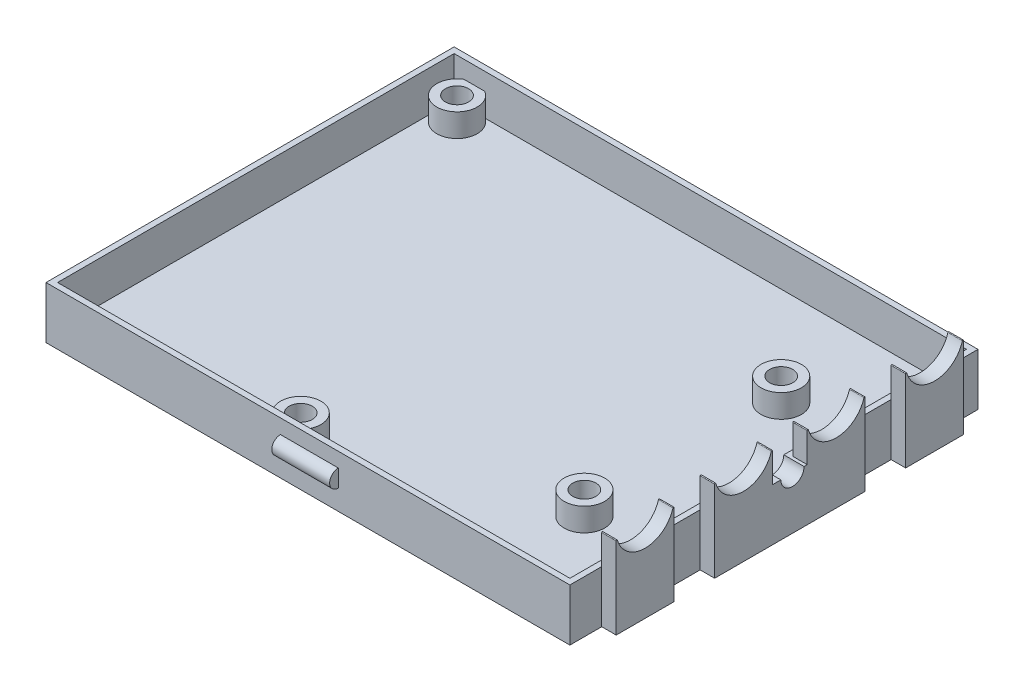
ISO-10303-21;
HEADER;
FILE_DESCRIPTION(('STEP AP214'),'2;1');
FILE_NAME('part.step','',(''),(''),'','','');
FILE_SCHEMA(('AUTOMOTIVE_DESIGN { 1 0 10303 214 1 1 1 1 }'));
ENDSEC;
DATA;
#1=APPLICATION_CONTEXT('core data for automotive mechanical design processes');
#2=APPLICATION_PROTOCOL_DEFINITION('international standard','automotive_design',2000,#1);
#3=PRODUCT_CONTEXT('',#1,'mechanical');
#4=PRODUCT('Part','Part','',(#3));
#5=PRODUCT_RELATED_PRODUCT_CATEGORY('part','',(#4));
#6=PRODUCT_DEFINITION_FORMATION('','',#4);
#7=PRODUCT_DEFINITION_CONTEXT('part definition',#1,'design');
#8=PRODUCT_DEFINITION('design','',#6,#7);
#9=PRODUCT_DEFINITION_SHAPE('','',#8);
#10=(LENGTH_UNIT() NAMED_UNIT(*) SI_UNIT(.MILLI.,.METRE.));
#11=(NAMED_UNIT(*) PLANE_ANGLE_UNIT() SI_UNIT($,.RADIAN.));
#12=(NAMED_UNIT(*) SI_UNIT($,.STERADIAN.) SOLID_ANGLE_UNIT());
#13=UNCERTAINTY_MEASURE_WITH_UNIT(LENGTH_MEASURE(1.E-05),#10,'distance_accuracy_value','');
#14=(GEOMETRIC_REPRESENTATION_CONTEXT(3) GLOBAL_UNCERTAINTY_ASSIGNED_CONTEXT((#13)) GLOBAL_UNIT_ASSIGNED_CONTEXT((#10,
#11,#12)) REPRESENTATION_CONTEXT('',''));
#15=CARTESIAN_POINT('',(0.,0.,0.));
#16=DIRECTION('',(0.,0.,1.));
#17=DIRECTION('',(1.,0.,0.));
#18=AXIS2_PLACEMENT_3D('',#15,#16,#17);
#19=CARTESIAN_POINT('',(-45.25,2.,-35.25));
#20=DIRECTION('',(0.,0.,1.));
#21=DIRECTION('',(1.,0.,0.));
#22=AXIS2_PLACEMENT_3D('',#19,#20,#21);
#23=PLANE('',#22);
#24=DIRECTION('',(-1.,0.,0.));
#25=VECTOR('',#24,1.);
#26=CARTESIAN_POINT('',(-45.25,0.,-35.25));
#27=LINE('',#26,#25);
#28=CARTESIAN_POINT('',(45.25,0.,-35.25));
#29=VERTEX_POINT('',#28);
#30=CARTESIAN_POINT('',(-45.25,0.,-35.25));
#31=VERTEX_POINT('',#30);
#32=EDGE_CURVE('E780',#29,#31,#27,.T.);
#33=ORIENTED_EDGE('',*,*,#32,.T.);
#34=DIRECTION('',(0.,-1.,0.));
#35=VECTOR('',#34,1.);
#36=CARTESIAN_POINT('',(-45.25,2.,-35.25));
#37=LINE('',#36,#35);
#38=CARTESIAN_POINT('',(-45.25,9.,-35.25));
#39=VERTEX_POINT('',#38);
#40=EDGE_CURVE('E793',#39,#31,#37,.T.);
#41=ORIENTED_EDGE('',*,*,#40,.F.);
#42=DIRECTION('',(-1.,0.,0.));
#43=VECTOR('',#42,1.);
#44=CARTESIAN_POINT('',(45.25,9.,-35.25));
#45=LINE('',#44,#43);
#46=CARTESIAN_POINT('',(45.25,9.,-35.25));
#47=VERTEX_POINT('',#46);
#48=EDGE_CURVE('E725',#47,#39,#45,.T.);
#49=ORIENTED_EDGE('',*,*,#48,.F.);
#50=DIRECTION('',(0.,-1.,0.));
#51=VECTOR('',#50,1.);
#52=CARTESIAN_POINT('',(45.25,2.,-35.25));
#53=LINE('',#52,#51);
#54=EDGE_CURVE('E796',#47,#29,#53,.T.);
#55=ORIENTED_EDGE('',*,*,#54,.T.);
#56=EDGE_LOOP('',(#33,#41,#49,#55));
#57=FACE_BOUND('',#56,.T.);
#58=DIRECTION('',(0.,-1.,0.));
#59=VECTOR('',#58,1.);
#60=CARTESIAN_POINT('',(5.24999999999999,6.5,-35.25));
#61=LINE('',#60,#59);
#62=CARTESIAN_POINT('',(5.24999999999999,6.5,-35.25));
#63=VERTEX_POINT('',#62);
#64=CARTESIAN_POINT('',(5.24999999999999,3.5,-35.25));
#65=VERTEX_POINT('',#64);
#66=EDGE_CURVE('E544',#63,#65,#61,.T.);
#67=ORIENTED_EDGE('',*,*,#66,.F.);
#68=DIRECTION('',(-1.,0.,0.));
#69=VECTOR('',#68,1.);
#70=CARTESIAN_POINT('',(5.24999999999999,6.5,-35.25));
#71=LINE('',#70,#69);
#72=CARTESIAN_POINT('',(-4.75000000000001,6.5,-35.25));
#73=VERTEX_POINT('',#72);
#74=EDGE_CURVE('E525',#63,#73,#71,.T.);
#75=ORIENTED_EDGE('',*,*,#74,.T.);
#76=DIRECTION('',(0.,-1.,0.));
#77=VECTOR('',#76,1.);
#78=CARTESIAN_POINT('',(-4.75000000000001,6.5,-35.25));
#79=LINE('',#78,#77);
#80=CARTESIAN_POINT('',(-4.75000000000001,3.5,-35.25));
#81=VERTEX_POINT('',#80);
#82=EDGE_CURVE('E545',#73,#81,#79,.T.);
#83=ORIENTED_EDGE('',*,*,#82,.T.);
#84=DIRECTION('',(-1.,0.,0.));
#85=VECTOR('',#84,1.);
#86=CARTESIAN_POINT('',(5.24999999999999,3.5,-35.25));
#87=LINE('',#86,#85);
#88=EDGE_CURVE('E541',#65,#81,#87,.T.);
#89=ORIENTED_EDGE('',*,*,#88,.F.);
#90=EDGE_LOOP('',(#67,#75,#83,#89));
#91=FACE_BOUND('',#90,.T.);
#92=ADVANCED_FACE('F225',(#57,#91),#23,.F.);
#93=CARTESIAN_POINT('',(45.25,2.,-35.25));
#94=DIRECTION('',(-1.,0.,0.));
#95=DIRECTION('',(0.,0.,1.));
#96=AXIS2_PLACEMENT_3D('',#93,#94,#95);
#97=PLANE('',#96);
#98=DIRECTION('',(0.,-1.,0.));
#99=VECTOR('',#98,1.);
#100=CARTESIAN_POINT('',(45.25,15.5,-20.25));
#101=LINE('',#100,#99);
#102=CARTESIAN_POINT('',(45.25,9.,-20.25));
#103=VERTEX_POINT('',#102);
#104=CARTESIAN_POINT('',(45.25,0.,-20.25));
#105=VERTEX_POINT('',#104);
#106=EDGE_CURVE('E581',#103,#105,#101,.T.);
#107=ORIENTED_EDGE('',*,*,#106,.F.);
#108=DIRECTION('',(0.,0.,-1.));
#109=VECTOR('',#108,1.);
#110=CARTESIAN_POINT('',(45.25,9.,35.25));
#111=LINE('',#110,#109);
#112=CARTESIAN_POINT('',(45.25,9.,-13.25));
#113=VERTEX_POINT('',#112);
#114=EDGE_CURVE('E1219',#113,#103,#111,.T.);
#115=ORIENTED_EDGE('',*,*,#114,.F.);
#116=DIRECTION('',(0.,1.,0.));
#117=VECTOR('',#116,1.);
#118=CARTESIAN_POINT('',(45.25,0.,-13.25));
#119=LINE('',#118,#117);
#120=CARTESIAN_POINT('',(45.25,0.,-13.25));
#121=VERTEX_POINT('',#120);
#122=EDGE_CURVE('E621',#121,#113,#119,.T.);
#123=ORIENTED_EDGE('',*,*,#122,.F.);
#124=DIRECTION('',(0.,0.,-1.));
#125=VECTOR('',#124,1.);
#126=CARTESIAN_POINT('',(45.25,0.,-35.25));
#127=LINE('',#126,#125);
#128=EDGE_CURVE('E1210',#121,#105,#127,.T.);
#129=ORIENTED_EDGE('',*,*,#128,.T.);
#130=EDGE_LOOP('',(#107,#115,#123,#129));
#131=FACE_BOUND('',#130,.T.);
#132=ADVANCED_FACE('F1134',(#131),#97,.F.);
#133=DIRECTION('',(0.,1.,0.));
#134=VECTOR('',#133,1.);
#135=CARTESIAN_POINT('',(45.25,0.,-30.25));
#136=LINE('',#135,#134);
#137=CARTESIAN_POINT('',(45.25,0.,-30.25));
#138=VERTEX_POINT('',#137);
#139=CARTESIAN_POINT('',(45.25,9.,-30.25));
#140=VERTEX_POINT('',#139);
#141=EDGE_CURVE('E578',#138,#140,#136,.T.);
#142=ORIENTED_EDGE('',*,*,#141,.F.);
#143=EDGE_CURVE('E775',#138,#29,#127,.T.);
#144=ORIENTED_EDGE('',*,*,#143,.T.);
#145=ORIENTED_EDGE('',*,*,#54,.F.);
#146=EDGE_CURVE('E734',#140,#47,#111,.T.);
#147=ORIENTED_EDGE('',*,*,#146,.F.);
#148=EDGE_LOOP('',(#142,#144,#145,#147));
#149=FACE_BOUND('',#148,.T.);
#150=ADVANCED_FACE('F1139',(#149),#97,.F.);
#151=DIRECTION('',(0.,-1.,0.));
#152=VECTOR('',#151,1.);
#153=CARTESIAN_POINT('',(45.25,15.5,12.75));
#154=LINE('',#153,#152);
#155=CARTESIAN_POINT('',(45.25,9.,12.75));
#156=VERTEX_POINT('',#155);
#157=CARTESIAN_POINT('',(45.25,0.,12.75));
#158=VERTEX_POINT('',#157);
#159=EDGE_CURVE('E624',#156,#158,#154,.T.);
#160=ORIENTED_EDGE('',*,*,#159,.F.);
#161=CARTESIAN_POINT('',(45.25,9.,19.75));
#162=VERTEX_POINT('',#161);
#163=EDGE_CURVE('E1217',#162,#156,#111,.T.);
#164=ORIENTED_EDGE('',*,*,#163,.F.);
#165=DIRECTION('',(0.,1.,0.));
#166=VECTOR('',#165,1.);
#167=CARTESIAN_POINT('',(45.25,0.,19.75));
#168=LINE('',#167,#166);
#169=CARTESIAN_POINT('',(45.25,0.,19.75));
#170=VERTEX_POINT('',#169);
#171=EDGE_CURVE('E662',#170,#162,#168,.T.);
#172=ORIENTED_EDGE('',*,*,#171,.F.);
#173=EDGE_CURVE('E781',#170,#158,#127,.T.);
#174=ORIENTED_EDGE('',*,*,#173,.T.);
#175=EDGE_LOOP('',(#160,#164,#172,#174));
#176=FACE_BOUND('',#175,.T.);
#177=ADVANCED_FACE('F1136',(#176),#97,.F.);
#178=DIRECTION('',(0.,-1.,0.));
#179=VECTOR('',#178,1.);
#180=CARTESIAN_POINT('',(45.25,15.5,29.75));
#181=LINE('',#180,#179);
#182=CARTESIAN_POINT('',(45.25,9.,29.75));
#183=VERTEX_POINT('',#182);
#184=CARTESIAN_POINT('',(45.25,0.,29.75));
#185=VERTEX_POINT('',#184);
#186=EDGE_CURVE('E676',#183,#185,#181,.T.);
#187=ORIENTED_EDGE('',*,*,#186,.F.);
#188=CARTESIAN_POINT('',(45.25,9.,35.25));
#189=VERTEX_POINT('',#188);
#190=EDGE_CURVE('E735',#189,#183,#111,.T.);
#191=ORIENTED_EDGE('',*,*,#190,.F.);
#192=DIRECTION('',(0.,-1.,0.));
#193=VECTOR('',#192,1.);
#194=CARTESIAN_POINT('',(45.25,2.,35.25));
#195=LINE('',#194,#193);
#196=CARTESIAN_POINT('',(45.25,0.,35.25));
#197=VERTEX_POINT('',#196);
#198=EDGE_CURVE('E787',#189,#197,#195,.T.);
#199=ORIENTED_EDGE('',*,*,#198,.T.);
#200=EDGE_CURVE('E778',#197,#185,#127,.T.);
#201=ORIENTED_EDGE('',*,*,#200,.T.);
#202=EDGE_LOOP('',(#187,#191,#199,#201));
#203=FACE_BOUND('',#202,.T.);
#204=ADVANCED_FACE('F1121',(#203),#97,.F.);
#205=CARTESIAN_POINT('',(0.,2.,0.));
#206=DIRECTION('',(0.,1.,0.));
#207=DIRECTION('',(0.,0.,1.));
#208=AXIS2_PLACEMENT_3D('',#205,#206,#207);
#209=PLANE('',#208);
#210=DIRECTION('',(-1.,0.,0.));
#211=VECTOR('',#210,1.);
#212=CARTESIAN_POINT('',(-44.25,2.,-34.2499999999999));
#213=LINE('',#212,#211);
#214=CARTESIAN_POINT('',(-42.5430490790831,2.,-34.2499999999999));
#215=VERTEX_POINT('',#214);
#216=CARTESIAN_POINT('',(-44.25,2.,-34.2499999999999));
#217=VERTEX_POINT('',#216);
#218=EDGE_CURVE('E690',#215,#217,#213,.T.);
#219=ORIENTED_EDGE('',*,*,#218,.T.);
#220=DIRECTION('',(0.,0.,1.));
#221=VECTOR('',#220,1.);
#222=CARTESIAN_POINT('',(-44.25,2.,-34.2499999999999));
#223=LINE('',#222,#221);
#224=CARTESIAN_POINT('',(-44.25,2.,34.25));
#225=VERTEX_POINT('',#224);
#226=EDGE_CURVE('E708',#217,#225,#223,.T.);
#227=ORIENTED_EDGE('',*,*,#226,.T.);
#228=DIRECTION('',(1.,0.,0.));
#229=VECTOR('',#228,1.);
#230=CARTESIAN_POINT('',(-44.25,2.,34.25));
#231=LINE('',#230,#229);
#232=CARTESIAN_POINT('',(44.25,2.,34.25));
#233=VERTEX_POINT('',#232);
#234=EDGE_CURVE('E711',#225,#233,#231,.T.);
#235=ORIENTED_EDGE('',*,*,#234,.T.);
#236=DIRECTION('',(0.,0.,-1.));
#237=VECTOR('',#236,1.);
#238=CARTESIAN_POINT('',(44.25,2.,34.25));
#239=LINE('',#238,#237);
#240=CARTESIAN_POINT('',(44.25,2.,-34.25));
#241=VERTEX_POINT('',#240);
#242=EDGE_CURVE('E695',#233,#241,#239,.T.);
#243=ORIENTED_EDGE('',*,*,#242,.T.);
#244=CARTESIAN_POINT('',(-38.9569509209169,2.,-34.2499999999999));
#245=VERTEX_POINT('',#244);
#246=EDGE_CURVE('E705',#241,#245,#213,.T.);
#247=ORIENTED_EDGE('',*,*,#246,.T.);
#248=CARTESIAN_POINT('',(-40.75,2.,-31.25));
#249=DIRECTION('',(0.,1.,0.));
#250=DIRECTION('',(0.,0.,1.));
#251=AXIS2_PLACEMENT_3D('',#248,#249,#250);
#252=CIRCLE('',#251,3.495);
#253=EDGE_CURVE('E760',#215,#245,#252,.T.);
#254=ORIENTED_EDGE('',*,*,#253,.F.);
#255=EDGE_LOOP('',(#219,#227,#235,#243,#247,#254));
#256=FACE_BOUND('',#255,.T.);
#257=CARTESIAN_POINT('',(-6.75000000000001,2.,29.75));
#258=DIRECTION('',(0.,1.,0.));
#259=DIRECTION('',(0.,0.,1.));
#260=AXIS2_PLACEMENT_3D('',#257,#258,#259);
#261=CIRCLE('',#260,3.495);
#262=CARTESIAN_POINT('',(-6.75000000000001,2.,33.245));
#263=VERTEX_POINT('',#262);
#264=EDGE_CURVE('E742',#263,#263,#261,.T.);
#265=ORIENTED_EDGE('',*,*,#264,.F.);
#266=EDGE_LOOP('',(#265));
#267=FACE_BOUND('',#266,.T.);
#268=CARTESIAN_POINT('',(29.25,2.,16.75));
#269=DIRECTION('',(0.,1.,0.));
#270=DIRECTION('',(0.,0.,1.));
#271=AXIS2_PLACEMENT_3D('',#268,#269,#270);
#272=CIRCLE('',#271,3.49499999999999);
#273=CARTESIAN_POINT('',(29.25,2.,20.245));
#274=VERTEX_POINT('',#273);
#275=EDGE_CURVE('E751',#274,#274,#272,.T.);
#276=ORIENTED_EDGE('',*,*,#275,.F.);
#277=EDGE_LOOP('',(#276));
#278=FACE_BOUND('',#277,.T.);
#279=CARTESIAN_POINT('',(29.25,2.,-17.25));
#280=DIRECTION('',(0.,1.,0.));
#281=DIRECTION('',(0.,0.,1.));
#282=AXIS2_PLACEMENT_3D('',#279,#280,#281);
#283=CIRCLE('',#282,3.495);
#284=CARTESIAN_POINT('',(29.25,2.,-13.755));
#285=VERTEX_POINT('',#284);
#286=EDGE_CURVE('E771',#285,#285,#283,.T.);
#287=ORIENTED_EDGE('',*,*,#286,.F.);
#288=EDGE_LOOP('',(#287));
#289=FACE_BOUND('',#288,.T.);
#290=ADVANCED_FACE('F1114',(#256,#267,#278,#289),#209,.T.);
#291=CARTESIAN_POINT('',(29.25,6.,-17.25));
#292=DIRECTION('',(0.,1.,0.));
#293=DIRECTION('',(0.,0.,1.));
#294=AXIS2_PLACEMENT_3D('',#291,#292,#293);
#295=PLANE('',#294);
#296=CARTESIAN_POINT('',(29.25,6.,-17.25));
#297=DIRECTION('',(0.,1.,0.));
#298=DIRECTION('',(0.,0.,1.));
#299=AXIS2_PLACEMENT_3D('',#296,#297,#298);
#300=CIRCLE('',#299,3.495);
#301=CARTESIAN_POINT('',(29.25,6.,-13.755));
#302=VERTEX_POINT('',#301);
#303=EDGE_CURVE('E772',#302,#302,#300,.T.);
#304=ORIENTED_EDGE('',*,*,#303,.T.);
#305=EDGE_LOOP('',(#304));
#306=FACE_BOUND('',#305,.T.);
#307=CARTESIAN_POINT('',(29.25,6.,-17.25));
#308=DIRECTION('',(0.,1.,0.));
#309=DIRECTION('',(0.,0.,1.));
#310=AXIS2_PLACEMENT_3D('',#307,#308,#309);
#311=CIRCLE('',#310,2.);
#312=CARTESIAN_POINT('',(29.25,6.,-15.25));
#313=VERTEX_POINT('',#312);
#314=EDGE_CURVE('E768',#313,#313,#311,.T.);
#315=ORIENTED_EDGE('',*,*,#314,.F.);
#316=EDGE_LOOP('',(#315));
#317=FACE_BOUND('',#316,.T.);
#318=ADVANCED_FACE('F1111',(#306,#317),#295,.T.);
#319=CARTESIAN_POINT('',(29.25,6.,-17.25));
#320=DIRECTION('',(0.,-1.,0.));
#321=DIRECTION('',(0.,0.,-1.));
#322=AXIS2_PLACEMENT_3D('',#319,#320,#321);
#323=CYLINDRICAL_SURFACE('',#322,3.495);
#324=ORIENTED_EDGE('',*,*,#303,.F.);
#325=EDGE_LOOP('',(#324));
#326=FACE_BOUND('',#325,.T.);
#327=ORIENTED_EDGE('',*,*,#286,.T.);
#328=EDGE_LOOP('',(#327));
#329=FACE_BOUND('',#328,.T.);
#330=ADVANCED_FACE('F1109',(#326,#329),#323,.T.);
#331=CARTESIAN_POINT('',(29.25,6.,-17.25));
#332=DIRECTION('',(0.,-1.,0.));
#333=DIRECTION('',(0.,0.,-1.));
#334=AXIS2_PLACEMENT_3D('',#331,#332,#333);
#335=CYLINDRICAL_SURFACE('',#334,2.);
#336=ORIENTED_EDGE('',*,*,#314,.T.);
#337=EDGE_LOOP('',(#336));
#338=FACE_BOUND('',#337,.T.);
#339=CARTESIAN_POINT('',(29.25,2.,-17.25));
#340=DIRECTION('',(0.,1.,0.));
#341=DIRECTION('',(0.,0.,1.));
#342=AXIS2_PLACEMENT_3D('',#339,#340,#341);
#343=CIRCLE('',#342,2.);
#344=CARTESIAN_POINT('',(29.25,2.,-15.25));
#345=VERTEX_POINT('',#344);
#346=EDGE_CURVE('E799',#345,#345,#343,.F.);
#347=ORIENTED_EDGE('',*,*,#346,.T.);
#348=EDGE_LOOP('',(#347));
#349=FACE_BOUND('',#348,.T.);
#350=ADVANCED_FACE('F1106',(#338,#349),#335,.F.);
#351=ORIENTED_EDGE('',*,*,#346,.F.);
#352=EDGE_LOOP('',(#351));
#353=FACE_BOUND('',#352,.T.);
#354=ADVANCED_FACE('F1101',(#353),#209,.T.);
#355=CARTESIAN_POINT('',(-40.75,6.,-31.25));
#356=DIRECTION('',(0.,1.,0.));
#357=DIRECTION('',(0.,0.,1.));
#358=AXIS2_PLACEMENT_3D('',#355,#356,#357);
#359=PLANE('',#358);
#360=DIRECTION('',(1.,0.,0.));
#361=VECTOR('',#360,1.);
#362=CARTESIAN_POINT('',(-40.75,6.,-34.2499999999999));
#363=LINE('',#362,#361);
#364=CARTESIAN_POINT('',(-42.5430490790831,6.,-34.2499999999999));
#365=VERTEX_POINT('',#364);
#366=CARTESIAN_POINT('',(-38.9569509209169,6.,-34.2499999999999));
#367=VERTEX_POINT('',#366);
#368=EDGE_CURVE('E738',#365,#367,#363,.T.);
#369=ORIENTED_EDGE('',*,*,#368,.F.);
#370=CARTESIAN_POINT('',(-40.75,6.,-31.25));
#371=DIRECTION('',(0.,1.,0.));
#372=DIRECTION('',(0.,0.,1.));
#373=AXIS2_PLACEMENT_3D('',#370,#371,#372);
#374=CIRCLE('',#373,3.495);
#375=EDGE_CURVE('E759',#365,#367,#374,.T.);
#376=ORIENTED_EDGE('',*,*,#375,.T.);
#377=EDGE_LOOP('',(#369,#376));
#378=FACE_BOUND('',#377,.T.);
#379=CARTESIAN_POINT('',(-40.75,6.,-31.25));
#380=DIRECTION('',(0.,1.,0.));
#381=DIRECTION('',(0.,0.,1.));
#382=AXIS2_PLACEMENT_3D('',#379,#380,#381);
#383=CIRCLE('',#382,2.);
#384=CARTESIAN_POINT('',(-40.75,6.,-29.25));
#385=VERTEX_POINT('',#384);
#386=EDGE_CURVE('E763',#385,#385,#383,.T.);
#387=ORIENTED_EDGE('',*,*,#386,.F.);
#388=EDGE_LOOP('',(#387));
#389=FACE_BOUND('',#388,.T.);
#390=ADVANCED_FACE('F1097',(#378,#389),#359,.T.);
#391=CARTESIAN_POINT('',(-40.75,6.,-31.25));
#392=DIRECTION('',(0.,-1.,0.));
#393=DIRECTION('',(0.,0.,-1.));
#394=AXIS2_PLACEMENT_3D('',#391,#392,#393);
#395=CYLINDRICAL_SURFACE('',#394,3.495);
#396=ORIENTED_EDGE('',*,*,#375,.F.);
#397=DIRECTION('',(0.,-1.,0.));
#398=VECTOR('',#397,1.);
#399=CARTESIAN_POINT('',(-42.5430490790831,6.,-34.2499999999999));
#400=LINE('',#399,#398);
#401=EDGE_CURVE('E814',#365,#215,#400,.T.);
#402=ORIENTED_EDGE('',*,*,#401,.T.);
#403=ORIENTED_EDGE('',*,*,#253,.T.);
#404=DIRECTION('',(0.,-1.,0.));
#405=VECTOR('',#404,1.);
#406=CARTESIAN_POINT('',(-38.9569509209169,6.,-34.2499999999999));
#407=LINE('',#406,#405);
#408=EDGE_CURVE('E811',#245,#367,#407,.F.);
#409=ORIENTED_EDGE('',*,*,#408,.T.);
#410=EDGE_LOOP('',(#396,#402,#403,#409));
#411=FACE_BOUND('',#410,.T.);
#412=ADVANCED_FACE('F1093',(#411),#395,.T.);
#413=CARTESIAN_POINT('',(-40.75,6.,-31.25));
#414=DIRECTION('',(0.,-1.,0.));
#415=DIRECTION('',(0.,0.,-1.));
#416=AXIS2_PLACEMENT_3D('',#413,#414,#415);
#417=CYLINDRICAL_SURFACE('',#416,2.);
#418=ORIENTED_EDGE('',*,*,#386,.T.);
#419=EDGE_LOOP('',(#418));
#420=FACE_BOUND('',#419,.T.);
#421=CARTESIAN_POINT('',(-40.75,2.,-31.25));
#422=DIRECTION('',(0.,1.,0.));
#423=DIRECTION('',(0.,0.,1.));
#424=AXIS2_PLACEMENT_3D('',#421,#422,#423);
#425=CIRCLE('',#424,2.);
#426=CARTESIAN_POINT('',(-40.75,2.,-29.25));
#427=VERTEX_POINT('',#426);
#428=EDGE_CURVE('E802',#427,#427,#425,.F.);
#429=ORIENTED_EDGE('',*,*,#428,.T.);
#430=EDGE_LOOP('',(#429));
#431=FACE_BOUND('',#430,.T.);
#432=ADVANCED_FACE('F1096',(#420,#431),#417,.F.);
#433=ORIENTED_EDGE('',*,*,#428,.F.);
#434=EDGE_LOOP('',(#433));
#435=FACE_BOUND('',#434,.T.);
#436=ADVANCED_FACE('F1088',(#435),#209,.T.);
#437=CARTESIAN_POINT('',(29.25,6.,16.75));
#438=DIRECTION('',(0.,1.,0.));
#439=DIRECTION('',(0.,0.,1.));
#440=AXIS2_PLACEMENT_3D('',#437,#438,#439);
#441=PLANE('',#440);
#442=CARTESIAN_POINT('',(29.25,6.,16.75));
#443=DIRECTION('',(0.,1.,0.));
#444=DIRECTION('',(0.,0.,1.));
#445=AXIS2_PLACEMENT_3D('',#442,#443,#444);
#446=CIRCLE('',#445,3.49499999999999);
#447=CARTESIAN_POINT('',(29.25,6.,20.245));
#448=VERTEX_POINT('',#447);
#449=EDGE_CURVE('E750',#448,#448,#446,.T.);
#450=ORIENTED_EDGE('',*,*,#449,.T.);
#451=EDGE_LOOP('',(#450));
#452=FACE_BOUND('',#451,.T.);
#453=CARTESIAN_POINT('',(29.25,6.,16.75));
#454=DIRECTION('',(0.,1.,0.));
#455=DIRECTION('',(0.,0.,1.));
#456=AXIS2_PLACEMENT_3D('',#453,#454,#455);
#457=CIRCLE('',#456,2.);
#458=CARTESIAN_POINT('',(29.25,6.,18.75));
#459=VERTEX_POINT('',#458);
#460=EDGE_CURVE('E754',#459,#459,#457,.T.);
#461=ORIENTED_EDGE('',*,*,#460,.F.);
#462=EDGE_LOOP('',(#461));
#463=FACE_BOUND('',#462,.T.);
#464=ADVANCED_FACE('F1084',(#452,#463),#441,.T.);
#465=CARTESIAN_POINT('',(29.25,6.,16.75));
#466=DIRECTION('',(0.,-1.,0.));
#467=DIRECTION('',(0.,0.,-1.));
#468=AXIS2_PLACEMENT_3D('',#465,#466,#467);
#469=CYLINDRICAL_SURFACE('',#468,3.49499999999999);
#470=ORIENTED_EDGE('',*,*,#449,.F.);
#471=EDGE_LOOP('',(#470));
#472=FACE_BOUND('',#471,.T.);
#473=ORIENTED_EDGE('',*,*,#275,.T.);
#474=EDGE_LOOP('',(#473));
#475=FACE_BOUND('',#474,.T.);
#476=ADVANCED_FACE('F1080',(#472,#475),#469,.T.);
#477=CARTESIAN_POINT('',(29.25,6.,16.75));
#478=DIRECTION('',(0.,-1.,0.));
#479=DIRECTION('',(0.,0.,-1.));
#480=AXIS2_PLACEMENT_3D('',#477,#478,#479);
#481=CYLINDRICAL_SURFACE('',#480,2.);
#482=ORIENTED_EDGE('',*,*,#460,.T.);
#483=EDGE_LOOP('',(#482));
#484=FACE_BOUND('',#483,.T.);
#485=CARTESIAN_POINT('',(29.25,2.,16.75));
#486=DIRECTION('',(0.,1.,0.));
#487=DIRECTION('',(0.,0.,1.));
#488=AXIS2_PLACEMENT_3D('',#485,#486,#487);
#489=CIRCLE('',#488,2.);
#490=CARTESIAN_POINT('',(29.25,2.,18.75));
#491=VERTEX_POINT('',#490);
#492=EDGE_CURVE('E805',#491,#491,#489,.F.);
#493=ORIENTED_EDGE('',*,*,#492,.T.);
#494=EDGE_LOOP('',(#493));
#495=FACE_BOUND('',#494,.T.);
#496=ADVANCED_FACE('F1083',(#484,#495),#481,.F.);
#497=ORIENTED_EDGE('',*,*,#492,.F.);
#498=EDGE_LOOP('',(#497));
#499=FACE_BOUND('',#498,.T.);
#500=ADVANCED_FACE('F1075',(#499),#209,.T.);
#501=CARTESIAN_POINT('',(-6.75000000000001,6.,29.75));
#502=DIRECTION('',(0.,1.,0.));
#503=DIRECTION('',(0.,0.,1.));
#504=AXIS2_PLACEMENT_3D('',#501,#502,#503);
#505=PLANE('',#504);
#506=CARTESIAN_POINT('',(-6.75000000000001,6.,29.75));
#507=DIRECTION('',(0.,1.,0.));
#508=DIRECTION('',(0.,0.,1.));
#509=AXIS2_PLACEMENT_3D('',#506,#507,#508);
#510=CIRCLE('',#509,3.495);
#511=CARTESIAN_POINT('',(-6.75000000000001,6.,33.245));
#512=VERTEX_POINT('',#511);
#513=EDGE_CURVE('E741',#512,#512,#510,.T.);
#514=ORIENTED_EDGE('',*,*,#513,.T.);
#515=EDGE_LOOP('',(#514));
#516=FACE_BOUND('',#515,.T.);
#517=CARTESIAN_POINT('',(-6.75000000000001,6.,29.75));
#518=DIRECTION('',(0.,1.,0.));
#519=DIRECTION('',(0.,0.,1.));
#520=AXIS2_PLACEMENT_3D('',#517,#518,#519);
#521=CIRCLE('',#520,2.);
#522=CARTESIAN_POINT('',(-6.75000000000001,6.,31.75));
#523=VERTEX_POINT('',#522);
#524=EDGE_CURVE('E745',#523,#523,#521,.T.);
#525=ORIENTED_EDGE('',*,*,#524,.F.);
#526=EDGE_LOOP('',(#525));
#527=FACE_BOUND('',#526,.T.);
#528=ADVANCED_FACE('F1071',(#516,#527),#505,.T.);
#529=CARTESIAN_POINT('',(-6.75000000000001,6.,29.75));
#530=DIRECTION('',(0.,-1.,0.));
#531=DIRECTION('',(0.,0.,-1.));
#532=AXIS2_PLACEMENT_3D('',#529,#530,#531);
#533=CYLINDRICAL_SURFACE('',#532,3.495);
#534=ORIENTED_EDGE('',*,*,#513,.F.);
#535=EDGE_LOOP('',(#534));
#536=FACE_BOUND('',#535,.T.);
#537=ORIENTED_EDGE('',*,*,#264,.T.);
#538=EDGE_LOOP('',(#537));
#539=FACE_BOUND('',#538,.T.);
#540=ADVANCED_FACE('F1067',(#536,#539),#533,.T.);
#541=CARTESIAN_POINT('',(-6.75000000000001,6.,29.75));
#542=DIRECTION('',(0.,-1.,0.));
#543=DIRECTION('',(0.,0.,-1.));
#544=AXIS2_PLACEMENT_3D('',#541,#542,#543);
#545=CYLINDRICAL_SURFACE('',#544,2.);
#546=ORIENTED_EDGE('',*,*,#524,.T.);
#547=EDGE_LOOP('',(#546));
#548=FACE_BOUND('',#547,.T.);
#549=CARTESIAN_POINT('',(-6.75000000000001,2.,29.75));
#550=DIRECTION('',(0.,1.,0.));
#551=DIRECTION('',(0.,0.,1.));
#552=AXIS2_PLACEMENT_3D('',#549,#550,#551);
#553=CIRCLE('',#552,2.);
#554=CARTESIAN_POINT('',(-6.75000000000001,2.,31.75));
#555=VERTEX_POINT('',#554);
#556=EDGE_CURVE('E808',#555,#555,#553,.F.);
#557=ORIENTED_EDGE('',*,*,#556,.T.);
#558=EDGE_LOOP('',(#557));
#559=FACE_BOUND('',#558,.T.);
#560=ADVANCED_FACE('F1070',(#548,#559),#545,.F.);
#561=ORIENTED_EDGE('',*,*,#556,.F.);
#562=EDGE_LOOP('',(#561));
#563=FACE_BOUND('',#562,.T.);
#564=ADVANCED_FACE('F1062',(#563),#209,.T.);
#565=CARTESIAN_POINT('',(-44.25,9.,-34.2499999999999));
#566=DIRECTION('',(0.,0.,1.));
#567=DIRECTION('',(1.,0.,0.));
#568=AXIS2_PLACEMENT_3D('',#565,#566,#567);
#569=PLANE('',#568);
#570=ORIENTED_EDGE('',*,*,#401,.F.);
#571=ORIENTED_EDGE('',*,*,#368,.T.);
#572=ORIENTED_EDGE('',*,*,#408,.F.);
#573=ORIENTED_EDGE('',*,*,#246,.F.);
#574=DIRECTION('',(0.,-1.,0.));
#575=VECTOR('',#574,1.);
#576=CARTESIAN_POINT('',(44.25,9.,-34.25));
#577=LINE('',#576,#575);
#578=CARTESIAN_POINT('',(44.25,9.,-34.25));
#579=VERTEX_POINT('',#578);
#580=EDGE_CURVE('E704',#579,#241,#577,.T.);
#581=ORIENTED_EDGE('',*,*,#580,.F.);
#582=DIRECTION('',(-1.,0.,0.));
#583=VECTOR('',#582,1.);
#584=CARTESIAN_POINT('',(-44.25,9.,-34.2499999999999));
#585=LINE('',#584,#583);
#586=CARTESIAN_POINT('',(-44.25,9.,-34.2499999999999));
#587=VERTEX_POINT('',#586);
#588=EDGE_CURVE('E692',#579,#587,#585,.T.);
#589=ORIENTED_EDGE('',*,*,#588,.T.);
#590=DIRECTION('',(0.,-1.,0.));
#591=VECTOR('',#590,1.);
#592=CARTESIAN_POINT('',(-44.25,9.,-34.2499999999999));
#593=LINE('',#592,#591);
#594=EDGE_CURVE('E722',#587,#217,#593,.T.);
#595=ORIENTED_EDGE('',*,*,#594,.T.);
#596=ORIENTED_EDGE('',*,*,#218,.F.);
#597=EDGE_LOOP('',(#570,#571,#572,#573,#581,#589,#595,#596));
#598=FACE_BOUND('',#597,.T.);
#599=ADVANCED_FACE('F1059',(#598),#569,.T.);
#600=CARTESIAN_POINT('',(0.,9.,0.));
#601=DIRECTION('',(0.,1.,0.));
#602=DIRECTION('',(0.,0.,1.));
#603=AXIS2_PLACEMENT_3D('',#600,#601,#602);
#604=PLANE('',#603);
#605=DIRECTION('',(1.,0.,0.));
#606=VECTOR('',#605,1.);
#607=CARTESIAN_POINT('',(-45.251,9.,1.30000000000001));
#608=LINE('',#607,#606);
#609=CARTESIAN_POINT('',(44.25,9.,1.29999999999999));
#610=VERTEX_POINT('',#609);
#611=CARTESIAN_POINT('',(47.75,9.,1.29999999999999));
#612=VERTEX_POINT('',#611);
#613=EDGE_CURVE('E688',#610,#612,#608,.T.);
#614=ORIENTED_EDGE('',*,*,#613,.F.);
#615=DIRECTION('',(0.,0.,-1.));
#616=VECTOR('',#615,1.);
#617=CARTESIAN_POINT('',(44.25,9.,34.25));
#618=LINE('',#617,#616);
#619=CARTESIAN_POINT('',(44.25,9.,34.25));
#620=VERTEX_POINT('',#619);
#621=EDGE_CURVE('E701',#620,#610,#618,.T.);
#622=ORIENTED_EDGE('',*,*,#621,.F.);
#623=DIRECTION('',(1.,0.,0.));
#624=VECTOR('',#623,1.);
#625=CARTESIAN_POINT('',(-44.25,9.,34.25));
#626=LINE('',#625,#624);
#627=CARTESIAN_POINT('',(-44.25,9.,34.25));
#628=VERTEX_POINT('',#627);
#629=EDGE_CURVE('E697',#628,#620,#626,.T.);
#630=ORIENTED_EDGE('',*,*,#629,.F.);
#631=DIRECTION('',(0.,0.,1.));
#632=VECTOR('',#631,1.);
#633=CARTESIAN_POINT('',(-44.25,9.,-34.2499999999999));
#634=LINE('',#633,#632);
#635=EDGE_CURVE('E694',#587,#628,#634,.T.);
#636=ORIENTED_EDGE('',*,*,#635,.F.);
#637=ORIENTED_EDGE('',*,*,#588,.F.);
#638=CARTESIAN_POINT('',(44.25,9.,-2.70000000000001));
#639=VERTEX_POINT('',#638);
#640=EDGE_CURVE('E700',#639,#579,#618,.T.);
#641=ORIENTED_EDGE('',*,*,#640,.F.);
#642=DIRECTION('',(1.,0.,0.));
#643=VECTOR('',#642,1.);
#644=CARTESIAN_POINT('',(-45.251,9.,-2.69999999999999));
#645=LINE('',#644,#643);
#646=CARTESIAN_POINT('',(47.75,9.,-2.70000000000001));
#647=VERTEX_POINT('',#646);
#648=EDGE_CURVE('E687',#639,#647,#645,.T.);
#649=ORIENTED_EDGE('',*,*,#648,.T.);
#650=DIRECTION('',(0.,0.,1.));
#651=VECTOR('',#650,1.);
#652=CARTESIAN_POINT('',(47.75,9.,-3.25));
#653=LINE('',#652,#651);
#654=CARTESIAN_POINT('',(47.75,9.,-3.25));
#655=VERTEX_POINT('',#654);
#656=EDGE_CURVE('E638',#655,#647,#653,.T.);
#657=ORIENTED_EDGE('',*,*,#656,.F.);
#658=DIRECTION('',(-1.,0.,0.));
#659=VECTOR('',#658,1.);
#660=CARTESIAN_POINT('',(47.75,9.,-3.25));
#661=LINE('',#660,#659);
#662=CARTESIAN_POINT('',(45.25,9.,-3.25));
#663=VERTEX_POINT('',#662);
#664=EDGE_CURVE('E605',#655,#663,#661,.T.);
#665=ORIENTED_EDGE('',*,*,#664,.T.);
#666=DIRECTION('',(0.,0.,-1.));
#667=VECTOR('',#666,1.);
#668=CARTESIAN_POINT('',(45.25,9.,0.));
#669=LINE('',#668,#667);
#670=EDGE_CURVE('E630',#663,#113,#669,.T.);
#671=ORIENTED_EDGE('',*,*,#670,.T.);
#672=ORIENTED_EDGE('',*,*,#114,.T.);
#673=DIRECTION('',(0.,0.,-1.));
#674=VECTOR('',#673,1.);
#675=CARTESIAN_POINT('',(45.25,9.,0.));
#676=LINE('',#675,#674);
#677=EDGE_CURVE('E588',#103,#140,#676,.T.);
#678=ORIENTED_EDGE('',*,*,#677,.T.);
#679=ORIENTED_EDGE('',*,*,#146,.T.);
#680=ORIENTED_EDGE('',*,*,#48,.T.);
#681=DIRECTION('',(0.,0.,1.));
#682=VECTOR('',#681,1.);
#683=CARTESIAN_POINT('',(-45.25,9.,-35.25));
#684=LINE('',#683,#682);
#685=CARTESIAN_POINT('',(-45.25,9.,35.25));
#686=VERTEX_POINT('',#685);
#687=EDGE_CURVE('E728',#39,#686,#684,.T.);
#688=ORIENTED_EDGE('',*,*,#687,.T.);
#689=DIRECTION('',(1.,0.,0.));
#690=VECTOR('',#689,1.);
#691=CARTESIAN_POINT('',(-45.25,9.,35.25));
#692=LINE('',#691,#690);
#693=EDGE_CURVE('E731',#686,#189,#692,.T.);
#694=ORIENTED_EDGE('',*,*,#693,.T.);
#695=ORIENTED_EDGE('',*,*,#190,.T.);
#696=EDGE_CURVE('E739',#183,#162,#111,.T.);
#697=ORIENTED_EDGE('',*,*,#696,.T.);
#698=ORIENTED_EDGE('',*,*,#163,.T.);
#699=CARTESIAN_POINT('',(45.25,9.,2.74999999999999));
#700=VERTEX_POINT('',#699);
#701=EDGE_CURVE('E657',#156,#700,#669,.T.);
#702=ORIENTED_EDGE('',*,*,#701,.T.);
#703=DIRECTION('',(-1.,0.,0.));
#704=VECTOR('',#703,1.);
#705=CARTESIAN_POINT('',(47.75,9.,2.74999999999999));
#706=LINE('',#705,#704);
#707=CARTESIAN_POINT('',(47.75,9.,2.74999999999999));
#708=VERTEX_POINT('',#707);
#709=EDGE_CURVE('E608',#708,#700,#706,.T.);
#710=ORIENTED_EDGE('',*,*,#709,.F.);
#711=DIRECTION('',(0.,0.,1.));
#712=VECTOR('',#711,1.);
#713=CARTESIAN_POINT('',(47.75,9.,2.74999999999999));
#714=LINE('',#713,#712);
#715=EDGE_CURVE('E633',#612,#708,#714,.T.);
#716=ORIENTED_EDGE('',*,*,#715,.F.);
#717=EDGE_LOOP('',(#614,#622,#630,#636,#637,#641,#649,#657,#665,#671,#672,#678,#679,#680,#688,
#694,#695,#697,#698,#702,#710,#716));
#718=FACE_BOUND('',#717,.T.);
#719=ADVANCED_FACE('F1057',(#718),#604,.T.);
#720=CARTESIAN_POINT('',(-44.25,9.,-34.2499999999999));
#721=DIRECTION('',(1.,0.,0.));
#722=DIRECTION('',(0.,0.,-1.));
#723=AXIS2_PLACEMENT_3D('',#720,#721,#722);
#724=PLANE('',#723);
#725=ORIENTED_EDGE('',*,*,#226,.F.);
#726=ORIENTED_EDGE('',*,*,#594,.F.);
#727=ORIENTED_EDGE('',*,*,#635,.T.);
#728=DIRECTION('',(0.,-1.,0.));
#729=VECTOR('',#728,1.);
#730=CARTESIAN_POINT('',(-44.25,9.,34.25));
#731=LINE('',#730,#729);
#732=EDGE_CURVE('E720',#628,#225,#731,.T.);
#733=ORIENTED_EDGE('',*,*,#732,.T.);
#734=EDGE_LOOP('',(#725,#726,#727,#733));
#735=FACE_BOUND('',#734,.T.);
#736=ADVANCED_FACE('F1053',(#735),#724,.T.);
#737=CARTESIAN_POINT('',(-44.25,9.,34.25));
#738=DIRECTION('',(0.,0.,-1.));
#739=DIRECTION('',(-1.,0.,0.));
#740=AXIS2_PLACEMENT_3D('',#737,#738,#739);
#741=PLANE('',#740);
#742=ORIENTED_EDGE('',*,*,#234,.F.);
#743=ORIENTED_EDGE('',*,*,#732,.F.);
#744=ORIENTED_EDGE('',*,*,#629,.T.);
#745=DIRECTION('',(0.,-1.,0.));
#746=VECTOR('',#745,1.);
#747=CARTESIAN_POINT('',(44.25,9.,34.25));
#748=LINE('',#747,#746);
#749=EDGE_CURVE('E718',#620,#233,#748,.T.);
#750=ORIENTED_EDGE('',*,*,#749,.T.);
#751=EDGE_LOOP('',(#742,#743,#744,#750));
#752=FACE_BOUND('',#751,.T.);
#753=ADVANCED_FACE('F1049',(#752),#741,.T.);
#754=CARTESIAN_POINT('',(44.25,9.,34.25));
#755=DIRECTION('',(-1.,0.,0.));
#756=DIRECTION('',(0.,0.,1.));
#757=AXIS2_PLACEMENT_3D('',#754,#755,#756);
#758=PLANE('',#757);
#759=CARTESIAN_POINT('',(44.25,9.,-0.700000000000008));
#760=DIRECTION('',(-1.,0.,0.));
#761=DIRECTION('',(0.,0.,1.));
#762=AXIS2_PLACEMENT_3D('',#759,#760,#761);
#763=CIRCLE('',#762,2.);
#764=EDGE_CURVE('E684',#610,#639,#763,.F.);
#765=ORIENTED_EDGE('',*,*,#764,.T.);
#766=ORIENTED_EDGE('',*,*,#640,.T.);
#767=ORIENTED_EDGE('',*,*,#580,.T.);
#768=ORIENTED_EDGE('',*,*,#242,.F.);
#769=ORIENTED_EDGE('',*,*,#749,.F.);
#770=ORIENTED_EDGE('',*,*,#621,.T.);
#771=EDGE_LOOP('',(#765,#766,#767,#768,#769,#770));
#772=FACE_BOUND('',#771,.T.);
#773=ADVANCED_FACE('F1045',(#772),#758,.T.);
#774=CARTESIAN_POINT('',(0.,0.,0.));
#775=DIRECTION('',(0.,1.,0.));
#776=DIRECTION('',(0.,0.,1.));
#777=AXIS2_PLACEMENT_3D('',#774,#775,#776);
#778=PLANE('',#777);
#779=CARTESIAN_POINT('',(-40.25,0.,-30.25));
#780=DIRECTION('',(0.,1.,0.));
#781=DIRECTION('',(0.,0.,1.));
#782=AXIS2_PLACEMENT_3D('',#779,#780,#781);
#783=CIRCLE('',#782,2.5);
#784=CARTESIAN_POINT('',(-40.25,0.,-27.75));
#785=VERTEX_POINT('',#784);
#786=EDGE_CURVE('E13',#785,#785,#783,.F.);
#787=ORIENTED_EDGE('',*,*,#786,.F.);
#788=EDGE_LOOP('',(#787));
#789=FACE_BOUND('',#788,.T.);
#790=CARTESIAN_POINT('',(40.25,0.,-30.25));
#791=DIRECTION('',(0.,1.,0.));
#792=DIRECTION('',(0.,0.,1.));
#793=AXIS2_PLACEMENT_3D('',#790,#791,#792);
#794=CIRCLE('',#793,2.5);
#795=CARTESIAN_POINT('',(40.25,0.,-27.75));
#796=VERTEX_POINT('',#795);
#797=EDGE_CURVE('E241',#796,#796,#794,.F.);
#798=ORIENTED_EDGE('',*,*,#797,.F.);
#799=EDGE_LOOP('',(#798));
#800=FACE_BOUND('',#799,.T.);
#801=CARTESIAN_POINT('',(40.25,0.,30.25));
#802=DIRECTION('',(0.,1.,0.));
#803=DIRECTION('',(0.,0.,1.));
#804=AXIS2_PLACEMENT_3D('',#801,#802,#803);
#805=CIRCLE('',#804,2.5);
#806=CARTESIAN_POINT('',(40.25,0.,32.75));
#807=VERTEX_POINT('',#806);
#808=EDGE_CURVE('E892',#807,#807,#805,.F.);
#809=ORIENTED_EDGE('',*,*,#808,.F.);
#810=EDGE_LOOP('',(#809));
#811=FACE_BOUND('',#810,.T.);
#812=CARTESIAN_POINT('',(-40.25,0.,30.25));
#813=DIRECTION('',(0.,1.,0.));
#814=DIRECTION('',(0.,0.,1.));
#815=AXIS2_PLACEMENT_3D('',#812,#813,#814);
#816=CIRCLE('',#815,2.5);
#817=CARTESIAN_POINT('',(-40.25,0.,32.75));
#818=VERTEX_POINT('',#817);
#819=EDGE_CURVE('E889',#818,#818,#816,.F.);
#820=ORIENTED_EDGE('',*,*,#819,.F.);
#821=EDGE_LOOP('',(#820));
#822=FACE_BOUND('',#821,.T.);
#823=ORIENTED_EDGE('',*,*,#200,.F.);
#824=DIRECTION('',(1.,0.,0.));
#825=VECTOR('',#824,1.);
#826=CARTESIAN_POINT('',(-45.25,0.,35.25));
#827=LINE('',#826,#825);
#828=CARTESIAN_POINT('',(-45.25,0.,35.25));
#829=VERTEX_POINT('',#828);
#830=EDGE_CURVE('E785',#829,#197,#827,.T.);
#831=ORIENTED_EDGE('',*,*,#830,.F.);
#832=DIRECTION('',(0.,0.,1.));
#833=VECTOR('',#832,1.);
#834=CARTESIAN_POINT('',(-45.25,0.,-35.25));
#835=LINE('',#834,#833);
#836=EDGE_CURVE('E783',#31,#829,#835,.T.);
#837=ORIENTED_EDGE('',*,*,#836,.F.);
#838=ORIENTED_EDGE('',*,*,#32,.F.);
#839=ORIENTED_EDGE('',*,*,#143,.F.);
#840=DIRECTION('',(-1.,0.,0.));
#841=VECTOR('',#840,1.);
#842=CARTESIAN_POINT('',(47.75,0.,-30.25));
#843=LINE('',#842,#841);
#844=CARTESIAN_POINT('',(47.75,0.,-30.25));
#845=VERTEX_POINT('',#844);
#846=EDGE_CURVE('E574',#845,#138,#843,.T.);
#847=ORIENTED_EDGE('',*,*,#846,.F.);
#848=DIRECTION('',(0.,0.,-1.));
#849=VECTOR('',#848,1.);
#850=CARTESIAN_POINT('',(47.75,0.,-20.25));
#851=LINE('',#850,#849);
#852=CARTESIAN_POINT('',(47.75,0.,-20.25));
#853=VERTEX_POINT('',#852);
#854=EDGE_CURVE('E591',#853,#845,#851,.T.);
#855=ORIENTED_EDGE('',*,*,#854,.F.);
#856=DIRECTION('',(-1.,0.,0.));
#857=VECTOR('',#856,1.);
#858=CARTESIAN_POINT('',(47.75,0.,-20.25));
#859=LINE('',#858,#857);
#860=EDGE_CURVE('E571',#853,#105,#859,.T.);
#861=ORIENTED_EDGE('',*,*,#860,.T.);
#862=ORIENTED_EDGE('',*,*,#128,.F.);
#863=DIRECTION('',(-1.,0.,0.));
#864=VECTOR('',#863,1.);
#865=CARTESIAN_POINT('',(47.75,0.,-13.25));
#866=LINE('',#865,#864);
#867=CARTESIAN_POINT('',(47.75,0.,-13.25));
#868=VERTEX_POINT('',#867);
#869=EDGE_CURVE('E603',#868,#121,#866,.T.);
#870=ORIENTED_EDGE('',*,*,#869,.F.);
#871=DIRECTION('',(0.,0.,-1.));
#872=VECTOR('',#871,1.);
#873=CARTESIAN_POINT('',(47.75,0.,12.75));
#874=LINE('',#873,#872);
#875=CARTESIAN_POINT('',(47.75,0.,12.75));
#876=VERTEX_POINT('',#875);
#877=EDGE_CURVE('E649',#876,#868,#874,.T.);
#878=ORIENTED_EDGE('',*,*,#877,.F.);
#879=DIRECTION('',(-1.,0.,0.));
#880=VECTOR('',#879,1.);
#881=CARTESIAN_POINT('',(47.75,0.,12.75));
#882=LINE('',#881,#880);
#883=EDGE_CURVE('E600',#876,#158,#882,.T.);
#884=ORIENTED_EDGE('',*,*,#883,.T.);
#885=ORIENTED_EDGE('',*,*,#173,.F.);
#886=DIRECTION('',(-1.,0.,0.));
#887=VECTOR('',#886,1.);
#888=CARTESIAN_POINT('',(47.75,0.,19.75));
#889=LINE('',#888,#887);
#890=CARTESIAN_POINT('',(47.75,0.,19.75));
#891=VERTEX_POINT('',#890);
#892=EDGE_CURVE('E669',#891,#170,#889,.T.);
#893=ORIENTED_EDGE('',*,*,#892,.F.);
#894=DIRECTION('',(0.,0.,-1.));
#895=VECTOR('',#894,1.);
#896=CARTESIAN_POINT('',(47.75,0.,29.75));
#897=LINE('',#896,#895);
#898=CARTESIAN_POINT('',(47.75,0.,29.75));
#899=VERTEX_POINT('',#898);
#900=EDGE_CURVE('E664',#899,#891,#897,.T.);
#901=ORIENTED_EDGE('',*,*,#900,.F.);
#902=DIRECTION('',(-1.,0.,0.));
#903=VECTOR('',#902,1.);
#904=CARTESIAN_POINT('',(47.75,0.,29.75));
#905=LINE('',#904,#903);
#906=EDGE_CURVE('E681',#899,#185,#905,.T.);
#907=ORIENTED_EDGE('',*,*,#906,.T.);
#908=EDGE_LOOP('',(#823,#831,#837,#838,#839,#847,#855,#861,#862,#870,#878,#884,#885,#893,#901,#907));
#909=FACE_BOUND('',#908,.T.);
#910=ADVANCED_FACE('F1048',(#789,#800,#811,#822,#909),#778,.F.);
#911=CARTESIAN_POINT('',(-45.25,2.,35.25));
#912=DIRECTION('',(0.,0.,-1.));
#913=DIRECTION('',(-1.,0.,0.));
#914=AXIS2_PLACEMENT_3D('',#911,#912,#913);
#915=PLANE('',#914);
#916=DIRECTION('',(-1.,0.,0.));
#917=VECTOR('',#916,1.);
#918=CARTESIAN_POINT('',(5.25,6.5,35.25));
#919=LINE('',#918,#917);
#920=CARTESIAN_POINT('',(5.25,6.5,35.25));
#921=VERTEX_POINT('',#920);
#922=CARTESIAN_POINT('',(-4.75,6.5,35.25));
#923=VERTEX_POINT('',#922);
#924=EDGE_CURVE('E562',#921,#923,#919,.T.);
#925=ORIENTED_EDGE('',*,*,#924,.F.);
#926=DIRECTION('',(0.,1.,0.));
#927=VECTOR('',#926,1.);
#928=CARTESIAN_POINT('',(5.25,6.5,35.25));
#929=LINE('',#928,#927);
#930=CARTESIAN_POINT('',(5.25,3.5,35.25));
#931=VERTEX_POINT('',#930);
#932=EDGE_CURVE('E558',#931,#921,#929,.T.);
#933=ORIENTED_EDGE('',*,*,#932,.F.);
#934=DIRECTION('',(-1.,0.,0.));
#935=VECTOR('',#934,1.);
#936=CARTESIAN_POINT('',(5.25,3.5,35.25));
#937=LINE('',#936,#935);
#938=CARTESIAN_POINT('',(-4.75,3.5,35.25));
#939=VERTEX_POINT('',#938);
#940=EDGE_CURVE('E568',#931,#939,#937,.T.);
#941=ORIENTED_EDGE('',*,*,#940,.T.);
#942=DIRECTION('',(0.,1.,0.));
#943=VECTOR('',#942,1.);
#944=CARTESIAN_POINT('',(-4.75,6.5,35.25));
#945=LINE('',#944,#943);
#946=EDGE_CURVE('E559',#939,#923,#945,.T.);
#947=ORIENTED_EDGE('',*,*,#946,.T.);
#948=EDGE_LOOP('',(#925,#933,#941,#947));
#949=FACE_BOUND('',#948,.T.);
#950=ORIENTED_EDGE('',*,*,#830,.T.);
#951=ORIENTED_EDGE('',*,*,#198,.F.);
#952=ORIENTED_EDGE('',*,*,#693,.F.);
#953=DIRECTION('',(0.,-1.,0.));
#954=VECTOR('',#953,1.);
#955=CARTESIAN_POINT('',(-45.25,2.,35.25));
#956=LINE('',#955,#954);
#957=EDGE_CURVE('E790',#686,#829,#956,.T.);
#958=ORIENTED_EDGE('',*,*,#957,.T.);
#959=EDGE_LOOP('',(#950,#951,#952,#958));
#960=FACE_BOUND('',#959,.T.);
#961=ADVANCED_FACE('F1125',(#949,#960),#915,.F.);
#962=CARTESIAN_POINT('',(-45.25,2.,-35.25));
#963=DIRECTION('',(1.,0.,0.));
#964=DIRECTION('',(0.,0.,-1.));
#965=AXIS2_PLACEMENT_3D('',#962,#963,#964);
#966=PLANE('',#965);
#967=DIRECTION('',(0.,0.,-1.));
#968=VECTOR('',#967,1.);
#969=CARTESIAN_POINT('',(-45.25,6.5,5.));
#970=LINE('',#969,#968);
#971=CARTESIAN_POINT('',(-45.25,6.5,5.));
#972=VERTEX_POINT('',#971);
#973=CARTESIAN_POINT('',(-45.25,6.5,-5.));
#974=VERTEX_POINT('',#973);
#975=EDGE_CURVE('E254',#972,#974,#970,.T.);
#976=ORIENTED_EDGE('',*,*,#975,.F.);
#977=DIRECTION('',(0.,1.,0.));
#978=VECTOR('',#977,1.);
#979=CARTESIAN_POINT('',(-45.25,6.5,5.));
#980=LINE('',#979,#978);
#981=CARTESIAN_POINT('',(-45.25,3.5,5.));
#982=VERTEX_POINT('',#981);
#983=EDGE_CURVE('E249',#982,#972,#980,.T.);
#984=ORIENTED_EDGE('',*,*,#983,.F.);
#985=DIRECTION('',(0.,0.,-1.));
#986=VECTOR('',#985,1.);
#987=CARTESIAN_POINT('',(-45.25,3.5,5.));
#988=LINE('',#987,#986);
#989=CARTESIAN_POINT('',(-45.25,3.5,-5.));
#990=VERTEX_POINT('',#989);
#991=EDGE_CURVE('E517',#982,#990,#988,.T.);
#992=ORIENTED_EDGE('',*,*,#991,.T.);
#993=DIRECTION('',(0.,1.,0.));
#994=VECTOR('',#993,1.);
#995=CARTESIAN_POINT('',(-45.25,6.5,-5.));
#996=LINE('',#995,#994);
#997=EDGE_CURVE('E521',#990,#974,#996,.T.);
#998=ORIENTED_EDGE('',*,*,#997,.T.);
#999=EDGE_LOOP('',(#976,#984,#992,#998));
#1000=FACE_BOUND('',#999,.T.);
#1001=ORIENTED_EDGE('',*,*,#836,.T.);
#1002=ORIENTED_EDGE('',*,*,#957,.F.);
#1003=ORIENTED_EDGE('',*,*,#687,.F.);
#1004=ORIENTED_EDGE('',*,*,#40,.T.);
#1005=EDGE_LOOP('',(#1001,#1002,#1003,#1004));
#1006=FACE_BOUND('',#1005,.T.);
#1007=ADVANCED_FACE('F519',(#1000,#1006),#966,.F.);
#1008=CARTESIAN_POINT('',(-45.251,9.,-0.69999999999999));
#1009=DIRECTION('',(1.,0.,0.));
#1010=DIRECTION('',(0.,0.,-1.));
#1011=AXIS2_PLACEMENT_3D('',#1008,#1009,#1010);
#1012=CYLINDRICAL_SURFACE('',#1011,2.);
#1013=ORIENTED_EDGE('',*,*,#613,.T.);
#1014=CARTESIAN_POINT('',(47.75,9.,-0.700000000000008));
#1015=DIRECTION('',(-1.,0.,0.));
#1016=DIRECTION('',(0.,0.,-1.));
#1017=AXIS2_PLACEMENT_3D('',#1014,#1015,#1016);
#1018=CIRCLE('',#1017,2.);
#1019=EDGE_CURVE('E635',#647,#612,#1018,.T.);
#1020=ORIENTED_EDGE('',*,*,#1019,.F.);
#1021=ORIENTED_EDGE('',*,*,#648,.F.);
#1022=ORIENTED_EDGE('',*,*,#764,.F.);
#1023=EDGE_LOOP('',(#1013,#1020,#1021,#1022));
#1024=FACE_BOUND('',#1023,.T.);
#1025=ADVANCED_FACE('F1030',(#1024),#1012,.F.);
#1026=CARTESIAN_POINT('',(45.25,15.5,24.75));
#1027=DIRECTION('',(-1.,0.,0.));
#1028=DIRECTION('',(0.,0.,1.));
#1029=AXIS2_PLACEMENT_3D('',#1026,#1027,#1028);
#1030=PLANE('',#1029);
#1031=CARTESIAN_POINT('',(45.25,15.5,24.75));
#1032=DIRECTION('',(-1.,0.,0.));
#1033=DIRECTION('',(0.,0.,1.));
#1034=AXIS2_PLACEMENT_3D('',#1031,#1032,#1033);
#1035=CIRCLE('',#1034,5.);
#1036=CARTESIAN_POINT('',(45.25,14.1135161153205,19.9460784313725));
#1037=VERTEX_POINT('',#1036);
#1038=CARTESIAN_POINT('',(45.25,14.1135161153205,29.5539215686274));
#1039=VERTEX_POINT('',#1038);
#1040=EDGE_CURVE('E670',#1037,#1039,#1035,.T.);
#1041=ORIENTED_EDGE('',*,*,#1040,.F.);
#1042=CARTESIAN_POINT('',(45.25,14.0857864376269,19.85));
#1043=DIRECTION('',(-1.,0.,0.));
#1044=DIRECTION('',(0.,0.,1.));
#1045=AXIS2_PLACEMENT_3D('',#1042,#1043,#1044);
#1046=CIRCLE('',#1045,0.1);
#1047=CARTESIAN_POINT('',(45.25,14.0857864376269,19.75));
#1048=VERTEX_POINT('',#1047);
#1049=EDGE_CURVE('E878',#1037,#1048,#1046,.T.);
#1050=ORIENTED_EDGE('',*,*,#1049,.T.);
#1051=EDGE_CURVE('E675',#162,#1048,#168,.T.);
#1052=ORIENTED_EDGE('',*,*,#1051,.F.);
#1053=ORIENTED_EDGE('',*,*,#696,.F.);
#1054=CARTESIAN_POINT('',(45.25,14.0857864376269,29.75));
#1055=VERTEX_POINT('',#1054);
#1056=EDGE_CURVE('E673',#1055,#183,#181,.T.);
#1057=ORIENTED_EDGE('',*,*,#1056,.F.);
#1058=CARTESIAN_POINT('',(45.25,14.0857864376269,29.65));
#1059=DIRECTION('',(-1.,0.,0.));
#1060=DIRECTION('',(0.,0.,1.));
#1061=AXIS2_PLACEMENT_3D('',#1058,#1059,#1060);
#1062=CIRCLE('',#1061,0.1);
#1063=EDGE_CURVE('E876',#1055,#1039,#1062,.T.);
#1064=ORIENTED_EDGE('',*,*,#1063,.T.);
#1065=EDGE_LOOP('',(#1041,#1050,#1052,#1053,#1057,#1064));
#1066=FACE_BOUND('',#1065,.T.);
#1067=ADVANCED_FACE('F1026',(#1066),#1030,.T.);
#1068=CARTESIAN_POINT('',(47.75,15.5,24.75));
#1069=DIRECTION('',(-1.,0.,0.));
#1070=DIRECTION('',(0.,0.,1.));
#1071=AXIS2_PLACEMENT_3D('',#1068,#1069,#1070);
#1072=CYLINDRICAL_SURFACE('',#1071,5.);
#1073=CARTESIAN_POINT('',(47.75,15.5,24.75));
#1074=DIRECTION('',(-1.,0.,0.));
#1075=DIRECTION('',(0.,0.,1.));
#1076=AXIS2_PLACEMENT_3D('',#1073,#1074,#1075);
#1077=CIRCLE('',#1076,5.);
#1078=CARTESIAN_POINT('',(47.75,14.1135161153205,19.9460784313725));
#1079=VERTEX_POINT('',#1078);
#1080=CARTESIAN_POINT('',(47.75,14.1135161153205,29.5539215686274));
#1081=VERTEX_POINT('',#1080);
#1082=EDGE_CURVE('E658',#1079,#1081,#1077,.T.);
#1083=ORIENTED_EDGE('',*,*,#1082,.F.);
#1084=DIRECTION('',(-1.,0.,0.));
#1085=VECTOR('',#1084,1.);
#1086=CARTESIAN_POINT('',(47.75,14.1135161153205,19.9460784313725));
#1087=LINE('',#1086,#1085);
#1088=EDGE_CURVE('E873',#1079,#1037,#1087,.T.);
#1089=ORIENTED_EDGE('',*,*,#1088,.T.);
#1090=ORIENTED_EDGE('',*,*,#1040,.T.);
#1091=DIRECTION('',(-1.,0.,0.));
#1092=VECTOR('',#1091,1.);
#1093=CARTESIAN_POINT('',(47.75,14.1135161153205,29.5539215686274));
#1094=LINE('',#1093,#1092);
#1095=EDGE_CURVE('E871',#1039,#1081,#1094,.F.);
#1096=ORIENTED_EDGE('',*,*,#1095,.T.);
#1097=EDGE_LOOP('',(#1083,#1089,#1090,#1096));
#1098=FACE_BOUND('',#1097,.T.);
#1099=ADVANCED_FACE('F1029',(#1098),#1072,.F.);
#1100=CARTESIAN_POINT('',(47.75,15.5,29.75));
#1101=DIRECTION('',(0.,0.,-1.));
#1102=DIRECTION('',(0.,1.,0.));
#1103=AXIS2_PLACEMENT_3D('',#1100,#1101,#1102);
#1104=PLANE('',#1103);
#1105=DIRECTION('',(0.,-1.,0.));
#1106=VECTOR('',#1105,1.);
#1107=CARTESIAN_POINT('',(47.75,15.5,29.75));
#1108=LINE('',#1107,#1106);
#1109=CARTESIAN_POINT('',(47.75,14.0857864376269,29.75));
#1110=VERTEX_POINT('',#1109);
#1111=EDGE_CURVE('E661',#1110,#899,#1108,.T.);
#1112=ORIENTED_EDGE('',*,*,#1111,.F.);
#1113=DIRECTION('',(-1.,0.,0.));
#1114=VECTOR('',#1113,1.);
#1115=CARTESIAN_POINT('',(47.75,14.0857864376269,29.75));
#1116=LINE('',#1115,#1114);
#1117=EDGE_CURVE('E886',#1110,#1055,#1116,.T.);
#1118=ORIENTED_EDGE('',*,*,#1117,.T.);
#1119=ORIENTED_EDGE('',*,*,#1056,.T.);
#1120=ORIENTED_EDGE('',*,*,#186,.T.);
#1121=ORIENTED_EDGE('',*,*,#906,.F.);
#1122=EDGE_LOOP('',(#1112,#1118,#1119,#1120,#1121));
#1123=FACE_BOUND('',#1122,.T.);
#1124=ADVANCED_FACE('F1034',(#1123),#1104,.F.);
#1125=CARTESIAN_POINT('',(47.75,0.,19.75));
#1126=DIRECTION('',(0.,0.,1.));
#1127=DIRECTION('',(1.,0.,0.));
#1128=AXIS2_PLACEMENT_3D('',#1125,#1126,#1127);
#1129=PLANE('',#1128);
#1130=ORIENTED_EDGE('',*,*,#1051,.T.);
#1131=DIRECTION('',(-1.,0.,0.));
#1132=VECTOR('',#1131,1.);
#1133=CARTESIAN_POINT('',(47.75,14.0857864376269,19.75));
#1134=LINE('',#1133,#1132);
#1135=CARTESIAN_POINT('',(47.75,14.0857864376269,19.75));
#1136=VERTEX_POINT('',#1135);
#1137=EDGE_CURVE('E880',#1048,#1136,#1134,.F.);
#1138=ORIENTED_EDGE('',*,*,#1137,.T.);
#1139=DIRECTION('',(0.,1.,0.));
#1140=VECTOR('',#1139,1.);
#1141=CARTESIAN_POINT('',(47.75,0.,19.75));
#1142=LINE('',#1141,#1140);
#1143=EDGE_CURVE('E666',#891,#1136,#1142,.T.);
#1144=ORIENTED_EDGE('',*,*,#1143,.F.);
#1145=ORIENTED_EDGE('',*,*,#892,.T.);
#1146=ORIENTED_EDGE('',*,*,#171,.T.);
#1147=EDGE_LOOP('',(#1130,#1138,#1144,#1145,#1146));
#1148=FACE_BOUND('',#1147,.T.);
#1149=ADVANCED_FACE('F1024',(#1148),#1129,.F.);
#1150=CARTESIAN_POINT('',(47.75,15.5,24.75));
#1151=DIRECTION('',(-1.,0.,0.));
#1152=DIRECTION('',(0.,0.,1.));
#1153=AXIS2_PLACEMENT_3D('',#1150,#1151,#1152);
#1154=PLANE('',#1153);
#1155=ORIENTED_EDGE('',*,*,#1143,.T.);
#1156=CARTESIAN_POINT('',(47.75,14.0857864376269,19.85));
#1157=DIRECTION('',(-1.,0.,0.));
#1158=DIRECTION('',(0.,0.,1.));
#1159=AXIS2_PLACEMENT_3D('',#1156,#1157,#1158);
#1160=CIRCLE('',#1159,0.1);
#1161=EDGE_CURVE('E884',#1136,#1079,#1160,.F.);
#1162=ORIENTED_EDGE('',*,*,#1161,.T.);
#1163=ORIENTED_EDGE('',*,*,#1082,.T.);
#1164=CARTESIAN_POINT('',(47.75,14.0857864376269,29.65));
#1165=DIRECTION('',(-1.,0.,0.));
#1166=DIRECTION('',(0.,0.,1.));
#1167=AXIS2_PLACEMENT_3D('',#1164,#1165,#1166);
#1168=CIRCLE('',#1167,0.1);
#1169=EDGE_CURVE('E882',#1081,#1110,#1168,.F.);
#1170=ORIENTED_EDGE('',*,*,#1169,.T.);
#1171=ORIENTED_EDGE('',*,*,#1111,.T.);
#1172=ORIENTED_EDGE('',*,*,#900,.T.);
#1173=EDGE_LOOP('',(#1155,#1162,#1163,#1170,#1171,#1172));
#1174=FACE_BOUND('',#1173,.T.);
#1175=ADVANCED_FACE('F1021',(#1174),#1154,.F.);
#1176=CARTESIAN_POINT('',(45.25,15.5,7.75));
#1177=DIRECTION('',(1.,0.,0.));
#1178=DIRECTION('',(0.,0.,-1.));
#1179=AXIS2_PLACEMENT_3D('',#1176,#1177,#1178);
#1180=PLANE('',#1179);
#1181=CARTESIAN_POINT('',(45.25,15.5,7.75));
#1182=DIRECTION('',(-1.,0.,0.));
#1183=DIRECTION('',(0.,0.,-1.));
#1184=AXIS2_PLACEMENT_3D('',#1181,#1182,#1183);
#1185=CIRCLE('',#1184,5.);
#1186=CARTESIAN_POINT('',(45.25,14.1135161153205,2.94607843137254));
#1187=VERTEX_POINT('',#1186);
#1188=CARTESIAN_POINT('',(45.25,14.1135161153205,12.5539215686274));
#1189=VERTEX_POINT('',#1188);
#1190=EDGE_CURVE('E627',#1187,#1189,#1185,.T.);
#1191=ORIENTED_EDGE('',*,*,#1190,.F.);
#1192=CARTESIAN_POINT('',(45.25,14.0857864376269,2.85));
#1193=DIRECTION('',(1.,0.,0.));
#1194=DIRECTION('',(0.,0.,-1.));
#1195=AXIS2_PLACEMENT_3D('',#1192,#1193,#1194);
#1196=CIRCLE('',#1195,0.1);
#1197=CARTESIAN_POINT('',(45.25,14.0857864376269,2.75));
#1198=VERTEX_POINT('',#1197);
#1199=EDGE_CURVE('E864',#1187,#1198,#1196,.F.);
#1200=ORIENTED_EDGE('',*,*,#1199,.T.);
#1201=DIRECTION('',(0.,1.,0.));
#1202=VECTOR('',#1201,1.);
#1203=CARTESIAN_POINT('',(45.25,15.5,2.75));
#1204=LINE('',#1203,#1202);
#1205=EDGE_CURVE('E611',#700,#1198,#1204,.T.);
#1206=ORIENTED_EDGE('',*,*,#1205,.F.);
#1207=ORIENTED_EDGE('',*,*,#701,.F.);
#1208=CARTESIAN_POINT('',(45.25,14.0857864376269,12.75));
#1209=VERTEX_POINT('',#1208);
#1210=EDGE_CURVE('E625',#1209,#156,#154,.T.);
#1211=ORIENTED_EDGE('',*,*,#1210,.F.);
#1212=CARTESIAN_POINT('',(45.25,14.0857864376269,12.65));
#1213=DIRECTION('',(1.,0.,0.));
#1214=DIRECTION('',(0.,0.,-1.));
#1215=AXIS2_PLACEMENT_3D('',#1212,#1213,#1214);
#1216=CIRCLE('',#1215,0.1);
#1217=EDGE_CURVE('E862',#1209,#1189,#1216,.F.);
#1218=ORIENTED_EDGE('',*,*,#1217,.T.);
#1219=EDGE_LOOP('',(#1191,#1200,#1206,#1207,#1211,#1218));
#1220=FACE_BOUND('',#1219,.T.);
#1221=ADVANCED_FACE('F993',(#1220),#1180,.F.);
#1222=CARTESIAN_POINT('',(47.75,15.5,7.75));
#1223=DIRECTION('',(-1.,0.,0.));
#1224=DIRECTION('',(0.,0.,1.));
#1225=AXIS2_PLACEMENT_3D('',#1222,#1223,#1224);
#1226=CYLINDRICAL_SURFACE('',#1225,5.);
#1227=CARTESIAN_POINT('',(47.75,15.5,7.75));
#1228=DIRECTION('',(-1.,0.,0.));
#1229=DIRECTION('',(0.,0.,-1.));
#1230=AXIS2_PLACEMENT_3D('',#1227,#1228,#1229);
#1231=CIRCLE('',#1230,5.);
#1232=CARTESIAN_POINT('',(47.75,14.1135161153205,2.94607843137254));
#1233=VERTEX_POINT('',#1232);
#1234=CARTESIAN_POINT('',(47.75,14.1135161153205,12.5539215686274));
#1235=VERTEX_POINT('',#1234);
#1236=EDGE_CURVE('E615',#1233,#1235,#1231,.T.);
#1237=ORIENTED_EDGE('',*,*,#1236,.F.);
#1238=DIRECTION('',(-1.,0.,0.));
#1239=VECTOR('',#1238,1.);
#1240=CARTESIAN_POINT('',(47.75,14.1135161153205,2.94607843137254));
#1241=LINE('',#1240,#1239);
#1242=EDGE_CURVE('E859',#1233,#1187,#1241,.T.);
#1243=ORIENTED_EDGE('',*,*,#1242,.T.);
#1244=ORIENTED_EDGE('',*,*,#1190,.T.);
#1245=DIRECTION('',(-1.,0.,0.));
#1246=VECTOR('',#1245,1.);
#1247=CARTESIAN_POINT('',(47.75,14.1135161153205,12.5539215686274));
#1248=LINE('',#1247,#1246);
#1249=EDGE_CURVE('E857',#1189,#1235,#1248,.F.);
#1250=ORIENTED_EDGE('',*,*,#1249,.T.);
#1251=EDGE_LOOP('',(#1237,#1243,#1244,#1250));
#1252=FACE_BOUND('',#1251,.T.);
#1253=ADVANCED_FACE('F989',(#1252),#1226,.F.);
#1254=CARTESIAN_POINT('',(47.75,15.5,12.75));
#1255=DIRECTION('',(0.,0.,-1.));
#1256=DIRECTION('',(-1.,0.,0.));
#1257=AXIS2_PLACEMENT_3D('',#1254,#1255,#1256);
#1258=PLANE('',#1257);
#1259=DIRECTION('',(0.,-1.,0.));
#1260=VECTOR('',#1259,1.);
#1261=CARTESIAN_POINT('',(47.75,15.5,12.75));
#1262=LINE('',#1261,#1260);
#1263=CARTESIAN_POINT('',(47.75,14.0857864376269,12.75));
#1264=VERTEX_POINT('',#1263);
#1265=EDGE_CURVE('E651',#1264,#876,#1262,.T.);
#1266=ORIENTED_EDGE('',*,*,#1265,.F.);
#1267=DIRECTION('',(-1.,0.,0.));
#1268=VECTOR('',#1267,1.);
#1269=CARTESIAN_POINT('',(47.75,14.0857864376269,12.75));
#1270=LINE('',#1269,#1268);
#1271=EDGE_CURVE('E868',#1264,#1209,#1270,.T.);
#1272=ORIENTED_EDGE('',*,*,#1271,.T.);
#1273=ORIENTED_EDGE('',*,*,#1210,.T.);
#1274=ORIENTED_EDGE('',*,*,#159,.T.);
#1275=ORIENTED_EDGE('',*,*,#883,.F.);
#1276=EDGE_LOOP('',(#1266,#1272,#1273,#1274,#1275));
#1277=FACE_BOUND('',#1276,.T.);
#1278=ADVANCED_FACE('F992',(#1277),#1258,.F.);
#1279=CARTESIAN_POINT('',(47.75,0.,-13.25));
#1280=DIRECTION('',(0.,0.,1.));
#1281=DIRECTION('',(1.,0.,0.));
#1282=AXIS2_PLACEMENT_3D('',#1279,#1280,#1281);
#1283=PLANE('',#1282);
#1284=CARTESIAN_POINT('',(45.25,14.0857864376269,-13.25));
#1285=VERTEX_POINT('',#1284);
#1286=EDGE_CURVE('E620',#113,#1285,#119,.T.);
#1287=ORIENTED_EDGE('',*,*,#1286,.T.);
#1288=DIRECTION('',(-1.,0.,0.));
#1289=VECTOR('',#1288,1.);
#1290=CARTESIAN_POINT('',(47.75,14.0857864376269,-13.25));
#1291=LINE('',#1290,#1289);
#1292=CARTESIAN_POINT('',(47.75,14.0857864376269,-13.25));
#1293=VERTEX_POINT('',#1292);
#1294=EDGE_CURVE('E844',#1285,#1293,#1291,.F.);
#1295=ORIENTED_EDGE('',*,*,#1294,.T.);
#1296=DIRECTION('',(0.,1.,0.));
#1297=VECTOR('',#1296,1.);
#1298=CARTESIAN_POINT('',(47.75,0.,-13.25));
#1299=LINE('',#1298,#1297);
#1300=EDGE_CURVE('E646',#868,#1293,#1299,.T.);
#1301=ORIENTED_EDGE('',*,*,#1300,.F.);
#1302=ORIENTED_EDGE('',*,*,#869,.T.);
#1303=ORIENTED_EDGE('',*,*,#122,.T.);
#1304=EDGE_LOOP('',(#1287,#1295,#1301,#1302,#1303));
#1305=FACE_BOUND('',#1304,.T.);
#1306=ADVANCED_FACE('F997',(#1305),#1283,.F.);
#1307=CARTESIAN_POINT('',(47.75,15.5,-8.25));
#1308=DIRECTION('',(-1.,0.,0.));
#1309=DIRECTION('',(0.,0.,1.));
#1310=AXIS2_PLACEMENT_3D('',#1307,#1308,#1309);
#1311=CYLINDRICAL_SURFACE('',#1310,5.);
#1312=CARTESIAN_POINT('',(47.75,15.5,-8.25));
#1313=DIRECTION('',(-1.,0.,0.));
#1314=DIRECTION('',(0.,0.,-1.));
#1315=AXIS2_PLACEMENT_3D('',#1312,#1313,#1314);
#1316=CIRCLE('',#1315,5.);
#1317=CARTESIAN_POINT('',(47.75,14.1135161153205,-13.0539215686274));
#1318=VERTEX_POINT('',#1317);
#1319=CARTESIAN_POINT('',(47.75,14.1135161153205,-3.44607843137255));
#1320=VERTEX_POINT('',#1319);
#1321=EDGE_CURVE('E643',#1318,#1320,#1316,.T.);
#1322=ORIENTED_EDGE('',*,*,#1321,.F.);
#1323=DIRECTION('',(-1.,0.,0.));
#1324=VECTOR('',#1323,1.);
#1325=CARTESIAN_POINT('',(47.75,14.1135161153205,-13.0539215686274));
#1326=LINE('',#1325,#1324);
#1327=CARTESIAN_POINT('',(45.25,14.1135161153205,-13.0539215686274));
#1328=VERTEX_POINT('',#1327);
#1329=EDGE_CURVE('E837',#1318,#1328,#1326,.T.);
#1330=ORIENTED_EDGE('',*,*,#1329,.T.);
#1331=CARTESIAN_POINT('',(45.25,15.5,-8.25));
#1332=DIRECTION('',(-1.,0.,0.));
#1333=DIRECTION('',(0.,0.,-1.));
#1334=AXIS2_PLACEMENT_3D('',#1331,#1332,#1333);
#1335=CIRCLE('',#1334,5.);
#1336=CARTESIAN_POINT('',(45.25,14.1135161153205,-3.44607843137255));
#1337=VERTEX_POINT('',#1336);
#1338=EDGE_CURVE('E617',#1328,#1337,#1335,.T.);
#1339=ORIENTED_EDGE('',*,*,#1338,.T.);
#1340=DIRECTION('',(-1.,0.,0.));
#1341=VECTOR('',#1340,1.);
#1342=CARTESIAN_POINT('',(47.75,14.1135161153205,-3.44607843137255));
#1343=LINE('',#1342,#1341);
#1344=EDGE_CURVE('E835',#1337,#1320,#1343,.F.);
#1345=ORIENTED_EDGE('',*,*,#1344,.T.);
#1346=EDGE_LOOP('',(#1322,#1330,#1339,#1345));
#1347=FACE_BOUND('',#1346,.T.);
#1348=ADVANCED_FACE('F1001',(#1347),#1311,.F.);
#1349=CARTESIAN_POINT('',(47.75,15.5,-3.25));
#1350=DIRECTION('',(0.,0.,-1.));
#1351=DIRECTION('',(-1.,0.,0.));
#1352=AXIS2_PLACEMENT_3D('',#1349,#1350,#1351);
#1353=PLANE('',#1352);
#1354=DIRECTION('',(0.,-1.,0.));
#1355=VECTOR('',#1354,1.);
#1356=CARTESIAN_POINT('',(47.75,15.5,-3.25));
#1357=LINE('',#1356,#1355);
#1358=CARTESIAN_POINT('',(47.75,14.0857864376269,-3.25));
#1359=VERTEX_POINT('',#1358);
#1360=EDGE_CURVE('E641',#1359,#655,#1357,.T.);
#1361=ORIENTED_EDGE('',*,*,#1360,.F.);
#1362=DIRECTION('',(-1.,0.,0.));
#1363=VECTOR('',#1362,1.);
#1364=CARTESIAN_POINT('',(47.75,14.0857864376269,-3.25));
#1365=LINE('',#1364,#1363);
#1366=CARTESIAN_POINT('',(45.25,14.0857864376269,-3.25));
#1367=VERTEX_POINT('',#1366);
#1368=EDGE_CURVE('E854',#1359,#1367,#1365,.T.);
#1369=ORIENTED_EDGE('',*,*,#1368,.T.);
#1370=DIRECTION('',(0.,-1.,0.));
#1371=VECTOR('',#1370,1.);
#1372=CARTESIAN_POINT('',(45.25,15.5,-3.25));
#1373=LINE('',#1372,#1371);
#1374=EDGE_CURVE('E614',#1367,#663,#1373,.T.);
#1375=ORIENTED_EDGE('',*,*,#1374,.T.);
#1376=ORIENTED_EDGE('',*,*,#664,.F.);
#1377=EDGE_LOOP('',(#1361,#1369,#1375,#1376));
#1378=FACE_BOUND('',#1377,.T.);
#1379=ADVANCED_FACE('F1005',(#1378),#1353,.F.);
#1380=CARTESIAN_POINT('',(47.75,15.5,2.75));
#1381=DIRECTION('',(0.,0.,1.));
#1382=DIRECTION('',(0.,-1.,0.));
#1383=AXIS2_PLACEMENT_3D('',#1380,#1381,#1382);
#1384=PLANE('',#1383);
#1385=ORIENTED_EDGE('',*,*,#1205,.T.);
#1386=DIRECTION('',(-1.,0.,0.));
#1387=VECTOR('',#1386,1.);
#1388=CARTESIAN_POINT('',(47.75,14.0857864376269,2.75));
#1389=LINE('',#1388,#1387);
#1390=CARTESIAN_POINT('',(47.75,14.0857864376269,2.75));
#1391=VERTEX_POINT('',#1390);
#1392=EDGE_CURVE('E866',#1198,#1391,#1389,.F.);
#1393=ORIENTED_EDGE('',*,*,#1392,.T.);
#1394=DIRECTION('',(0.,1.,0.));
#1395=VECTOR('',#1394,1.);
#1396=CARTESIAN_POINT('',(47.75,15.5,2.75));
#1397=LINE('',#1396,#1395);
#1398=EDGE_CURVE('E610',#708,#1391,#1397,.T.);
#1399=ORIENTED_EDGE('',*,*,#1398,.F.);
#1400=ORIENTED_EDGE('',*,*,#709,.T.);
#1401=EDGE_LOOP('',(#1385,#1393,#1399,#1400));
#1402=FACE_BOUND('',#1401,.T.);
#1403=ADVANCED_FACE('F1009',(#1402),#1384,.F.);
#1404=CARTESIAN_POINT('',(47.75,15.5,7.75));
#1405=DIRECTION('',(1.,0.,0.));
#1406=DIRECTION('',(0.,0.,-1.));
#1407=AXIS2_PLACEMENT_3D('',#1404,#1405,#1406);
#1408=PLANE('',#1407);
#1409=ORIENTED_EDGE('',*,*,#1300,.T.);
#1410=CARTESIAN_POINT('',(47.75,14.0857864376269,-13.15));
#1411=DIRECTION('',(1.,0.,0.));
#1412=DIRECTION('',(0.,0.,-1.));
#1413=AXIS2_PLACEMENT_3D('',#1410,#1411,#1412);
#1414=CIRCLE('',#1413,0.1);
#1415=EDGE_CURVE('E852',#1293,#1318,#1414,.T.);
#1416=ORIENTED_EDGE('',*,*,#1415,.T.);
#1417=ORIENTED_EDGE('',*,*,#1321,.T.);
#1418=CARTESIAN_POINT('',(47.75,14.0857864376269,-3.35));
#1419=DIRECTION('',(1.,0.,0.));
#1420=DIRECTION('',(0.,0.,-1.));
#1421=AXIS2_PLACEMENT_3D('',#1418,#1419,#1420);
#1422=CIRCLE('',#1421,0.1);
#1423=EDGE_CURVE('E850',#1320,#1359,#1422,.T.);
#1424=ORIENTED_EDGE('',*,*,#1423,.T.);
#1425=ORIENTED_EDGE('',*,*,#1360,.T.);
#1426=ORIENTED_EDGE('',*,*,#656,.T.);
#1427=ORIENTED_EDGE('',*,*,#1019,.T.);
#1428=ORIENTED_EDGE('',*,*,#715,.T.);
#1429=ORIENTED_EDGE('',*,*,#1398,.T.);
#1430=CARTESIAN_POINT('',(47.75,14.0857864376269,2.85));
#1431=DIRECTION('',(1.,0.,0.));
#1432=DIRECTION('',(0.,0.,-1.));
#1433=AXIS2_PLACEMENT_3D('',#1430,#1431,#1432);
#1434=CIRCLE('',#1433,0.1);
#1435=EDGE_CURVE('E848',#1391,#1233,#1434,.T.);
#1436=ORIENTED_EDGE('',*,*,#1435,.T.);
#1437=ORIENTED_EDGE('',*,*,#1236,.T.);
#1438=CARTESIAN_POINT('',(47.75,14.0857864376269,12.65));
#1439=DIRECTION('',(1.,0.,0.));
#1440=DIRECTION('',(0.,0.,-1.));
#1441=AXIS2_PLACEMENT_3D('',#1438,#1439,#1440);
#1442=CIRCLE('',#1441,0.1);
#1443=EDGE_CURVE('E846',#1235,#1264,#1442,.T.);
#1444=ORIENTED_EDGE('',*,*,#1443,.T.);
#1445=ORIENTED_EDGE('',*,*,#1265,.T.);
#1446=ORIENTED_EDGE('',*,*,#877,.T.);
#1447=EDGE_LOOP('',(#1409,#1416,#1417,#1424,#1425,#1426,#1427,#1428,#1429,#1436,#1437,#1444,
#1445,#1446));
#1448=FACE_BOUND('',#1447,.T.);
#1449=ADVANCED_FACE('F1013',(#1448),#1408,.T.);
#1450=ORIENTED_EDGE('',*,*,#1338,.F.);
#1451=CARTESIAN_POINT('',(45.25,14.0857864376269,-13.15));
#1452=DIRECTION('',(1.,0.,0.));
#1453=DIRECTION('',(0.,0.,-1.));
#1454=AXIS2_PLACEMENT_3D('',#1451,#1452,#1453);
#1455=CIRCLE('',#1454,0.1);
#1456=EDGE_CURVE('E842',#1328,#1285,#1455,.F.);
#1457=ORIENTED_EDGE('',*,*,#1456,.T.);
#1458=ORIENTED_EDGE('',*,*,#1286,.F.);
#1459=ORIENTED_EDGE('',*,*,#670,.F.);
#1460=ORIENTED_EDGE('',*,*,#1374,.F.);
#1461=CARTESIAN_POINT('',(45.25,14.0857864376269,-3.35));
#1462=DIRECTION('',(1.,0.,0.));
#1463=DIRECTION('',(0.,0.,-1.));
#1464=AXIS2_PLACEMENT_3D('',#1461,#1462,#1463);
#1465=CIRCLE('',#1464,0.1);
#1466=EDGE_CURVE('E840',#1367,#1337,#1465,.F.);
#1467=ORIENTED_EDGE('',*,*,#1466,.T.);
#1468=EDGE_LOOP('',(#1450,#1457,#1458,#1459,#1460,#1467));
#1469=FACE_BOUND('',#1468,.T.);
#1470=ADVANCED_FACE('F971',(#1469),#1180,.F.);
#1471=CARTESIAN_POINT('',(47.75,15.5,-25.25));
#1472=DIRECTION('',(-1.,0.,0.));
#1473=DIRECTION('',(0.,0.,1.));
#1474=AXIS2_PLACEMENT_3D('',#1471,#1472,#1473);
#1475=CYLINDRICAL_SURFACE('',#1474,5.);
#1476=CARTESIAN_POINT('',(47.75,15.5,-25.25));
#1477=DIRECTION('',(-1.,0.,0.));
#1478=DIRECTION('',(0.,0.,-1.));
#1479=AXIS2_PLACEMENT_3D('',#1476,#1477,#1478);
#1480=CIRCLE('',#1479,5.);
#1481=CARTESIAN_POINT('',(47.75,14.1135161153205,-30.0539215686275));
#1482=VERTEX_POINT('',#1481);
#1483=CARTESIAN_POINT('',(47.75,14.1135161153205,-20.4460784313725));
#1484=VERTEX_POINT('',#1483);
#1485=EDGE_CURVE('E595',#1482,#1484,#1480,.T.);
#1486=ORIENTED_EDGE('',*,*,#1485,.F.);
#1487=DIRECTION('',(-1.,0.,0.));
#1488=VECTOR('',#1487,1.);
#1489=CARTESIAN_POINT('',(47.75,14.1135161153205,-30.0539215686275));
#1490=LINE('',#1489,#1488);
#1491=CARTESIAN_POINT('',(45.25,14.1135161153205,-30.0539215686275));
#1492=VERTEX_POINT('',#1491);
#1493=EDGE_CURVE('E819',#1482,#1492,#1490,.T.);
#1494=ORIENTED_EDGE('',*,*,#1493,.T.);
#1495=CARTESIAN_POINT('',(45.25,15.5,-25.25));
#1496=DIRECTION('',(-1.,0.,0.));
#1497=DIRECTION('',(0.,0.,-1.));
#1498=AXIS2_PLACEMENT_3D('',#1495,#1496,#1497);
#1499=CIRCLE('',#1498,5.);
#1500=CARTESIAN_POINT('',(45.25,14.1135161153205,-20.4460784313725));
#1501=VERTEX_POINT('',#1500);
#1502=EDGE_CURVE('E585',#1492,#1501,#1499,.T.);
#1503=ORIENTED_EDGE('',*,*,#1502,.T.);
#1504=DIRECTION('',(-1.,0.,0.));
#1505=VECTOR('',#1504,1.);
#1506=CARTESIAN_POINT('',(47.75,14.1135161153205,-20.4460784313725));
#1507=LINE('',#1506,#1505);
#1508=EDGE_CURVE('E817',#1501,#1484,#1507,.F.);
#1509=ORIENTED_EDGE('',*,*,#1508,.T.);
#1510=EDGE_LOOP('',(#1486,#1494,#1503,#1509));
#1511=FACE_BOUND('',#1510,.T.);
#1512=ADVANCED_FACE('F967',(#1511),#1475,.F.);
#1513=CARTESIAN_POINT('',(47.75,15.5,-20.25));
#1514=DIRECTION('',(0.,0.,-1.));
#1515=DIRECTION('',(-1.,0.,0.));
#1516=AXIS2_PLACEMENT_3D('',#1513,#1514,#1515);
#1517=PLANE('',#1516);
#1518=DIRECTION('',(0.,-1.,0.));
#1519=VECTOR('',#1518,1.);
#1520=CARTESIAN_POINT('',(47.75,15.5,-20.25));
#1521=LINE('',#1520,#1519);
#1522=CARTESIAN_POINT('',(47.75,14.0857864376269,-20.25));
#1523=VERTEX_POINT('',#1522);
#1524=EDGE_CURVE('E593',#1523,#853,#1521,.T.);
#1525=ORIENTED_EDGE('',*,*,#1524,.F.);
#1526=DIRECTION('',(-1.,0.,0.));
#1527=VECTOR('',#1526,1.);
#1528=CARTESIAN_POINT('',(47.75,14.0857864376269,-20.25));
#1529=LINE('',#1528,#1527);
#1530=CARTESIAN_POINT('',(45.25,14.0857864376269,-20.25));
#1531=VERTEX_POINT('',#1530);
#1532=EDGE_CURVE('E832',#1523,#1531,#1529,.T.);
#1533=ORIENTED_EDGE('',*,*,#1532,.T.);
#1534=EDGE_CURVE('E583',#1531,#103,#101,.T.);
#1535=ORIENTED_EDGE('',*,*,#1534,.T.);
#1536=ORIENTED_EDGE('',*,*,#106,.T.);
#1537=ORIENTED_EDGE('',*,*,#860,.F.);
#1538=EDGE_LOOP('',(#1525,#1533,#1535,#1536,#1537));
#1539=FACE_BOUND('',#1538,.T.);
#1540=ADVANCED_FACE('F970',(#1539),#1517,.F.);
#1541=CARTESIAN_POINT('',(47.75,0.,-30.25));
#1542=DIRECTION('',(0.,0.,1.));
#1543=DIRECTION('',(1.,0.,0.));
#1544=AXIS2_PLACEMENT_3D('',#1541,#1542,#1543);
#1545=PLANE('',#1544);
#1546=CARTESIAN_POINT('',(45.25,14.0857864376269,-30.25));
#1547=VERTEX_POINT('',#1546);
#1548=EDGE_CURVE('E582',#140,#1547,#136,.T.);
#1549=ORIENTED_EDGE('',*,*,#1548,.T.);
#1550=DIRECTION('',(-1.,0.,0.));
#1551=VECTOR('',#1550,1.);
#1552=CARTESIAN_POINT('',(47.75,14.0857864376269,-30.25));
#1553=LINE('',#1552,#1551);
#1554=CARTESIAN_POINT('',(47.75,14.0857864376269,-30.25));
#1555=VERTEX_POINT('',#1554);
#1556=EDGE_CURVE('E826',#1547,#1555,#1553,.F.);
#1557=ORIENTED_EDGE('',*,*,#1556,.T.);
#1558=DIRECTION('',(0.,1.,0.));
#1559=VECTOR('',#1558,1.);
#1560=CARTESIAN_POINT('',(47.75,0.,-30.25));
#1561=LINE('',#1560,#1559);
#1562=EDGE_CURVE('E577',#845,#1555,#1561,.T.);
#1563=ORIENTED_EDGE('',*,*,#1562,.F.);
#1564=ORIENTED_EDGE('',*,*,#846,.T.);
#1565=ORIENTED_EDGE('',*,*,#141,.T.);
#1566=EDGE_LOOP('',(#1549,#1557,#1563,#1564,#1565));
#1567=FACE_BOUND('',#1566,.T.);
#1568=ADVANCED_FACE('F975',(#1567),#1545,.F.);
#1569=CARTESIAN_POINT('',(47.75,15.5,-25.25));
#1570=DIRECTION('',(1.,0.,0.));
#1571=DIRECTION('',(0.,0.,-1.));
#1572=AXIS2_PLACEMENT_3D('',#1569,#1570,#1571);
#1573=PLANE('',#1572);
#1574=ORIENTED_EDGE('',*,*,#1562,.T.);
#1575=CARTESIAN_POINT('',(47.75,14.0857864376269,-30.15));
#1576=DIRECTION('',(1.,0.,0.));
#1577=DIRECTION('',(0.,0.,-1.));
#1578=AXIS2_PLACEMENT_3D('',#1575,#1576,#1577);
#1579=CIRCLE('',#1578,0.1);
#1580=EDGE_CURVE('E830',#1555,#1482,#1579,.T.);
#1581=ORIENTED_EDGE('',*,*,#1580,.T.);
#1582=ORIENTED_EDGE('',*,*,#1485,.T.);
#1583=CARTESIAN_POINT('',(47.75,14.0857864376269,-20.35));
#1584=DIRECTION('',(1.,0.,0.));
#1585=DIRECTION('',(0.,0.,-1.));
#1586=AXIS2_PLACEMENT_3D('',#1583,#1584,#1585);
#1587=CIRCLE('',#1586,0.1);
#1588=EDGE_CURVE('E828',#1484,#1523,#1587,.T.);
#1589=ORIENTED_EDGE('',*,*,#1588,.T.);
#1590=ORIENTED_EDGE('',*,*,#1524,.T.);
#1591=ORIENTED_EDGE('',*,*,#854,.T.);
#1592=EDGE_LOOP('',(#1574,#1581,#1582,#1589,#1590,#1591));
#1593=FACE_BOUND('',#1592,.T.);
#1594=ADVANCED_FACE('F979',(#1593),#1573,.T.);
#1595=CARTESIAN_POINT('',(45.25,15.5,-25.25));
#1596=DIRECTION('',(1.,0.,0.));
#1597=DIRECTION('',(0.,0.,-1.));
#1598=AXIS2_PLACEMENT_3D('',#1595,#1596,#1597);
#1599=PLANE('',#1598);
#1600=ORIENTED_EDGE('',*,*,#1502,.F.);
#1601=CARTESIAN_POINT('',(45.25,14.0857864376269,-30.15));
#1602=DIRECTION('',(1.,0.,0.));
#1603=DIRECTION('',(0.,0.,-1.));
#1604=AXIS2_PLACEMENT_3D('',#1601,#1602,#1603);
#1605=CIRCLE('',#1604,0.1);
#1606=EDGE_CURVE('E824',#1492,#1547,#1605,.F.);
#1607=ORIENTED_EDGE('',*,*,#1606,.T.);
#1608=ORIENTED_EDGE('',*,*,#1548,.F.);
#1609=ORIENTED_EDGE('',*,*,#677,.F.);
#1610=ORIENTED_EDGE('',*,*,#1534,.F.);
#1611=CARTESIAN_POINT('',(45.25,14.0857864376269,-20.35));
#1612=DIRECTION('',(1.,0.,0.));
#1613=DIRECTION('',(0.,0.,-1.));
#1614=AXIS2_PLACEMENT_3D('',#1611,#1612,#1613);
#1615=CIRCLE('',#1614,0.1);
#1616=EDGE_CURVE('E822',#1531,#1501,#1615,.F.);
#1617=ORIENTED_EDGE('',*,*,#1616,.T.);
#1618=EDGE_LOOP('',(#1600,#1607,#1608,#1609,#1610,#1617));
#1619=FACE_BOUND('',#1618,.T.);
#1620=ADVANCED_FACE('F981',(#1619),#1599,.F.);
#1621=CARTESIAN_POINT('',(47.75,14.0857864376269,-30.15));
#1622=DIRECTION('',(-1.,0.,0.));
#1623=DIRECTION('',(0.,0.,1.));
#1624=AXIS2_PLACEMENT_3D('',#1621,#1622,#1623);
#1625=CYLINDRICAL_SURFACE('',#1624,0.1);
#1626=ORIENTED_EDGE('',*,*,#1580,.F.);
#1627=ORIENTED_EDGE('',*,*,#1556,.F.);
#1628=ORIENTED_EDGE('',*,*,#1606,.F.);
#1629=ORIENTED_EDGE('',*,*,#1493,.F.);
#1630=EDGE_LOOP('',(#1626,#1627,#1628,#1629));
#1631=FACE_BOUND('',#1630,.T.);
#1632=ADVANCED_FACE('F984',(#1631),#1625,.T.);
#1633=CARTESIAN_POINT('',(47.75,14.0857864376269,-20.35));
#1634=DIRECTION('',(-1.,0.,0.));
#1635=DIRECTION('',(0.,0.,1.));
#1636=AXIS2_PLACEMENT_3D('',#1633,#1634,#1635);
#1637=CYLINDRICAL_SURFACE('',#1636,0.1);
#1638=ORIENTED_EDGE('',*,*,#1588,.F.);
#1639=ORIENTED_EDGE('',*,*,#1508,.F.);
#1640=ORIENTED_EDGE('',*,*,#1616,.F.);
#1641=ORIENTED_EDGE('',*,*,#1532,.F.);
#1642=EDGE_LOOP('',(#1638,#1639,#1640,#1641));
#1643=FACE_BOUND('',#1642,.T.);
#1644=ADVANCED_FACE('F1143',(#1643),#1637,.T.);
#1645=CARTESIAN_POINT('',(47.75,14.0857864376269,-13.15));
#1646=DIRECTION('',(-1.,0.,0.));
#1647=DIRECTION('',(0.,0.,1.));
#1648=AXIS2_PLACEMENT_3D('',#1645,#1646,#1647);
#1649=CYLINDRICAL_SURFACE('',#1648,0.1);
#1650=ORIENTED_EDGE('',*,*,#1415,.F.);
#1651=ORIENTED_EDGE('',*,*,#1294,.F.);
#1652=ORIENTED_EDGE('',*,*,#1456,.F.);
#1653=ORIENTED_EDGE('',*,*,#1329,.F.);
#1654=EDGE_LOOP('',(#1650,#1651,#1652,#1653));
#1655=FACE_BOUND('',#1654,.T.);
#1656=ADVANCED_FACE('F1147',(#1655),#1649,.T.);
#1657=CARTESIAN_POINT('',(47.75,14.0857864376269,-3.35));
#1658=DIRECTION('',(-1.,0.,0.));
#1659=DIRECTION('',(0.,0.,1.));
#1660=AXIS2_PLACEMENT_3D('',#1657,#1658,#1659);
#1661=CYLINDRICAL_SURFACE('',#1660,0.1);
#1662=ORIENTED_EDGE('',*,*,#1423,.F.);
#1663=ORIENTED_EDGE('',*,*,#1344,.F.);
#1664=ORIENTED_EDGE('',*,*,#1466,.F.);
#1665=ORIENTED_EDGE('',*,*,#1368,.F.);
#1666=EDGE_LOOP('',(#1662,#1663,#1664,#1665));
#1667=FACE_BOUND('',#1666,.T.);
#1668=ADVANCED_FACE('F1151',(#1667),#1661,.T.);
#1669=CARTESIAN_POINT('',(47.75,14.0857864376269,2.85));
#1670=DIRECTION('',(-1.,0.,0.));
#1671=DIRECTION('',(0.,0.,1.));
#1672=AXIS2_PLACEMENT_3D('',#1669,#1670,#1671);
#1673=CYLINDRICAL_SURFACE('',#1672,0.1);
#1674=ORIENTED_EDGE('',*,*,#1435,.F.);
#1675=ORIENTED_EDGE('',*,*,#1392,.F.);
#1676=ORIENTED_EDGE('',*,*,#1199,.F.);
#1677=ORIENTED_EDGE('',*,*,#1242,.F.);
#1678=EDGE_LOOP('',(#1674,#1675,#1676,#1677));
#1679=FACE_BOUND('',#1678,.T.);
#1680=ADVANCED_FACE('F1155',(#1679),#1673,.T.);
#1681=CARTESIAN_POINT('',(47.75,14.0857864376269,12.65));
#1682=DIRECTION('',(-1.,0.,0.));
#1683=DIRECTION('',(0.,0.,1.));
#1684=AXIS2_PLACEMENT_3D('',#1681,#1682,#1683);
#1685=CYLINDRICAL_SURFACE('',#1684,0.1);
#1686=ORIENTED_EDGE('',*,*,#1443,.F.);
#1687=ORIENTED_EDGE('',*,*,#1249,.F.);
#1688=ORIENTED_EDGE('',*,*,#1217,.F.);
#1689=ORIENTED_EDGE('',*,*,#1271,.F.);
#1690=EDGE_LOOP('',(#1686,#1687,#1688,#1689));
#1691=FACE_BOUND('',#1690,.T.);
#1692=ADVANCED_FACE('F1159',(#1691),#1685,.T.);
#1693=CARTESIAN_POINT('',(47.75,14.0857864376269,19.85));
#1694=DIRECTION('',(-1.,0.,0.));
#1695=DIRECTION('',(0.,0.,1.));
#1696=AXIS2_PLACEMENT_3D('',#1693,#1694,#1695);
#1697=CYLINDRICAL_SURFACE('',#1696,0.1);
#1698=ORIENTED_EDGE('',*,*,#1161,.F.);
#1699=ORIENTED_EDGE('',*,*,#1137,.F.);
#1700=ORIENTED_EDGE('',*,*,#1049,.F.);
#1701=ORIENTED_EDGE('',*,*,#1088,.F.);
#1702=EDGE_LOOP('',(#1698,#1699,#1700,#1701));
#1703=FACE_BOUND('',#1702,.T.);
#1704=ADVANCED_FACE('F1162',(#1703),#1697,.T.);
#1705=CARTESIAN_POINT('',(47.75,14.0857864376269,29.65));
#1706=DIRECTION('',(-1.,0.,0.));
#1707=DIRECTION('',(0.,0.,1.));
#1708=AXIS2_PLACEMENT_3D('',#1705,#1706,#1707);
#1709=CYLINDRICAL_SURFACE('',#1708,0.1);
#1710=ORIENTED_EDGE('',*,*,#1169,.F.);
#1711=ORIENTED_EDGE('',*,*,#1095,.F.);
#1712=ORIENTED_EDGE('',*,*,#1063,.F.);
#1713=ORIENTED_EDGE('',*,*,#1117,.F.);
#1714=EDGE_LOOP('',(#1710,#1711,#1712,#1713));
#1715=FACE_BOUND('',#1714,.T.);
#1716=ADVANCED_FACE('F921',(#1715),#1709,.T.);
#1717=CARTESIAN_POINT('',(-40.25,-0.25,30.25));
#1718=DIRECTION('',(0.,1.,0.));
#1719=DIRECTION('',(0.,0.,1.));
#1720=AXIS2_PLACEMENT_3D('',#1717,#1718,#1719);
#1721=CYLINDRICAL_SURFACE('',#1720,2.5);
#1722=CARTESIAN_POINT('',(-40.2500000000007,-0.25011309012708,32.75));
#1723=CARTESIAN_POINT('',(-40.3904261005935,-0.250114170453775,32.7499937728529));
#1724=CARTESIAN_POINT('',(-40.5309540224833,-0.250149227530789,32.7381286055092));
#1725=CARTESIAN_POINT('',(-40.8081396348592,-0.250141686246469,32.6909607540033));
#1726=CARTESIAN_POINT('',(-40.9447924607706,-0.250098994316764,32.6556298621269));
#1727=CARTESIAN_POINT('',(-41.2101720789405,-0.250075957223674,32.5625363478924));
#1728=CARTESIAN_POINT('',(-41.3389026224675,-0.250095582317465,32.5047844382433));
#1729=CARTESIAN_POINT('',(-41.5848047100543,-0.250139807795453,32.3685029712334));
#1730=CARTESIAN_POINT('',(-41.7019791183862,-0.250164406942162,32.289978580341));
#1731=CARTESIAN_POINT('',(-41.9214962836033,-0.250191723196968,32.1143653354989));
#1732=CARTESIAN_POINT('',(-42.0238374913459,-0.250194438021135,32.017274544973));
#1733=CARTESIAN_POINT('',(-42.2107709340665,-0.250180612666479,31.8072855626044));
#1734=CARTESIAN_POINT('',(-42.2953624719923,-0.250164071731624,31.6943867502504));
#1735=CARTESIAN_POINT('',(-42.444389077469,-0.250114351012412,31.4559918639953));
#1736=CARTESIAN_POINT('',(-42.5088245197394,-0.250081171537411,31.3304960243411));
#1737=CARTESIAN_POINT('',(-42.6157117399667,-0.250090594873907,31.0704680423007));
#1738=CARTESIAN_POINT('',(-42.6581635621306,-0.250133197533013,30.9359359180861));
#1739=CARTESIAN_POINT('',(-42.7198787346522,-0.250157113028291,30.6616538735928));
#1740=CARTESIAN_POINT('',(-42.7391420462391,-0.250138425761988,30.5219039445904));
#1741=CARTESIAN_POINT('',(-42.7539332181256,-0.250136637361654,30.241153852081));
#1742=CARTESIAN_POINT('',(-42.7494611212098,-0.250153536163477,30.1001536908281));
#1743=CARTESIAN_POINT('',(-42.7169085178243,-0.250148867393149,29.8209053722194));
#1744=CARTESIAN_POINT('',(-42.6888279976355,-0.250127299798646,29.6826572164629));
#1745=CARTESIAN_POINT('',(-42.6098556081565,-0.25009598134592,29.4128373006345));
#1746=CARTESIAN_POINT('',(-42.5589637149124,-0.250086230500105,29.2812655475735));
#1747=CARTESIAN_POINT('',(-42.435813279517,-0.250109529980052,29.0285336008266));
#1748=CARTESIAN_POINT('',(-42.3635547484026,-0.250142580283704,28.9073734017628));
#1749=CARTESIAN_POINT('',(-42.1997222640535,-0.250183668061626,28.6789039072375));
#1750=CARTESIAN_POINT('',(-42.1081483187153,-0.25019170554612,28.5715946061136));
#1751=CARTESIAN_POINT('',(-41.9082844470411,-0.250190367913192,28.3738729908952));
#1752=CARTESIAN_POINT('',(-41.7999945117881,-0.250180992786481,28.2834606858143));
#1753=CARTESIAN_POINT('',(-41.5697727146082,-0.250138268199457,28.1220996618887));
#1754=CARTESIAN_POINT('',(-41.4478408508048,-0.250104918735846,28.0511509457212));
#1755=CARTESIAN_POINT('',(-41.1937964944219,-0.250084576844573,27.9307311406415));
#1756=CARTESIAN_POINT('',(-41.0616840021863,-0.250097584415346,27.8812600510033));
#1757=CARTESIAN_POINT('',(-40.791028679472,-0.25012232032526,27.8051998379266));
#1758=CARTESIAN_POINT('',(-40.6524858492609,-0.250134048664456,27.7786107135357));
#1759=CARTESIAN_POINT('',(-40.3729027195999,-0.250132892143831,27.7490692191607));
#1760=CARTESIAN_POINT('',(-40.2318624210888,-0.250120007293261,27.7461168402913));
#1761=CARTESIAN_POINT('',(-39.9512880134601,-0.250123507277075,27.7639326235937));
#1762=CARTESIAN_POINT('',(-39.8117539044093,-0.250139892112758,27.7847007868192));
#1763=CARTESIAN_POINT('',(-39.5381528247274,-0.250121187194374,27.8493681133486));
#1764=CARTESIAN_POINT('',(-39.4040858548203,-0.25008609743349,27.8932672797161));
#1765=CARTESIAN_POINT('',(-39.1452248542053,-0.250085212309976,28.0029504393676));
#1766=CARTESIAN_POINT('',(-39.0204308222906,-0.250119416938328,28.0687344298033));
#1767=CARTESIAN_POINT('',(-38.7836582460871,-0.250168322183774,28.2203198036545));
#1768=CARTESIAN_POINT('',(-38.6716796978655,-0.250183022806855,28.3061211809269));
#1769=CARTESIAN_POINT('',(-38.4637167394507,-0.250194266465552,28.4953057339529));
#1770=CARTESIAN_POINT('',(-38.3677323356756,-0.250190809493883,28.5986889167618));
#1771=CARTESIAN_POINT('',(-38.1944823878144,-0.250160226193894,28.8201023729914));
#1772=CARTESIAN_POINT('',(-38.1172168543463,-0.250133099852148,28.9381326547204));
#1773=CARTESIAN_POINT('',(-37.9835981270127,-0.250092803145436,29.1854896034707));
#1774=CARTESIAN_POINT('',(-37.9272449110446,-0.250079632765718,29.3148162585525));
#1775=CARTESIAN_POINT('',(-37.8370504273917,-0.250108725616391,29.5810947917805));
#1776=CARTESIAN_POINT('',(-37.8032091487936,-0.250150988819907,29.71804666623));
#1777=CARTESIAN_POINT('',(-37.7589991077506,-0.250162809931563,29.9956883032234));
#1778=CARTESIAN_POINT('',(-37.7486303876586,-0.250132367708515,30.1363780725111));
#1779=CARTESIAN_POINT('',(-37.7516599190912,-0.250133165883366,30.4175012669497));
#1780=CARTESIAN_POINT('',(-37.765058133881,-0.250164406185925,30.5579346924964));
#1781=CARTESIAN_POINT('',(-37.8152412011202,-0.25014839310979,30.8345592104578));
#1782=CARTESIAN_POINT('',(-37.8520261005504,-0.25010113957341,30.9707502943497));
#1783=CARTESIAN_POINT('',(-37.9479391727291,-0.250076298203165,31.2350262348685));
#1784=CARTESIAN_POINT('',(-38.007067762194,-0.250098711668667,31.3631109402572));
#1785=CARTESIAN_POINT('',(-38.1459872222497,-0.250144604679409,31.6075304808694));
#1786=CARTESIAN_POINT('',(-38.2257772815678,-0.250168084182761,31.7238657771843));
#1787=CARTESIAN_POINT('',(-38.4037451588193,-0.250192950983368,31.941478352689));
#1788=CARTESIAN_POINT('',(-38.5019210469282,-0.25019434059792,32.0427572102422));
#1789=CARTESIAN_POINT('',(-38.7139111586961,-0.250177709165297,32.2274207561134));
#1790=CARTESIAN_POINT('',(-38.8277292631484,-0.250159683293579,32.3108009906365));
#1791=CARTESIAN_POINT('',(-39.0677927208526,-0.250110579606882,32.4573009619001));
#1792=CARTESIAN_POINT('',(-39.1940439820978,-0.250079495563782,32.520411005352));
#1793=CARTESIAN_POINT('',(-39.4552508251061,-0.250088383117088,32.6244668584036));
#1794=CARTESIAN_POINT('',(-39.5901957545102,-0.25012826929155,32.66543923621));
#1795=CARTESIAN_POINT('',(-39.8133338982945,-0.250146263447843,32.7131367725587));
#1796=CARTESIAN_POINT('',(-39.9000772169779,-0.25014193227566,32.7269432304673));
#1797=CARTESIAN_POINT('',(-40.0745337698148,-0.250125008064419,32.7453767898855));
#1798=CARTESIAN_POINT('',(-40.1622470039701,-0.250112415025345,32.7500038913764));
#1799=CARTESIAN_POINT('',(-40.2500000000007,-0.25011309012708,32.75));
#1800=B_SPLINE_CURVE_WITH_KNOTS('',3,(#1722,#1723,#1724,#1725,#1726,#1727,#1728,#1729,#1730,
#1731,#1732,#1733,#1734,#1735,#1736,#1737,#1738,#1739,#1740,#1741,#1742,#1743,#1744,#1745,#1746,
#1747,#1748,#1749,#1750,#1751,#1752,#1753,#1754,#1755,#1756,#1757,#1758,#1759,#1760,#1761,#1762,
#1763,#1764,#1765,#1766,#1767,#1768,#1769,#1770,#1771,#1772,#1773,#1774,#1775,#1776,#1777,#1778,
#1779,#1780,#1781,#1782,#1783,#1784,#1785,#1786,#1787,#1788,#1789,#1790,#1791,#1792,#1793,#1794,
#1795,#1796,#1797,#1798,#1799),.UNSPECIFIED.,.T.,.F.,(4,2,2,2,2,2,2,2,2,2,2,2,2,2,2,2,2,2,2,2,2,
2,2,2,2,2,2,2,2,2,2,2,2,2,2,2,2,2,4),(0.,0.420958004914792,0.842422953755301,1.26368677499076,
1.68484591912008,2.10604901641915,2.52726865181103,2.94848045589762,3.36969141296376,
3.79090307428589,4.21211397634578,4.63332512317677,5.05453671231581,5.47574808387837,
5.8969592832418,6.31817070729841,6.7393821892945,7.16059365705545,7.58180510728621,
8.0030163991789,8.4242277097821,8.84543907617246,9.26665038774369,9.68786157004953,
10.1090729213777,10.5302845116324,10.9514956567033,11.3727065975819,11.7939182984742,
12.2151293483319,12.6363412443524,13.0575609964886,13.4787642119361,13.8999232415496,
14.3211869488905,14.7426518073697,15.1636097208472,15.4266685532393,15.6897273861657),.UNSPECIFIED.);
#1801=CARTESIAN_POINT('',(-40.2500000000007,-0.25011309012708,32.75));
#1802=VERTEX_POINT('',#1801);
#1803=EDGE_CURVE('E232',#1802,#1802,#1800,.T.);
#1804=ORIENTED_EDGE('',*,*,#1803,.F.);
#1805=EDGE_LOOP('',(#1804));
#1806=FACE_BOUND('',#1805,.T.);
#1807=ORIENTED_EDGE('',*,*,#819,.T.);
#1808=EDGE_LOOP('',(#1807));
#1809=FACE_BOUND('',#1808,.T.);
#1810=ADVANCED_FACE('F962',(#1806,#1809),#1721,.T.);
#1811=CARTESIAN_POINT('',(-37.7000022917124,0.350036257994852,27.6166938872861));
#1812=CARTESIAN_POINT('',(-37.7000022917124,0.205091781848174,28.0380218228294));
#1813=CARTESIAN_POINT('',(-37.7000022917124,0.07340875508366,28.4593497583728));
#1814=CARTESIAN_POINT('',(-37.7000022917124,-0.0492989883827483,28.8806776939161));
#1815=CARTESIAN_POINT('',(-37.7000022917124,-0.189097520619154,29.5126704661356));
#1816=CARTESIAN_POINT('',(-37.7000022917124,-0.227586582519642,30.1446632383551));
#1817=CARTESIAN_POINT('',(-37.7000022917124,-0.227586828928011,30.3553280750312));
#1818=CARTESIAN_POINT('',(-37.7000022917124,-0.189098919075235,30.9873225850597));
#1819=CARTESIAN_POINT('',(-37.7000022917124,-0.0493003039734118,31.6193170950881));
#1820=CARTESIAN_POINT('',(-37.7000022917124,0.0734078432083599,32.0406467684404));
#1821=CARTESIAN_POINT('',(-37.7000022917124,0.205091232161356,32.4619764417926));
#1822=CARTESIAN_POINT('',(-37.7000022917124,0.350036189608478,32.8833061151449));
#1823=CARTESIAN_POINT('',(-38.1080009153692,0.216979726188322,27.6166938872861));
#1824=CARTESIAN_POINT('',(-38.1080009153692,0.0494350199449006,28.0380218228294));
#1825=CARTESIAN_POINT('',(-38.1080009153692,-0.104633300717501,28.4593497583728));
#1826=CARTESIAN_POINT('',(-38.1080009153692,-0.250736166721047,28.8806776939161));
#1827=CARTESIAN_POINT('',(-38.1080009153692,-0.418595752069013,29.5126704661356));
#1828=CARTESIAN_POINT('',(-38.1080009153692,-0.464943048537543,30.1446632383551));
#1829=CARTESIAN_POINT('',(-38.1080009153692,-0.464943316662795,30.3553280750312));
#1830=CARTESIAN_POINT('',(-38.1080009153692,-0.418597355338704,30.9873225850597));
#1831=CARTESIAN_POINT('',(-38.1080009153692,-0.250737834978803,31.6193170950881));
#1832=CARTESIAN_POINT('',(-38.1080009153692,-0.104634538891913,32.0406467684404));
#1833=CARTESIAN_POINT('',(-38.1080009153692,0.0494342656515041,32.4619764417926));
#1834=CARTESIAN_POINT('',(-38.1080009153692,0.216979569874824,32.8833061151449));
#1835=CARTESIAN_POINT('',(-38.515999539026,0.096313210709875,27.6166938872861));
#1836=CARTESIAN_POINT('',(-38.515999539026,-0.0936174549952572,28.0380218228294));
#1837=CARTESIAN_POINT('',(-38.515999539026,-0.269722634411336,28.4593497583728));
#1838=CARTESIAN_POINT('',(-38.515999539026,-0.439918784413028,28.8806776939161));
#1839=CARTESIAN_POINT('',(-38.515999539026,-0.636650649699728,29.5126704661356));
#1840=CARTESIAN_POINT('',(-38.515999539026,-0.691112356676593,30.1446632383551));
#1841=CARTESIAN_POINT('',(-38.515999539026,-0.691112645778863,30.3553280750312));
#1842=CARTESIAN_POINT('',(-38.515999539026,-0.636652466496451,30.9873225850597));
#1843=CARTESIAN_POINT('',(-38.515999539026,-0.43992087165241,31.6193170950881));
#1844=CARTESIAN_POINT('',(-38.515999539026,-0.26972416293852,32.0406467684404));
#1845=CARTESIAN_POINT('',(-38.515999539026,-0.0936183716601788,32.4619764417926));
#1846=CARTESIAN_POINT('',(-38.515999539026,0.0963130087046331,32.8833061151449));
#1847=CARTESIAN_POINT('',(-38.9239981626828,-0.0158192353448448,27.6166938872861));
#1848=CARTESIAN_POINT('',(-38.9239981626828,-0.229249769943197,28.0380218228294));
#1849=CARTESIAN_POINT('',(-38.9239981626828,-0.429402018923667,28.4593497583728));
#1850=CARTESIAN_POINT('',(-38.9239981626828,-0.625574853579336,28.8806776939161));
#1851=CARTESIAN_POINT('',(-38.9239981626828,-0.849211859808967,29.5126704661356));
#1852=CARTESIAN_POINT('',(-38.9239981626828,-0.911906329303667,30.1446632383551));
#1853=CARTESIAN_POINT('',(-38.9239981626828,-0.911906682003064,30.3553280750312));
#1854=CARTESIAN_POINT('',(-38.9239981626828,-0.849213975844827,30.9873225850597));
#1855=CARTESIAN_POINT('',(-38.9239981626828,-0.625577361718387,31.6193170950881));
#1856=CARTESIAN_POINT('',(-38.9239981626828,-0.429403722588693,32.0406467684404));
#1857=CARTESIAN_POINT('',(-38.9239981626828,-0.229250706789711,32.4619764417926));
#1858=CARTESIAN_POINT('',(-38.9239981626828,-0.015819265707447,32.8833061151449));
#1859=CARTESIAN_POINT('',(-39.5359969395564,-0.142848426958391,27.6166938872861));
#1860=CARTESIAN_POINT('',(-39.5359969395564,-0.384620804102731,28.0380218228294));
#1861=CARTESIAN_POINT('',(-39.5359969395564,-0.61415525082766,28.4593497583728));
#1862=CARTESIAN_POINT('',(-39.5359969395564,-0.837540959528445,28.8806776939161));
#1863=CARTESIAN_POINT('',(-39.5359969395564,-1.11253268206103,29.5126704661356));
#1864=CARTESIAN_POINT('',(-39.5359969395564,-1.19088146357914,30.1446632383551));
#1865=CARTESIAN_POINT('',(-39.5359969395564,-1.19088188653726,30.3553280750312));
#1866=CARTESIAN_POINT('',(-39.5359969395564,-1.11253540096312,30.9873225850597));
#1867=CARTESIAN_POINT('',(-39.5359969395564,-0.837543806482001,31.6193170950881));
#1868=CARTESIAN_POINT('',(-39.5359969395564,-0.614157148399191,32.0406467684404));
#1869=CARTESIAN_POINT('',(-39.5359969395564,-0.384621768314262,32.4619764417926));
#1870=CARTESIAN_POINT('',(-39.5359969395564,-0.142848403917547,32.8833061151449));
#1871=CARTESIAN_POINT('',(-40.14799571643,-0.177699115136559,27.6166938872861));
#1872=CARTESIAN_POINT('',(-40.14799571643,-0.427435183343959,28.0380218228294));
#1873=CARTESIAN_POINT('',(-40.14799571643,-0.665271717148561,28.4593497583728));
#1874=CARTESIAN_POINT('',(-40.14799571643,-0.897060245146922,28.8806776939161));
#1875=CARTESIAN_POINT('',(-40.14799571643,-1.18773778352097,29.5126704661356));
#1876=CARTESIAN_POINT('',(-40.14799571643,-1.27766246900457,30.1446632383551));
#1877=CARTESIAN_POINT('',(-40.14799571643,-1.27766300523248,30.3553280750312));
#1878=CARTESIAN_POINT('',(-40.14799571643,-1.18774069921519,30.9873225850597));
#1879=CARTESIAN_POINT('',(-40.14799571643,-0.897063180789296,31.6193170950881));
#1880=CARTESIAN_POINT('',(-40.14799571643,-0.665273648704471,32.0406467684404));
#1881=CARTESIAN_POINT('',(-40.14799571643,-0.427436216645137,32.4619764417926));
#1882=CARTESIAN_POINT('',(-40.14799571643,-0.17769913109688,32.8833061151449));
#1883=CARTESIAN_POINT('',(-40.3519958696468,-0.177699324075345,27.6166938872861));
#1884=CARTESIAN_POINT('',(-40.3519958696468,-0.427435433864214,28.0380218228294));
#1885=CARTESIAN_POINT('',(-40.3519958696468,-0.665271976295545,28.4593497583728));
#1886=CARTESIAN_POINT('',(-40.3519958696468,-0.897060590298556,28.8806776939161));
#1887=CARTESIAN_POINT('',(-40.3519958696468,-1.18773818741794,29.5126704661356));
#1888=CARTESIAN_POINT('',(-40.3519958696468,-1.27766298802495,30.1446632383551));
#1889=CARTESIAN_POINT('',(-40.3519958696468,-1.27766352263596,30.3553280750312));
#1890=CARTESIAN_POINT('',(-40.3519958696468,-1.18774110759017,30.9873225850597));
#1891=CARTESIAN_POINT('',(-40.3519958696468,-0.897063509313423,31.6193170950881));
#1892=CARTESIAN_POINT('',(-40.3519958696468,-0.665273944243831,32.0406467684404));
#1893=CARTESIAN_POINT('',(-40.3519958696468,-0.427436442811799,32.4619764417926));
#1894=CARTESIAN_POINT('',(-40.3519958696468,-0.17769930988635,32.8833061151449));
#1895=CARTESIAN_POINT('',(-40.9639963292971,-0.14284961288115,27.6166938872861));
#1896=CARTESIAN_POINT('',(-40.9639963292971,-0.384622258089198,28.0380218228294));
#1897=CARTESIAN_POINT('',(-40.9639963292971,-0.614157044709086,28.4593497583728));
#1898=CARTESIAN_POINT('',(-40.9639963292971,-0.837542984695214,28.8806776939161));
#1899=CARTESIAN_POINT('',(-40.9639963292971,-1.1125352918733,29.5126704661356));
#1900=CARTESIAN_POINT('',(-40.9639963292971,-1.1908842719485,30.1446632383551));
#1901=CARTESIAN_POINT('',(-40.9639963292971,-1.19088469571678,30.3553280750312));
#1902=CARTESIAN_POINT('',(-40.9639963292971,-1.11253799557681,30.9873225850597));
#1903=CARTESIAN_POINT('',(-40.9639963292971,-0.837545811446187,31.6193170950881));
#1904=CARTESIAN_POINT('',(-40.9639963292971,-0.61415889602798,32.0406467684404));
#1905=CARTESIAN_POINT('',(-40.9639963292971,-0.384623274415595,32.4619764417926));
#1906=CARTESIAN_POINT('',(-40.9639963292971,-0.142849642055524,32.8833061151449));
#1907=CARTESIAN_POINT('',(-41.5759967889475,-0.0158206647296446,27.6166938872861));
#1908=CARTESIAN_POINT('',(-41.5759967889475,-0.229251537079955,28.0380218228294));
#1909=CARTESIAN_POINT('',(-41.5759967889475,-0.429404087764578,28.4593497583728));
#1910=CARTESIAN_POINT('',(-41.5759967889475,-0.625577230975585,28.8806776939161));
#1911=CARTESIAN_POINT('',(-41.5759967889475,-0.849214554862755,29.5126704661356));
#1912=CARTESIAN_POINT('',(-41.5759967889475,-0.911909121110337,30.1446632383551));
#1913=CARTESIAN_POINT('',(-41.5759967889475,-0.911909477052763,30.3553280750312));
#1914=CARTESIAN_POINT('',(-41.5759967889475,-0.849216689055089,30.9873225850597));
#1915=CARTESIAN_POINT('',(-41.5759967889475,-0.625579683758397,31.6193170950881));
#1916=CARTESIAN_POINT('',(-41.5759967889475,-0.429405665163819,32.0406467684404));
#1917=CARTESIAN_POINT('',(-41.5759967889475,-0.22925235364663,32.4619764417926));
#1918=CARTESIAN_POINT('',(-41.5759967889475,-0.0158206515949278,32.8833061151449));
#1919=CARTESIAN_POINT('',(-41.983997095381,0.096312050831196,27.6166938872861));
#1920=CARTESIAN_POINT('',(-41.983997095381,-0.0936187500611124,28.0380218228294));
#1921=CARTESIAN_POINT('',(-41.983997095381,-0.269724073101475,28.4593497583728));
#1922=CARTESIAN_POINT('',(-41.983997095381,-0.439920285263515,28.8806776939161));
#1923=CARTESIAN_POINT('',(-41.983997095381,-0.636652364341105,29.5126704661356));
#1924=CARTESIAN_POINT('',(-41.983997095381,-0.69111420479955,30.1446632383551));
#1925=CARTESIAN_POINT('',(-41.983997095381,-0.691114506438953,30.3553280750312));
#1926=CARTESIAN_POINT('',(-41.983997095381,-0.636654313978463,30.9873225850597));
#1927=CARTESIAN_POINT('',(-41.983997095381,-0.439922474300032,31.6193170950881));
#1928=CARTESIAN_POINT('',(-41.983997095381,-0.269725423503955,32.0406467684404));
#1929=CARTESIAN_POINT('',(-41.983997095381,-0.0936193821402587,32.4619764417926));
#1930=CARTESIAN_POINT('',(-41.983997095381,0.0963122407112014,32.8833061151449));
#1931=CARTESIAN_POINT('',(-42.3919974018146,0.216979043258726,27.6166938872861));
#1932=CARTESIAN_POINT('',(-42.3919974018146,0.0494343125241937,28.0380218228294));
#1933=CARTESIAN_POINT('',(-42.3919974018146,-0.104634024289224,28.4593497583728));
#1934=CARTESIAN_POINT('',(-42.3919974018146,-0.25073682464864,28.8806776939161));
#1935=CARTESIAN_POINT('',(-42.3919974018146,-0.41859669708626,29.5126704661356));
#1936=CARTESIAN_POINT('',(-42.3919974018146,-0.464944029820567,30.1446632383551));
#1937=CARTESIAN_POINT('',(-42.3919974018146,-0.464944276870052,30.3553280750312));
#1938=CARTESIAN_POINT('',(-42.3919974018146,-0.418598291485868,30.9873225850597));
#1939=CARTESIAN_POINT('',(-42.3919974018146,-0.250738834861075,31.6193170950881));
#1940=CARTESIAN_POINT('',(-42.3919974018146,-0.104635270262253,32.0406467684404));
#1941=CARTESIAN_POINT('',(-42.3919974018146,0.0494337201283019,32.4619764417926));
#1942=CARTESIAN_POINT('',(-42.3919974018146,0.216979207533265,32.8833061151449));
#1943=CARTESIAN_POINT('',(-42.7999977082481,0.350036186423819,27.6166938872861));
#1944=CARTESIAN_POINT('',(-42.7999977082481,0.2050918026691,28.0380218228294));
#1945=CARTESIAN_POINT('',(-42.7999977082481,0.0734088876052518,28.4593497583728));
#1946=CARTESIAN_POINT('',(-42.7999977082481,-0.0492987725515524,28.8806776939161));
#1947=CARTESIAN_POINT('',(-42.7999977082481,-0.189097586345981,29.5126704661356));
#1948=CARTESIAN_POINT('',(-42.7999977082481,-0.227586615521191,30.1446632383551));
#1949=CARTESIAN_POINT('',(-42.7999977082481,-0.227586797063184,30.3553280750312));
#1950=CARTESIAN_POINT('',(-42.7999977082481,-0.189098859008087,30.9873225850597));
#1951=CARTESIAN_POINT('',(-42.7999977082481,-0.0493005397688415,31.6193170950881));
#1952=CARTESIAN_POINT('',(-42.7999977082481,0.0734076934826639,32.0406467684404));
#1953=CARTESIAN_POINT('',(-42.7999977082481,0.205091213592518,32.4619764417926));
#1954=CARTESIAN_POINT('',(-42.7999977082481,0.350036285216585,32.8833061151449));
#1955=B_SPLINE_SURFACE_WITH_KNOTS('',5,5,((#1811,#1812,#1813,#1814,#1815,#1816,#1817,#1818,
#1819,#1820,#1821,#1822),(#1823,#1824,#1825,#1826,#1827,#1828,#1829,#1830,#1831,#1832,#1833,
#1834),(#1835,#1836,#1837,#1838,#1839,#1840,#1841,#1842,#1843,#1844,#1845,#1846),(#1847,#1848,
#1849,#1850,#1851,#1852,#1853,#1854,#1855,#1856,#1857,#1858),(#1859,#1860,#1861,#1862,#1863,
#1864,#1865,#1866,#1867,#1868,#1869,#1870),(#1871,#1872,#1873,#1874,#1875,#1876,#1877,#1878,
#1879,#1880,#1881,#1882),(#1883,#1884,#1885,#1886,#1887,#1888,#1889,#1890,#1891,#1892,#1893,
#1894),(#1895,#1896,#1897,#1898,#1899,#1900,#1901,#1902,#1903,#1904,#1905,#1906),(#1907,#1908,
#1909,#1910,#1911,#1912,#1913,#1914,#1915,#1916,#1917,#1918),(#1919,#1920,#1921,#1922,#1923,
#1924,#1925,#1926,#1927,#1928,#1929,#1930),(#1931,#1932,#1933,#1934,#1935,#1936,#1937,#1938,
#1939,#1940,#1941,#1942),(#1943,#1944,#1945,#1946,#1947,#1948,#1949,#1950,#1951,#1952,#1953,
#1954)),.UNSPECIFIED.,.F.,.F.,.F.,(6,3,3,6),(6,3,3,6),(-2.54999770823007,-0.510004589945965,
0.509996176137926,2.54999770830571),(-2.63330611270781,-0.526666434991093,0.526657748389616,
2.63330611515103),.UNSPECIFIED.);
#1956=ORIENTED_EDGE('',*,*,#1803,.T.);
#1957=EDGE_LOOP('',(#1956));
#1958=FACE_BOUND('',#1957,.T.);
#1959=ADVANCED_FACE('F227',(#1958),#1955,.F.);
#1960=CARTESIAN_POINT('',(40.25,-0.25,30.25));
#1961=DIRECTION('',(0.,1.,0.));
#1962=DIRECTION('',(0.,0.,1.));
#1963=AXIS2_PLACEMENT_3D('',#1960,#1961,#1962);
#1964=CYLINDRICAL_SURFACE('',#1963,2.5);
#1965=CARTESIAN_POINT('',(40.2499999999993,-0.250113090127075,32.75));
#1966=CARTESIAN_POINT('',(40.1095738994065,-0.250114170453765,32.749993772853));
#1967=CARTESIAN_POINT('',(39.9690459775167,-0.250149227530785,32.7381286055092));
#1968=CARTESIAN_POINT('',(39.6918603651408,-0.250141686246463,32.6909607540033));
#1969=CARTESIAN_POINT('',(39.5552075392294,-0.250098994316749,32.6556298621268));
#1970=CARTESIAN_POINT('',(39.2898279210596,-0.250075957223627,32.5625363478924));
#1971=CARTESIAN_POINT('',(39.1610973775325,-0.250095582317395,32.5047844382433));
#1972=CARTESIAN_POINT('',(38.9151952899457,-0.25013980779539,32.3685029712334));
#1973=CARTESIAN_POINT('',(38.7980208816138,-0.250164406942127,32.289978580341));
#1974=CARTESIAN_POINT('',(38.5785037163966,-0.250191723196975,32.1143653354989));
#1975=CARTESIAN_POINT('',(38.4761625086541,-0.250194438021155,32.017274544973));
#1976=CARTESIAN_POINT('',(38.2892290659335,-0.250180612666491,31.8072855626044));
#1977=CARTESIAN_POINT('',(38.2046375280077,-0.250164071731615,31.6943867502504));
#1978=CARTESIAN_POINT('',(38.055610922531,-0.250114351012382,31.4559918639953));
#1979=CARTESIAN_POINT('',(37.9911754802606,-0.250081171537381,31.3304960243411));
#1980=CARTESIAN_POINT('',(37.8842882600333,-0.250090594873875,31.0704680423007));
#1981=CARTESIAN_POINT('',(37.8418364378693,-0.250133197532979,30.9359359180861));
#1982=CARTESIAN_POINT('',(37.7801212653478,-0.250157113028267,30.6616538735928));
#1983=CARTESIAN_POINT('',(37.7608579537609,-0.250138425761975,30.5219039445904));
#1984=CARTESIAN_POINT('',(37.7460667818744,-0.25013663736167,30.241153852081));
#1985=CARTESIAN_POINT('',(37.7505388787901,-0.250153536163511,30.1001536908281));
#1986=CARTESIAN_POINT('',(37.7830914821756,-0.250148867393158,29.8209053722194));
#1987=CARTESIAN_POINT('',(37.8111720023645,-0.250127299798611,29.6826572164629));
#1988=CARTESIAN_POINT('',(37.8901443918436,-0.250095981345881,29.4128373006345));
#1989=CARTESIAN_POINT('',(37.9410362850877,-0.250086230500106,29.2812655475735));
#1990=CARTESIAN_POINT('',(38.0641867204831,-0.250109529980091,29.0285336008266));
#1991=CARTESIAN_POINT('',(38.1364452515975,-0.250142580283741,28.9073734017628));
#1992=CARTESIAN_POINT('',(38.3002777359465,-0.25018366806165,28.6789039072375));
#1993=CARTESIAN_POINT('',(38.3918516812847,-0.250191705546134,28.5715946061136));
#1994=CARTESIAN_POINT('',(38.5917155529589,-0.250190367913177,28.3738729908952));
#1995=CARTESIAN_POINT('',(38.700005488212,-0.250180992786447,28.2834606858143));
#1996=CARTESIAN_POINT('',(38.9302272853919,-0.250138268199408,28.1220996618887));
#1997=CARTESIAN_POINT('',(39.0521591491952,-0.2501049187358,28.0511509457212));
#1998=CARTESIAN_POINT('',(39.3062035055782,-0.250084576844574,27.9307311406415));
#1999=CARTESIAN_POINT('',(39.4383159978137,-0.250097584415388,27.8812600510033));
#2000=CARTESIAN_POINT('',(39.708971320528,-0.250122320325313,27.8051998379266));
#2001=CARTESIAN_POINT('',(39.8475141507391,-0.250134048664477,27.7786107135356));
#2002=CARTESIAN_POINT('',(40.1270972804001,-0.250132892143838,27.7490692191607));
#2003=CARTESIAN_POINT('',(40.2681375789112,-0.250120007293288,27.7461168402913));
#2004=CARTESIAN_POINT('',(40.5487119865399,-0.250123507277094,27.7639326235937));
#2005=CARTESIAN_POINT('',(40.6882460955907,-0.250139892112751,27.7847007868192));
#2006=CARTESIAN_POINT('',(40.9618471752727,-0.250121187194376,27.8493681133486));
#2007=CARTESIAN_POINT('',(41.0959141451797,-0.250086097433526,27.8932672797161));
#2008=CARTESIAN_POINT('',(41.3547751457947,-0.250085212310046,28.0029504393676));
#2009=CARTESIAN_POINT('',(41.4795691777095,-0.250119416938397,28.0687344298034));
#2010=CARTESIAN_POINT('',(41.7163417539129,-0.250168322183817,28.2203198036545));
#2011=CARTESIAN_POINT('',(41.8283203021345,-0.250183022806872,28.3061211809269));
#2012=CARTESIAN_POINT('',(42.0362832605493,-0.250194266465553,28.4953057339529));
#2013=CARTESIAN_POINT('',(42.1322676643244,-0.250190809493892,28.5986889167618));
#2014=CARTESIAN_POINT('',(42.3055176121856,-0.250160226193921,28.8201023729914));
#2015=CARTESIAN_POINT('',(42.3827831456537,-0.250133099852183,28.9381326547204));
#2016=CARTESIAN_POINT('',(42.5164018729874,-0.250092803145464,29.1854896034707));
#2017=CARTESIAN_POINT('',(42.5727550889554,-0.250079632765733,29.3148162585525));
#2018=CARTESIAN_POINT('',(42.6629495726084,-0.250108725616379,29.5810947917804));
#2019=CARTESIAN_POINT('',(42.6967908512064,-0.250150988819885,29.71804666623));
#2020=CARTESIAN_POINT('',(42.7410008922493,-0.250162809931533,29.9956883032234));
#2021=CARTESIAN_POINT('',(42.7513696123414,-0.25013236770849,30.1363780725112));
#2022=CARTESIAN_POINT('',(42.7483400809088,-0.250133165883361,30.4175012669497));
#2023=CARTESIAN_POINT('',(42.734941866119,-0.250164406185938,30.5579346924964));
#2024=CARTESIAN_POINT('',(42.6847587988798,-0.250148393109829,30.8345592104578));
#2025=CARTESIAN_POINT('',(42.6479738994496,-0.250101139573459,30.9707502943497));
#2026=CARTESIAN_POINT('',(42.5520608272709,-0.250076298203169,31.2350262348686));
#2027=CARTESIAN_POINT('',(42.492932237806,-0.250098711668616,31.3631109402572));
#2028=CARTESIAN_POINT('',(42.3540127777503,-0.250144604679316,31.6075304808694));
#2029=CARTESIAN_POINT('',(42.2742227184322,-0.250168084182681,31.7238657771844));
#2030=CARTESIAN_POINT('',(42.0962548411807,-0.250192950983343,31.941478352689));
#2031=CARTESIAN_POINT('',(41.9980789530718,-0.250194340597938,32.0427572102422));
#2032=CARTESIAN_POINT('',(41.7860888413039,-0.250177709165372,32.2274207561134));
#2033=CARTESIAN_POINT('',(41.6722707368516,-0.250159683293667,32.3108009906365));
#2034=CARTESIAN_POINT('',(41.4322072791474,-0.250110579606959,32.4573009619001));
#2035=CARTESIAN_POINT('',(41.3059560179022,-0.250079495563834,32.520411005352));
#2036=CARTESIAN_POINT('',(41.0447491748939,-0.25008838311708,32.6244668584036));
#2037=CARTESIAN_POINT('',(40.9098042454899,-0.250128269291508,32.66543923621));
#2038=CARTESIAN_POINT('',(40.6866661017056,-0.250146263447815,32.7131367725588));
#2039=CARTESIAN_POINT('',(40.5999227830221,-0.250141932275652,32.7269432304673));
#2040=CARTESIAN_POINT('',(40.4254662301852,-0.250125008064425,32.7453767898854));
#2041=CARTESIAN_POINT('',(40.3377529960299,-0.250112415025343,32.7500038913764));
#2042=CARTESIAN_POINT('',(40.2499999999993,-0.250113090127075,32.75));
#2043=B_SPLINE_CURVE_WITH_KNOTS('',3,(#1965,#1966,#1967,#1968,#1969,#1970,#1971,#1972,#1973,
#1974,#1975,#1976,#1977,#1978,#1979,#1980,#1981,#1982,#1983,#1984,#1985,#1986,#1987,#1988,#1989,
#1990,#1991,#1992,#1993,#1994,#1995,#1996,#1997,#1998,#1999,#2000,#2001,#2002,#2003,#2004,#2005,
#2006,#2007,#2008,#2009,#2010,#2011,#2012,#2013,#2014,#2015,#2016,#2017,#2018,#2019,#2020,#2021,
#2022,#2023,#2024,#2025,#2026,#2027,#2028,#2029,#2030,#2031,#2032,#2033,#2034,#2035,#2036,#2037,
#2038,#2039,#2040,#2041,#2042),.UNSPECIFIED.,.T.,.F.,(4,2,2,2,2,2,2,2,2,2,2,2,2,2,2,2,2,2,2,2,2,
2,2,2,2,2,2,2,2,2,2,2,2,2,2,2,2,2,4),(0.,0.42095800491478,0.842422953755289,1.26368677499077,
1.68484591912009,2.10604901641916,2.52726865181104,2.94848045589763,3.36969141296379,
3.79090307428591,4.21211397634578,4.63332512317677,5.05453671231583,5.4757480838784,
5.89695928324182,6.31817070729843,6.73938218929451,7.16059365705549,7.58180510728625,
8.00301639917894,8.42422770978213,8.8454390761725,9.2666503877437,9.68786157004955,
10.1090729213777,10.5302845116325,10.9514956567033,11.3727065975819,11.7939182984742,
12.215129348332,12.6363412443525,13.0575609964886,13.4787642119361,13.8999232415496,
14.3211869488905,14.7426518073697,15.1636097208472,15.4266685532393,15.6897273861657),.UNSPECIFIED.);
#2044=CARTESIAN_POINT('',(40.2499999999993,-0.250113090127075,32.75));
#2045=VERTEX_POINT('',#2044);
#2046=EDGE_CURVE('E952',#2045,#2045,#2043,.T.);
#2047=ORIENTED_EDGE('',*,*,#2046,.F.);
#2048=EDGE_LOOP('',(#2047));
#2049=FACE_BOUND('',#2048,.T.);
#2050=ORIENTED_EDGE('',*,*,#808,.T.);
#2051=EDGE_LOOP('',(#2050));
#2052=FACE_BOUND('',#2051,.T.);
#2053=ADVANCED_FACE('F945',(#2049,#2052),#1964,.T.);
#2054=CARTESIAN_POINT('',(42.7999977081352,0.350036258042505,27.6166938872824));
#2055=CARTESIAN_POINT('',(42.7999977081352,0.205091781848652,28.0380218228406));
#2056=CARTESIAN_POINT('',(42.7999977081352,0.0734087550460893,28.4593497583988));
#2057=CARTESIAN_POINT('',(42.7999977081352,-0.0492989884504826,28.880677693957));
#2058=CARTESIAN_POINT('',(42.7999977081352,-0.189097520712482,29.5126704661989));
#2059=CARTESIAN_POINT('',(42.7999977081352,-0.227586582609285,30.1446632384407));
#2060=CARTESIAN_POINT('',(42.7999977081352,-0.227586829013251,30.3553280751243));
#2061=CARTESIAN_POINT('',(42.7999977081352,-0.189098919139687,30.987322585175));
#2062=CARTESIAN_POINT('',(42.7999977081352,-0.0493003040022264,31.6193170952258));
#2063=CARTESIAN_POINT('',(42.7999977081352,0.0734078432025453,32.0406467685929));
#2064=CARTESIAN_POINT('',(42.7999977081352,0.205091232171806,32.4619764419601));
#2065=CARTESIAN_POINT('',(42.7999977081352,0.350036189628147,32.8833061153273));
#2066=CARTESIAN_POINT('',(42.3919990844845,0.216979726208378,27.6166938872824));
#2067=CARTESIAN_POINT('',(42.3919990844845,0.0494350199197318,28.0380218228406));
#2068=CARTESIAN_POINT('',(42.3919990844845,-0.104633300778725,28.4593497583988));
#2069=CARTESIAN_POINT('',(42.3919990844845,-0.250736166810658,28.880677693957));
#2070=CARTESIAN_POINT('',(42.3919990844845,-0.418595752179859,29.5126704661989));
#2071=CARTESIAN_POINT('',(42.3919990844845,-0.464943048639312,30.1446632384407));
#2072=CARTESIAN_POINT('',(42.3919990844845,-0.464943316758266,30.3553280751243));
#2073=CARTESIAN_POINT('',(42.3919990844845,-0.418597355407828,30.987322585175));
#2074=CARTESIAN_POINT('',(42.3919990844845,-0.250737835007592,31.6193170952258));
#2075=CARTESIAN_POINT('',(42.3919990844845,-0.104634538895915,32.0406467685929));
#2076=CARTESIAN_POINT('',(42.3919990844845,0.0494342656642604,32.4619764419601));
#2077=CARTESIAN_POINT('',(42.3919990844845,0.216979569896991,32.8833061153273));
#2078=CARTESIAN_POINT('',(41.9840004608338,0.0963132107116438,27.6166938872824));
#2079=CARTESIAN_POINT('',(41.9840004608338,-0.0936174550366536,28.0380218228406));
#2080=CARTESIAN_POINT('',(41.9840004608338,-0.269722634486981,28.4593497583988));
#2081=CARTESIAN_POINT('',(41.9840004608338,-0.43991878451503,28.880677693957));
#2082=CARTESIAN_POINT('',(41.9840004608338,-0.63665064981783,29.5126704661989));
#2083=CARTESIAN_POINT('',(41.9840004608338,-0.691112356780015,30.1446632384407));
#2084=CARTESIAN_POINT('',(41.9840004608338,-0.691112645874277,30.3553280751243));
#2085=CARTESIAN_POINT('',(41.9840004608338,-0.636652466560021,30.987322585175));
#2086=CARTESIAN_POINT('',(41.9840004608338,-0.439920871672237,31.6193170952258));
#2087=CARTESIAN_POINT('',(41.9840004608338,-0.269724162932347,32.0406467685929));
#2088=CARTESIAN_POINT('',(41.9840004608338,-0.0936183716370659,32.4619764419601));
#2089=CARTESIAN_POINT('',(41.9840004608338,0.096313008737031,32.8833061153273));
#2090=CARTESIAN_POINT('',(41.5760018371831,-0.0158192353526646,27.6166938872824));
#2091=CARTESIAN_POINT('',(41.5760018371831,-0.22924976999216,28.0380218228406));
#2092=CARTESIAN_POINT('',(41.5760018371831,-0.429402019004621,28.4593497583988));
#2093=CARTESIAN_POINT('',(41.5760018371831,-0.625574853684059,28.880677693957));
#2094=CARTESIAN_POINT('',(41.5760018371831,-0.849211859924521,29.5126704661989));
#2095=CARTESIAN_POINT('',(41.5760018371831,-0.911906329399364,30.1446632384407));
#2096=CARTESIAN_POINT('',(41.5760018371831,-0.911906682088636,30.3553280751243));
#2097=CARTESIAN_POINT('',(41.5760018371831,-0.84921397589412,30.987322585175));
#2098=CARTESIAN_POINT('',(41.5760018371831,-0.625577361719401,31.6193170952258));
#2099=CARTESIAN_POINT('',(41.5760018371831,-0.42940372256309,32.0406467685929));
#2100=CARTESIAN_POINT('',(41.5760018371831,-0.229250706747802,32.4619764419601));
#2101=CARTESIAN_POINT('',(41.5760018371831,-0.0158192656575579,32.8833061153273));
#2102=CARTESIAN_POINT('',(40.9640030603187,-0.142848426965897,27.6166938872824));
#2103=CARTESIAN_POINT('',(40.9640030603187,-0.384620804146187,28.0380218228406));
#2104=CARTESIAN_POINT('',(40.9640030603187,-0.614155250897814,28.4593497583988));
#2105=CARTESIAN_POINT('',(40.9640030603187,-0.837540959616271,28.880677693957));
#2106=CARTESIAN_POINT('',(40.9640030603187,-1.11253268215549,29.5126704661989));
#2107=CARTESIAN_POINT('',(40.9640030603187,-1.19088146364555,30.1446632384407));
#2108=CARTESIAN_POINT('',(40.9640030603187,-1.19088188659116,30.3553280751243));
#2109=CARTESIAN_POINT('',(40.9640030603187,-1.11253540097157,30.987322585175));
#2110=CARTESIAN_POINT('',(40.9640030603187,-0.837543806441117,31.6193170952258));
#2111=CARTESIAN_POINT('',(40.9640030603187,-0.614157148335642,32.0406467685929));
#2112=CARTESIAN_POINT('',(40.9640030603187,-0.384621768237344,32.4619764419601));
#2113=CARTESIAN_POINT('',(40.9640030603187,-0.142848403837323,32.8833061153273));
#2114=CARTESIAN_POINT('',(40.3520042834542,-0.177699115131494,27.6166938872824));
#2115=CARTESIAN_POINT('',(40.3520042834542,-0.427435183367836,28.0380218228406));
#2116=CARTESIAN_POINT('',(40.3520042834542,-0.665271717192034,28.4593497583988));
#2117=CARTESIAN_POINT('',(40.3520042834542,-0.897060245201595,28.880677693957));
#2118=CARTESIAN_POINT('',(40.3520042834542,-1.18773778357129,29.5126704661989));
#2119=CARTESIAN_POINT('',(40.3520042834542,-1.27766246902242,30.1446632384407));
#2120=CARTESIAN_POINT('',(40.3520042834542,-1.27766300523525,30.3553280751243));
#2121=CARTESIAN_POINT('',(40.3520042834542,-1.1877406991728,30.987322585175));
#2122=CARTESIAN_POINT('',(40.3520042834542,-0.897063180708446,31.6193170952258));
#2123=CARTESIAN_POINT('',(40.3520042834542,-0.665273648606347,32.0406467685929));
#2124=CARTESIAN_POINT('',(40.3520042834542,-0.4274362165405,32.4619764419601));
#2125=CARTESIAN_POINT('',(40.3520042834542,-0.177699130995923,32.8833061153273));
#2126=CARTESIAN_POINT('',(40.1480041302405,-0.177699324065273,27.6166938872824));
#2127=CARTESIAN_POINT('',(40.1480041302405,-0.427435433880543,28.0380218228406));
#2128=CARTESIAN_POINT('',(40.1480041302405,-0.665271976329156,28.4593497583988));
#2129=CARTESIAN_POINT('',(40.1480041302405,-0.897060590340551,28.880677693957));
#2130=CARTESIAN_POINT('',(40.1480041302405,-1.18773818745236,29.5126704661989));
#2131=CARTESIAN_POINT('',(40.1480041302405,-1.27766298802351,30.1446632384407));
#2132=CARTESIAN_POINT('',(40.1480041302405,-1.27766352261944,30.3553280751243));
#2133=CARTESIAN_POINT('',(40.1480041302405,-1.18774110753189,30.987322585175));
#2134=CARTESIAN_POINT('',(40.1480041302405,-0.89706350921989,31.6193170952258));
#2135=CARTESIAN_POINT('',(40.1480041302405,-0.665273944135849,32.0406467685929));
#2136=CARTESIAN_POINT('',(40.1480041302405,-0.427436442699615,32.4619764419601));
#2137=CARTESIAN_POINT('',(40.1480041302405,-0.177699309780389,32.8833061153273));
#2138=CARTESIAN_POINT('',(39.5360036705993,-0.142849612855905,27.6166938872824));
#2139=CARTESIAN_POINT('',(39.5360036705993,-0.3846222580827,28.0380218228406));
#2140=CARTESIAN_POINT('',(39.5360036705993,-0.614157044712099,28.4593497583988));
#2141=CARTESIAN_POINT('',(39.5360036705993,-0.837542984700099,28.880677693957));
#2142=CARTESIAN_POINT('',(39.5360036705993,-1.11253529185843,29.5126704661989));
#2143=CARTESIAN_POINT('',(39.5360036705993,-1.19088427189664,30.1446632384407));
#2144=CARTESIAN_POINT('',(39.5360036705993,-1.19088469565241,30.3553280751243));
#2145=CARTESIAN_POINT('',(39.5360036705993,-1.11253799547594,30.987322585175));
#2146=CARTESIAN_POINT('',(39.5360036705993,-0.837545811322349,31.6193170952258));
#2147=CARTESIAN_POINT('',(39.5360036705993,-0.614158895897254,32.0406467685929));
#2148=CARTESIAN_POINT('',(39.5360036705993,-0.384623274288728,32.4619764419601));
#2149=CARTESIAN_POINT('',(39.5360036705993,-0.142849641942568,32.8833061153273));
#2150=CARTESIAN_POINT('',(38.9240032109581,-0.0158206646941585,27.6166938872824));
#2151=CARTESIAN_POINT('',(38.9240032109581,-0.22925153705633,28.0380218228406));
#2152=CARTESIAN_POINT('',(38.9240032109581,-0.429404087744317,28.4593497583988));
#2153=CARTESIAN_POINT('',(38.9240032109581,-0.62557723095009,28.880677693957));
#2154=CARTESIAN_POINT('',(38.9240032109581,-0.849214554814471,29.5126704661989));
#2155=CARTESIAN_POINT('',(38.9240032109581,-0.911909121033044,30.1446632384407));
#2156=CARTESIAN_POINT('',(38.9240032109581,-0.91190947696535,30.3553280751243));
#2157=CARTESIAN_POINT('',(38.9240032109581,-0.849216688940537,30.987322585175));
#2158=CARTESIAN_POINT('',(38.9240032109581,-0.625579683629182,31.6193170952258));
#2159=CARTESIAN_POINT('',(38.9240032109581,-0.429405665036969,32.0406467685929));
#2160=CARTESIAN_POINT('',(38.9240032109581,-0.229252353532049,32.4619764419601));
#2161=CARTESIAN_POINT('',(38.9240032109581,-0.0158206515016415,32.8833061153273));
#2162=CARTESIAN_POINT('',(38.5160029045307,0.0963120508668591,27.6166938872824));
#2163=CARTESIAN_POINT('',(38.5160029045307,-0.0936187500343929,28.0380218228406));
#2164=CARTESIAN_POINT('',(38.5160029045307,-0.269724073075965,28.4593497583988));
#2165=CARTESIAN_POINT('',(38.5160029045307,-0.439920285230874,28.880677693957));
#2166=CARTESIAN_POINT('',(38.5160029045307,-0.636652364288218,29.5126704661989));
#2167=CARTESIAN_POINT('',(38.5160029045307,-0.691114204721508,30.1446632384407));
#2168=CARTESIAN_POINT('',(38.5160029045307,-0.691114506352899,30.3553280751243));
#2169=CARTESIAN_POINT('',(38.5160029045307,-0.63665431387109,30.987322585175));
#2170=CARTESIAN_POINT('',(38.5160029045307,-0.439922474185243,31.6193170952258));
#2171=CARTESIAN_POINT('',(38.5160029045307,-0.269725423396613,32.0406467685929));
#2172=CARTESIAN_POINT('',(38.5160029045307,-0.0936193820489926,32.4619764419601));
#2173=CARTESIAN_POINT('',(38.5160029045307,0.0963122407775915,32.8833061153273));
#2174=CARTESIAN_POINT('',(38.1080025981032,0.216979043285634,27.6166938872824));
#2175=CARTESIAN_POINT('',(38.1080025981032,0.0494343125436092,28.0380218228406));
#2176=CARTESIAN_POINT('',(38.1080025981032,-0.104634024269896,28.4593497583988));
#2177=CARTESIAN_POINT('',(38.1080025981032,-0.250736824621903,28.880677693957));
#2178=CARTESIAN_POINT('',(38.1080025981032,-0.418596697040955,29.5126704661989));
#2179=CARTESIAN_POINT('',(38.1080025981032,-0.464944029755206,30.1446632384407));
#2180=CARTESIAN_POINT('',(38.1080025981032,-0.464944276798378,30.3553280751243));
#2181=CARTESIAN_POINT('',(38.1080025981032,-0.418598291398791,30.987322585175));
#2182=CARTESIAN_POINT('',(38.1080025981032,-0.250738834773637,31.6193170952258));
#2183=CARTESIAN_POINT('',(38.1080025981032,-0.104635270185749,32.0406467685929));
#2184=CARTESIAN_POINT('',(38.1080025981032,0.0494337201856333,32.4619764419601));
#2185=CARTESIAN_POINT('',(38.1080025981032,0.216979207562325,32.8833061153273));
#2186=CARTESIAN_POINT('',(37.7000022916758,0.35003618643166,27.6166938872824));
#2187=CARTESIAN_POINT('',(37.7000022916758,0.205091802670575,28.0380218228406));
#2188=CARTESIAN_POINT('',(37.7000022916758,0.0734088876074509,28.4593497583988));
#2189=CARTESIAN_POINT('',(37.7000022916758,-0.0492987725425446,28.880677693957));
#2190=CARTESIAN_POINT('',(37.7000022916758,-0.189097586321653,29.5126704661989));
#2191=CARTESIAN_POINT('',(37.7000022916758,-0.227586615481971,30.1446632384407));
#2192=CARTESIAN_POINT('',(37.7000022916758,-0.227586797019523,30.3553280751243));
#2193=CARTESIAN_POINT('',(37.7000022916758,-0.189098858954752,30.987322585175));
#2194=CARTESIAN_POINT('',(37.7000022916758,-0.0493005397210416,31.6193170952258));
#2195=CARTESIAN_POINT('',(37.7000022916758,0.0734076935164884,32.0406467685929));
#2196=CARTESIAN_POINT('',(37.7000022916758,0.205091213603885,32.4619764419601));
#2197=CARTESIAN_POINT('',(37.7000022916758,0.350036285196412,32.8833061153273));
#2198=B_SPLINE_SURFACE_WITH_KNOTS('',5,5,((#2054,#2055,#2056,#2057,#2058,#2059,#2060,#2061,
#2062,#2063,#2064,#2065),(#2066,#2067,#2068,#2069,#2070,#2071,#2072,#2073,#2074,#2075,#2076,
#2077),(#2078,#2079,#2080,#2081,#2082,#2083,#2084,#2085,#2086,#2087,#2088,#2089),(#2090,#2091,
#2092,#2093,#2094,#2095,#2096,#2097,#2098,#2099,#2100,#2101),(#2102,#2103,#2104,#2105,#2106,
#2107,#2108,#2109,#2110,#2111,#2112,#2113),(#2114,#2115,#2116,#2117,#2118,#2119,#2120,#2121,
#2122,#2123,#2124,#2125),(#2126,#2127,#2128,#2129,#2130,#2131,#2132,#2133,#2134,#2135,#2136,
#2137),(#2138,#2139,#2140,#2141,#2142,#2143,#2144,#2145,#2146,#2147,#2148,#2149),(#2150,#2151,
#2152,#2153,#2154,#2155,#2156,#2157,#2158,#2159,#2160,#2161),(#2162,#2163,#2164,#2165,#2166,
#2167,#2168,#2169,#2170,#2171,#2172,#2173),(#2174,#2175,#2176,#2177,#2178,#2179,#2180,#2181,
#2182,#2183,#2184,#2185),(#2186,#2187,#2188,#2189,#2190,#2191,#2192,#2193,#2194,#2195,#2196,
#2197)),.UNSPECIFIED.,.F.,.F.,.F.,(6,3,3,6),(6,3,3,6),(-2.54999770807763,-0.510004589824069,
0.509996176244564,2.54999770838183),(-2.63330611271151,-0.526666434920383,0.526657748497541,
2.63330611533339),.UNSPECIFIED.);
#2199=ORIENTED_EDGE('',*,*,#2046,.T.);
#2200=EDGE_LOOP('',(#2199));
#2201=FACE_BOUND('',#2200,.T.);
#2202=ADVANCED_FACE('F935',(#2201),#2198,.F.);
#2203=CARTESIAN_POINT('',(40.25,-0.25,-30.25));
#2204=DIRECTION('',(0.,1.,0.));
#2205=DIRECTION('',(0.,0.,1.));
#2206=AXIS2_PLACEMENT_3D('',#2203,#2204,#2205);
#2207=CYLINDRICAL_SURFACE('',#2206,2.5);
#2208=CARTESIAN_POINT('',(40.2499999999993,-0.250113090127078,-27.75));
#2209=CARTESIAN_POINT('',(40.1095738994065,-0.250114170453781,-27.7500062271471));
#2210=CARTESIAN_POINT('',(39.9690459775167,-0.250149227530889,-27.7618713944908));
#2211=CARTESIAN_POINT('',(39.6918603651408,-0.250141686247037,-27.8090392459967));
#2212=CARTESIAN_POINT('',(39.5552075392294,-0.250098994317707,-27.8443701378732));
#2213=CARTESIAN_POINT('',(39.2898279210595,-0.250075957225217,-27.9374636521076));
#2214=CARTESIAN_POINT('',(39.1610973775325,-0.250095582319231,-27.9952155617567));
#2215=CARTESIAN_POINT('',(38.9151952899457,-0.25013980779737,-28.1314970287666));
#2216=CARTESIAN_POINT('',(38.7980208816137,-0.250164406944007,-28.2100214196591));
#2217=CARTESIAN_POINT('',(38.5785037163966,-0.250191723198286,-28.3856346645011));
#2218=CARTESIAN_POINT('',(38.4761625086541,-0.250194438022,-28.482725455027));
#2219=CARTESIAN_POINT('',(38.2892290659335,-0.250180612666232,-28.6927144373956));
#2220=CARTESIAN_POINT('',(38.2046375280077,-0.250164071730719,-28.8056132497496));
#2221=CARTESIAN_POINT('',(38.055610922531,-0.25011435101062,-29.0440081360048));
#2222=CARTESIAN_POINT('',(37.9911754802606,-0.250081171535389,-29.1695039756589));
#2223=CARTESIAN_POINT('',(37.8842882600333,-0.250090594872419,-29.4295319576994));
#2224=CARTESIAN_POINT('',(37.8418364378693,-0.250133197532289,-29.564064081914));
#2225=CARTESIAN_POINT('',(37.7801212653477,-0.250157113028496,-29.8383461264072));
#2226=CARTESIAN_POINT('',(37.7608579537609,-0.250138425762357,-29.9780960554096));
#2227=CARTESIAN_POINT('',(37.7460667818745,-0.250136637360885,-30.258846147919));
#2228=CARTESIAN_POINT('',(37.7505388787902,-0.250153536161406,-30.3998463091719));
#2229=CARTESIAN_POINT('',(37.7830914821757,-0.250148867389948,-30.6790946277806));
#2230=CARTESIAN_POINT('',(37.8111720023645,-0.250127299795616,-30.8173427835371));
#2231=CARTESIAN_POINT('',(37.8901443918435,-0.250095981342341,-31.0871626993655));
#2232=CARTESIAN_POINT('',(37.9410362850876,-0.250086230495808,-31.2187344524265));
#2233=CARTESIAN_POINT('',(38.064186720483,-0.250109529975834,-31.4714663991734));
#2234=CARTESIAN_POINT('',(38.1364452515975,-0.250142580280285,-31.5926265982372));
#2235=CARTESIAN_POINT('',(38.3002777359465,-0.250183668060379,-31.8210960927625));
#2236=CARTESIAN_POINT('',(38.3918516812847,-0.250191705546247,-31.9284053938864));
#2237=CARTESIAN_POINT('',(38.5917155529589,-0.250190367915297,-32.1261270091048));
#2238=CARTESIAN_POINT('',(38.7000054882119,-0.250180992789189,-32.2165393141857));
#2239=CARTESIAN_POINT('',(38.9302272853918,-0.250138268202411,-32.3779003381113));
#2240=CARTESIAN_POINT('',(39.0521591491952,-0.250104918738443,-32.4488490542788));
#2241=CARTESIAN_POINT('',(39.3062035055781,-0.250084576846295,-32.5692688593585));
#2242=CARTESIAN_POINT('',(39.4383159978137,-0.250097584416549,-32.6187399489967));
#2243=CARTESIAN_POINT('',(39.708971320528,-0.250122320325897,-32.6948001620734));
#2244=CARTESIAN_POINT('',(39.8475141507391,-0.250134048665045,-32.7213892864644));
#2245=CARTESIAN_POINT('',(40.1270972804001,-0.250132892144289,-32.7509307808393));
#2246=CARTESIAN_POINT('',(40.2681375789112,-0.250120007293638,-32.7538831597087));
#2247=CARTESIAN_POINT('',(40.5487119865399,-0.250123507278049,-32.7360673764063));
#2248=CARTESIAN_POINT('',(40.6882460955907,-0.250139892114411,-32.7152992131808));
#2249=CARTESIAN_POINT('',(40.9618471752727,-0.250121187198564,-32.6506318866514));
#2250=CARTESIAN_POINT('',(41.0959141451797,-0.250086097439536,-32.6067327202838));
#2251=CARTESIAN_POINT('',(41.3547751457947,-0.250085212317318,-32.4970495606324));
#2252=CARTESIAN_POINT('',(41.4795691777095,-0.250119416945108,-32.4312655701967));
#2253=CARTESIAN_POINT('',(41.7163417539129,-0.250168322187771,-32.2796801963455));
#2254=CARTESIAN_POINT('',(41.8283203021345,-0.25018302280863,-32.1938788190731));
#2255=CARTESIAN_POINT('',(42.0362832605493,-0.250194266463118,-32.004694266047));
#2256=CARTESIAN_POINT('',(42.1322676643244,-0.250190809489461,-31.9013110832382));
#2257=CARTESIAN_POINT('',(42.3055176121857,-0.250160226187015,-31.6798976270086));
#2258=CARTESIAN_POINT('',(42.3827831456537,-0.250133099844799,-31.5618673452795));
#2259=CARTESIAN_POINT('',(42.5164018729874,-0.25009280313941,-31.3145103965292));
#2260=CARTESIAN_POINT('',(42.5727550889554,-0.250079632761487,-31.1851837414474));
#2261=CARTESIAN_POINT('',(42.6629495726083,-0.25010872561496,-30.9189052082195));
#2262=CARTESIAN_POINT('',(42.6967908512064,-0.250150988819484,-30.7819533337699));
#2263=CARTESIAN_POINT('',(42.7410008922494,-0.250162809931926,-30.5043116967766));
#2264=CARTESIAN_POINT('',(42.7513696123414,-0.250132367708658,-30.3636219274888));
#2265=CARTESIAN_POINT('',(42.7483400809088,-0.250133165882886,-30.0824987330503));
#2266=CARTESIAN_POINT('',(42.734941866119,-0.250164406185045,-29.9420653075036));
#2267=CARTESIAN_POINT('',(42.6847587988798,-0.250148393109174,-29.6654407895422));
#2268=CARTESIAN_POINT('',(42.6479738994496,-0.25010113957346,-29.5292497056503));
#2269=CARTESIAN_POINT('',(42.5520608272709,-0.250076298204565,-29.2649737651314));
#2270=CARTESIAN_POINT('',(42.492932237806,-0.250098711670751,-29.1368890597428));
#2271=CARTESIAN_POINT('',(42.3540127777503,-0.250144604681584,-28.8924695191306));
#2272=CARTESIAN_POINT('',(42.2742227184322,-0.250168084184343,-28.7761342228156));
#2273=CARTESIAN_POINT('',(42.0962548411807,-0.250192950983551,-28.558521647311));
#2274=CARTESIAN_POINT('',(41.9980789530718,-0.250194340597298,-28.4572427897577));
#2275=CARTESIAN_POINT('',(41.7860888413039,-0.250177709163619,-28.2725792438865));
#2276=CARTESIAN_POINT('',(41.6722707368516,-0.250159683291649,-28.1891990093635));
#2277=CARTESIAN_POINT('',(41.4322072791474,-0.250110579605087,-28.0426990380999));
#2278=CARTESIAN_POINT('',(41.3059560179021,-0.250079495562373,-27.979588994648));
#2279=CARTESIAN_POINT('',(41.0447491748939,-0.250088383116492,-27.8755331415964));
#2280=CARTESIAN_POINT('',(40.9098042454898,-0.250128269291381,-27.83456076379));
#2281=CARTESIAN_POINT('',(40.6866661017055,-0.250146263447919,-27.7868632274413));
#2282=CARTESIAN_POINT('',(40.5999227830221,-0.250141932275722,-27.7730567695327));
#2283=CARTESIAN_POINT('',(40.4254662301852,-0.250125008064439,-27.7546232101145));
#2284=CARTESIAN_POINT('',(40.3377529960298,-0.250112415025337,-27.7499961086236));
#2285=CARTESIAN_POINT('',(40.2499999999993,-0.250113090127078,-27.75));
#2286=B_SPLINE_CURVE_WITH_KNOTS('',3,(#2208,#2209,#2210,#2211,#2212,#2213,#2214,#2215,#2216,
#2217,#2218,#2219,#2220,#2221,#2222,#2223,#2224,#2225,#2226,#2227,#2228,#2229,#2230,#2231,#2232,
#2233,#2234,#2235,#2236,#2237,#2238,#2239,#2240,#2241,#2242,#2243,#2244,#2245,#2246,#2247,#2248,
#2249,#2250,#2251,#2252,#2253,#2254,#2255,#2256,#2257,#2258,#2259,#2260,#2261,#2262,#2263,#2264,
#2265,#2266,#2267,#2268,#2269,#2270,#2271,#2272,#2273,#2274,#2275,#2276,#2277,#2278,#2279,#2280,
#2281,#2282,#2283,#2284,#2285),.UNSPECIFIED.,.T.,.F.,(4,2,2,2,2,2,2,2,2,2,2,2,2,2,2,2,2,2,2,2,2,
2,2,2,2,2,2,2,2,2,2,2,2,2,2,2,2,2,4),(0.,0.420958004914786,0.842422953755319,1.26368677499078,
1.6848459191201,2.10604901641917,2.52726865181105,2.94848045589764,3.36969141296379,
3.7909030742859,4.21211397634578,4.63332512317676,5.05453671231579,5.47574808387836,
5.89695928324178,6.3181707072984,6.7393821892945,7.16059365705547,7.5818051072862,
8.00301639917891,8.42422770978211,8.84543907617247,9.26665038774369,9.68786157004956,
10.1090729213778,10.5302845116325,10.9514956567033,11.3727065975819,11.7939182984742,
12.215129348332,12.6363412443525,13.0575609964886,13.4787642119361,13.8999232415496,
14.3211869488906,14.7426518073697,15.1636097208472,15.4266685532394,15.6897273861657),.UNSPECIFIED.);
#2287=CARTESIAN_POINT('',(40.2499999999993,-0.250113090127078,-27.75));
#2288=VERTEX_POINT('',#2287);
#2289=EDGE_CURVE('E904',#2288,#2288,#2286,.T.);
#2290=ORIENTED_EDGE('',*,*,#2289,.F.);
#2291=EDGE_LOOP('',(#2290));
#2292=FACE_BOUND('',#2291,.T.);
#2293=ORIENTED_EDGE('',*,*,#797,.T.);
#2294=EDGE_LOOP('',(#2293));
#2295=FACE_BOUND('',#2294,.T.);
#2296=ADVANCED_FACE('F933',(#2292,#2295),#2207,.T.);
#2297=CARTESIAN_POINT('',(42.7999977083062,0.350036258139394,-32.8833061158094));
#2298=CARTESIAN_POINT('',(42.7999977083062,0.20509178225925,-32.461978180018));
#2299=CARTESIAN_POINT('',(42.7999977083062,0.0734087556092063,-32.0406502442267));
#2300=CARTESIAN_POINT('',(42.7999977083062,-0.0492989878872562,-31.6193223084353));
#2301=CARTESIAN_POINT('',(42.7999977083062,-0.189097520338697,-30.9873295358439));
#2302=CARTESIAN_POINT('',(42.7999977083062,-0.227586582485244,-30.3553367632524));
#2303=CARTESIAN_POINT('',(42.7999977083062,-0.227586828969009,-30.1446719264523));
#2304=CARTESIAN_POINT('',(42.7999977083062,-0.189098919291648,-29.512677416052));
#2305=CARTESIAN_POINT('',(42.7999977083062,-0.0493003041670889,-28.8806829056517));
#2306=CARTESIAN_POINT('',(42.7999977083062,0.0734078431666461,-28.4593532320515));
#2307=CARTESIAN_POINT('',(42.7999977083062,0.205091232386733,-28.0380235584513));
#2308=CARTESIAN_POINT('',(42.7999977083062,0.350036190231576,-27.6166938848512));
#2309=CARTESIAN_POINT('',(42.391999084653,0.216979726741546,-32.8833061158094));
#2310=CARTESIAN_POINT('',(42.391999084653,0.0494350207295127,-32.461978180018));
#2311=CARTESIAN_POINT('',(42.391999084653,-0.104633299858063,-32.0406502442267));
#2312=CARTESIAN_POINT('',(42.391999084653,-0.250736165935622,-31.6193223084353));
#2313=CARTESIAN_POINT('',(42.391999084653,-0.418595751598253,-30.9873295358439));
#2314=CARTESIAN_POINT('',(42.391999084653,-0.464943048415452,-30.3553367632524));
#2315=CARTESIAN_POINT('',(42.391999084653,-0.464943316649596,-30.1446719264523));
#2316=CARTESIAN_POINT('',(42.391999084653,-0.418597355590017,-29.512677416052));
#2317=CARTESIAN_POINT('',(42.391999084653,-0.250737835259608,-28.8806829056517));
#2318=CARTESIAN_POINT('',(42.391999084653,-0.104634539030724,-28.4593532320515));
#2319=CARTESIAN_POINT('',(42.391999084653,0.0494342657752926,-28.0380235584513));
#2320=CARTESIAN_POINT('',(42.391999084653,0.216979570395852,-27.6166938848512));
#2321=CARTESIAN_POINT('',(41.9840004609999,0.0963132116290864,-32.8833061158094));
#2322=CARTESIAN_POINT('',(41.9840004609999,-0.0936174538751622,-32.461978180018));
#2323=CARTESIAN_POINT('',(41.9840004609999,-0.269722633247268,-32.0406502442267));
#2324=CARTESIAN_POINT('',(41.9840004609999,-0.439918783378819,-31.6193223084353));
#2325=CARTESIAN_POINT('',(41.9840004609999,-0.63665064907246,-30.9873295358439));
#2326=CARTESIAN_POINT('',(41.9840004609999,-0.691112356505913,-30.3553367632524));
#2327=CARTESIAN_POINT('',(41.9840004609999,-0.691112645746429,-30.1446719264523));
#2328=CARTESIAN_POINT('',(41.9840004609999,-0.636652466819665,-29.512677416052));
#2329=CARTESIAN_POINT('',(41.9840004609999,-0.439920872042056,-28.8806829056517));
#2330=CARTESIAN_POINT('',(41.9840004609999,-0.269724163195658,-28.4593532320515));
#2331=CARTESIAN_POINT('',(41.9840004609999,-0.0936183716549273,-28.0380235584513));
#2332=CARTESIAN_POINT('',(41.9840004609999,0.0963130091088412,-27.6166938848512));
#2333=CARTESIAN_POINT('',(41.5760018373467,-0.015819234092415,-32.8833061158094));
#2334=CARTESIAN_POINT('',(41.5760018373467,-0.229249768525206,-32.461978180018));
#2335=CARTESIAN_POINT('',(41.5760018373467,-0.429402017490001,-32.0406502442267));
#2336=CARTESIAN_POINT('',(41.5760018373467,-0.625574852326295,-31.6193223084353));
#2337=CARTESIAN_POINT('',(41.5760018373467,-0.849211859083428,-30.9873295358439));
#2338=CARTESIAN_POINT('',(41.5760018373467,-0.911906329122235,-30.3553367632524));
#2339=CARTESIAN_POINT('',(41.5760018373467,-0.911906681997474,-30.1446719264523));
#2340=CARTESIAN_POINT('',(41.5760018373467,-0.849213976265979,-29.512677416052));
#2341=CARTESIAN_POINT('',(41.5760018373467,-0.625577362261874,-28.8806829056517));
#2342=CARTESIAN_POINT('',(41.5760018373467,-0.429403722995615,-28.4593532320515));
#2343=CARTESIAN_POINT('',(41.5760018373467,-0.229250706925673,-28.0380235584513));
#2344=CARTESIAN_POINT('',(41.5760018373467,-0.0158192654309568,-27.6166938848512));
#2345=CARTESIAN_POINT('',(40.9640030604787,-0.142848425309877,-32.8833061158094));
#2346=CARTESIAN_POINT('',(40.9640030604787,-0.384620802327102,-32.461978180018));
#2347=CARTESIAN_POINT('',(40.9640030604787,-0.614155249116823,-32.0406502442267));
#2348=CARTESIAN_POINT('',(40.9640030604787,-0.837540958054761,-31.6193223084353));
#2349=CARTESIAN_POINT('',(40.9640030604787,-1.11253268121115,-30.9873295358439));
#2350=CARTESIAN_POINT('',(40.9640030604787,-1.19088146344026,-30.3553367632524));
#2351=CARTESIAN_POINT('',(40.9640030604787,-1.19088188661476,-30.1446719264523));
#2352=CARTESIAN_POINT('',(40.9640030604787,-1.11253540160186,-29.512677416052));
#2353=CARTESIAN_POINT('',(40.9640030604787,-0.837543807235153,-28.8806829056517));
#2354=CARTESIAN_POINT('',(40.9640030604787,-0.614157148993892,-28.4593532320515));
#2355=CARTESIAN_POINT('',(40.9640030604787,-0.384621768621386,-28.0380235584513));
#2356=CARTESIAN_POINT('',(40.9640030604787,-0.142848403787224,-27.6166938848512));
#2357=CARTESIAN_POINT('',(40.3520042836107,-0.177699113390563,-32.8833061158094));
#2358=CARTESIAN_POINT('',(40.3520042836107,-0.427435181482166,-32.461978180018));
#2359=CARTESIAN_POINT('',(40.3520042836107,-0.665271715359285,-32.0406502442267));
#2360=CARTESIAN_POINT('',(40.3520042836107,-0.897060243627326,-31.6193223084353));
#2361=CARTESIAN_POINT('',(40.3520042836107,-1.18773778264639,-30.9873295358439));
#2362=CARTESIAN_POINT('',(40.3520042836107,-1.27766246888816,-30.3553367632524));
#2363=CARTESIAN_POINT('',(40.3520042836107,-1.27766300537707,-30.1446719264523));
#2364=CARTESIAN_POINT('',(40.3520042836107,-1.18774069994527,-29.512677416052));
#2365=CARTESIAN_POINT('',(40.3520042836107,-0.897063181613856,-28.8806829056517));
#2366=CARTESIAN_POINT('',(40.3520042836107,-0.665273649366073,-28.4593532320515));
#2367=CARTESIAN_POINT('',(40.3520042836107,-0.427436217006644,-28.0380235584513));
#2368=CARTESIAN_POINT('',(40.3520042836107,-0.177699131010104,-27.6166938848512));
#2369=CARTESIAN_POINT('',(40.1480041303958,-0.177699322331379,-32.8833061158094));
#2370=CARTESIAN_POINT('',(40.1480041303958,-0.427435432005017,-32.461978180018));
#2371=CARTESIAN_POINT('',(40.1480041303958,-0.665271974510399,-32.0406502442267));
#2372=CARTESIAN_POINT('',(40.1480041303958,-0.897060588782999,-31.6193223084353));
#2373=CARTESIAN_POINT('',(40.1480041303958,-1.18773818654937,-30.9873295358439));
#2374=CARTESIAN_POINT('',(40.1480041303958,-1.2776629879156,-30.3553367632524));
#2375=CARTESIAN_POINT('',(40.1480041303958,-1.27766352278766,-30.1446719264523));
#2376=CARTESIAN_POINT('',(40.1480041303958,-1.18774110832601,-29.512677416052));
#2377=CARTESIAN_POINT('',(40.1480041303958,-0.89706351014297,-28.8806829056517));
#2378=CARTESIAN_POINT('',(40.1480041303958,-0.665273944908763,-28.4593532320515));
#2379=CARTESIAN_POINT('',(40.1480041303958,-0.427436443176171,-28.0380235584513));
#2380=CARTESIAN_POINT('',(40.1480041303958,-0.177699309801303,-27.6166938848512));
#2381=CARTESIAN_POINT('',(39.5360036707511,-0.142849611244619,-32.8833061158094));
#2382=CARTESIAN_POINT('',(39.5360036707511,-0.384622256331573,-32.461978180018));
#2383=CARTESIAN_POINT('',(39.5360036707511,-0.614157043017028,-32.0406502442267));
#2384=CARTESIAN_POINT('',(39.5360036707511,-0.837542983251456,-31.6193223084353));
#2385=CARTESIAN_POINT('',(39.5360036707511,-1.11253529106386,-30.9873295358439));
#2386=CARTESIAN_POINT('',(39.5360036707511,-1.19088427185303,-30.3553367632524));
#2387=CARTESIAN_POINT('',(39.5360036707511,-1.19088469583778,-30.1446719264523));
#2388=CARTESIAN_POINT('',(39.5360036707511,-1.11253799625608,-29.512677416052));
#2389=CARTESIAN_POINT('',(39.5360036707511,-0.837545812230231,-28.8806829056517));
#2390=CARTESIAN_POINT('',(39.5360036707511,-0.614158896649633,-28.4593532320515));
#2391=CARTESIAN_POINT('',(39.5360036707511,-0.384623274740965,-28.0380235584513));
#2392=CARTESIAN_POINT('',(39.5360036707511,-0.142849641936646,-27.6166938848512));
#2393=CARTESIAN_POINT('',(38.9240032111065,-0.0158206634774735,-32.8833061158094));
#2394=CARTESIAN_POINT('',(38.9240032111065,-0.22925153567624,-32.461978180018));
#2395=CARTESIAN_POINT('',(38.9240032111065,-0.429404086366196,-32.0406502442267));
#2396=CARTESIAN_POINT('',(38.9240032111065,-0.625577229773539,-31.6193223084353));
#2397=CARTESIAN_POINT('',(38.9240032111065,-0.849214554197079,-30.9873295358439));
#2398=CARTESIAN_POINT('',(38.9240032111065,-0.911909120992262,-30.3553367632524));
#2399=CARTESIAN_POINT('',(38.9240032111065,-0.911909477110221,-30.1446719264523));
#2400=CARTESIAN_POINT('',(38.9240032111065,-0.849216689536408,-29.512677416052));
#2401=CARTESIAN_POINT('',(38.9240032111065,-0.625579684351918,-28.8806829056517));
#2402=CARTESIAN_POINT('',(38.9240032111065,-0.429405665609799,-28.4593532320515));
#2403=CARTESIAN_POINT('',(38.9240032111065,-0.229252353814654,-28.0380235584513));
#2404=CARTESIAN_POINT('',(38.9240032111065,-0.0158206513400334,-27.6166938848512));
#2405=CARTESIAN_POINT('',(38.5160029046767,0.0963120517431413,-32.8833061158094));
#2406=CARTESIAN_POINT('',(38.5160029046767,-0.0936187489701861,-32.461978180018));
#2407=CARTESIAN_POINT('',(38.5160029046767,-0.269724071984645,-32.0406502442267));
#2408=CARTESIAN_POINT('',(38.5160029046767,-0.439920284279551,-31.6193223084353));
#2409=CARTESIAN_POINT('',(38.5160029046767,-0.636652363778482,-30.9873295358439));
#2410=CARTESIAN_POINT('',(38.5160029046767,-0.691114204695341,-30.3553367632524));
#2411=CARTESIAN_POINT('',(38.5160029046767,-0.69111450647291,-30.1446719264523));
#2412=CARTESIAN_POINT('',(38.5160029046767,-0.636654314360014,-29.512677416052));
#2413=CARTESIAN_POINT('',(38.5160029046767,-0.439922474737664,-28.8806829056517));
#2414=CARTESIAN_POINT('',(38.5160029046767,-0.269725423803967,-28.4593532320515));
#2415=CARTESIAN_POINT('',(38.5160029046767,-0.09361938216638,-28.0380235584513));
#2416=CARTESIAN_POINT('',(38.5160029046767,0.096312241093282,-27.6166938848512));
#2417=CARTESIAN_POINT('',(38.1080025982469,0.21697904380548,-32.8833061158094));
#2418=CARTESIAN_POINT('',(38.1080025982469,0.0494343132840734,-32.461978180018));
#2419=CARTESIAN_POINT('',(38.1080025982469,-0.104634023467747,-32.0406502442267));
#2420=CARTESIAN_POINT('',(38.1080025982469,-0.250736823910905,-31.6193223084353));
#2421=CARTESIAN_POINT('',(38.1080025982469,-0.418596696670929,-30.9873295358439));
#2422=CARTESIAN_POINT('',(38.1080025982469,-0.464944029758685,-30.3553367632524));
#2423=CARTESIAN_POINT('',(38.1080025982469,-0.464944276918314,-30.1446719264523));
#2424=CARTESIAN_POINT('',(38.1080025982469,-0.418598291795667,-29.512677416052));
#2425=CARTESIAN_POINT('',(38.1080025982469,-0.250738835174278,-28.8806829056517));
#2426=CARTESIAN_POINT('',(38.1080025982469,-0.104635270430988,-28.4593532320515));
#2427=CARTESIAN_POINT('',(38.1080025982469,0.0494337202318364,-28.0380235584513));
#2428=CARTESIAN_POINT('',(38.1080025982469,0.216979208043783,-27.6166938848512));
#2429=CARTESIAN_POINT('',(37.7000022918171,0.350036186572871,-32.8833061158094));
#2430=CARTESIAN_POINT('',(37.7000022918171,0.205091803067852,-32.461978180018));
#2431=CARTESIAN_POINT('',(37.7000022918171,0.0734088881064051,-32.0406502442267));
#2432=CARTESIAN_POINT('',(37.7000022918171,-0.0492987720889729,-31.6193223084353));
#2433=CARTESIAN_POINT('',(37.7000022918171,-0.189097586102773,-30.9873295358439));
#2434=CARTESIAN_POINT('',(37.7000022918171,-0.227586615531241,-30.3553367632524));
#2435=CARTESIAN_POINT('',(37.7000022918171,-0.227586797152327,-30.1446719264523));
#2436=CARTESIAN_POINT('',(37.7000022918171,-0.189098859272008,-29.512677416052));
#2437=CARTESIAN_POINT('',(37.7000022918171,-0.0493005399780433,-28.8806829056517));
#2438=CARTESIAN_POINT('',(37.7000022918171,0.0734076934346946,-28.4593532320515));
#2439=CARTESIAN_POINT('',(37.7000022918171,0.205091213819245,-28.0380235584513));
#2440=CARTESIAN_POINT('',(37.7000022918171,0.350036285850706,-27.6166938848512));
#2441=B_SPLINE_SURFACE_WITH_KNOTS('',5,5,((#2297,#2298,#2299,#2300,#2301,#2302,#2303,#2304,
#2305,#2306,#2307,#2308),(#2309,#2310,#2311,#2312,#2313,#2314,#2315,#2316,#2317,#2318,#2319,
#2320),(#2321,#2322,#2323,#2324,#2325,#2326,#2327,#2328,#2329,#2330,#2331,#2332),(#2333,#2334,
#2335,#2336,#2337,#2338,#2339,#2340,#2341,#2342,#2343,#2344),(#2345,#2346,#2347,#2348,#2349,
#2350,#2351,#2352,#2353,#2354,#2355,#2356),(#2357,#2358,#2359,#2360,#2361,#2362,#2363,#2364,
#2365,#2366,#2367,#2368),(#2369,#2370,#2371,#2372,#2373,#2374,#2375,#2376,#2377,#2378,#2379,
#2380),(#2381,#2382,#2383,#2384,#2385,#2386,#2387,#2388,#2389,#2390,#2391,#2392),(#2393,#2394,
#2395,#2396,#2397,#2398,#2399,#2400,#2401,#2402,#2403,#2404),(#2405,#2406,#2407,#2408,#2409,
#2410,#2411,#2412,#2413,#2414,#2415,#2416),(#2417,#2418,#2419,#2420,#2421,#2422,#2423,#2424,
#2425,#2426,#2427,#2428),(#2429,#2430,#2431,#2432,#2433,#2434,#2435,#2436,#2437,#2438,#2439,
#2440)),.UNSPECIFIED.,.F.,.F.,.F.,(6,3,3,6),(6,3,3,6),(-2.54999770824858,-0.51000458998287,
0.509996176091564,2.54999770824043),(-2.63330611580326,-0.526666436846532,0.526657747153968,
2.63330611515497),.UNSPECIFIED.);
#2442=ORIENTED_EDGE('',*,*,#2289,.T.);
#2443=EDGE_LOOP('',(#2442));
#2444=FACE_BOUND('',#2443,.T.);
#2445=ADVANCED_FACE('F923',(#2444),#2441,.F.);
#2446=CARTESIAN_POINT('',(-40.25,-0.25,-30.25));
#2447=DIRECTION('',(0.,1.,0.));
#2448=DIRECTION('',(0.,0.,1.));
#2449=AXIS2_PLACEMENT_3D('',#2446,#2447,#2448);
#2450=CYLINDRICAL_SURFACE('',#2449,2.5);
#2451=CARTESIAN_POINT('',(-40.2500000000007,-0.250113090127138,-27.75));
#2452=CARTESIAN_POINT('',(-40.3904261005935,-0.250114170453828,-27.7500062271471));
#2453=CARTESIAN_POINT('',(-40.5309540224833,-0.250149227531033,-27.7618713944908));
#2454=CARTESIAN_POINT('',(-40.8081396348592,-0.250141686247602,-27.8090392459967));
#2455=CARTESIAN_POINT('',(-40.9447924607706,-0.250098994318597,-27.8443701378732));
#2456=CARTESIAN_POINT('',(-41.2101720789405,-0.250075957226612,-27.9374636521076));
#2457=CARTESIAN_POINT('',(-41.3389026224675,-0.250095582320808,-27.9952155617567));
#2458=CARTESIAN_POINT('',(-41.5848047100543,-0.250139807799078,-28.1314970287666));
#2459=CARTESIAN_POINT('',(-41.7019791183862,-0.250164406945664,-28.2100214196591));
#2460=CARTESIAN_POINT('',(-41.9214962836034,-0.250191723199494,-28.3856346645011));
#2461=CARTESIAN_POINT('',(-42.0238374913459,-0.25019443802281,-28.482725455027));
#2462=CARTESIAN_POINT('',(-42.2107709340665,-0.250180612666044,-28.6927144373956));
#2463=CARTESIAN_POINT('',(-42.2953624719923,-0.250164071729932,-28.8056132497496));
#2464=CARTESIAN_POINT('',(-42.444389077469,-0.250114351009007,-29.0440081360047));
#2465=CARTESIAN_POINT('',(-42.5088245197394,-0.25008117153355,-29.1695039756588));
#2466=CARTESIAN_POINT('',(-42.6157117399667,-0.250090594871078,-29.4295319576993));
#2467=CARTESIAN_POINT('',(-42.6581635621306,-0.250133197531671,-29.5640640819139));
#2468=CARTESIAN_POINT('',(-42.7198787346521,-0.25015711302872,-29.8383461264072));
#2469=CARTESIAN_POINT('',(-42.7391420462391,-0.250138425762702,-29.9780960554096));
#2470=CARTESIAN_POINT('',(-42.7539332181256,-0.250136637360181,-30.2588461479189));
#2471=CARTESIAN_POINT('',(-42.7494611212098,-0.250153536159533,-30.3998463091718));
#2472=CARTESIAN_POINT('',(-42.7169085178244,-0.250148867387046,-30.6790946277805));
#2473=CARTESIAN_POINT('',(-42.6888279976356,-0.250127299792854,-30.817342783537));
#2474=CARTESIAN_POINT('',(-42.6098556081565,-0.250095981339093,-31.0871626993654));
#2475=CARTESIAN_POINT('',(-42.5589637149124,-0.250086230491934,-31.2187344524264));
#2476=CARTESIAN_POINT('',(-42.435813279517,-0.250109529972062,-31.4714663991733));
#2477=CARTESIAN_POINT('',(-42.3635547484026,-0.25014258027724,-31.5926265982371));
#2478=CARTESIAN_POINT('',(-42.1997222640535,-0.250183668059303,-31.8210960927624));
#2479=CARTESIAN_POINT('',(-42.1081483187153,-0.250191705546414,-31.9284053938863));
#2480=CARTESIAN_POINT('',(-41.9082844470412,-0.250190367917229,-32.1261270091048));
#2481=CARTESIAN_POINT('',(-41.7999945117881,-0.250180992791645,-32.2165393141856));
#2482=CARTESIAN_POINT('',(-41.5697727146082,-0.250138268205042,-32.3779003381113));
#2483=CARTESIAN_POINT('',(-41.4478408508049,-0.250104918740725,-32.4488490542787));
#2484=CARTESIAN_POINT('',(-41.1937964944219,-0.250084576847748,-32.5692688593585));
#2485=CARTESIAN_POINT('',(-41.0616840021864,-0.250097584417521,-32.6187399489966));
#2486=CARTESIAN_POINT('',(-40.7910286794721,-0.250122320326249,-32.6948001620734));
#2487=CARTESIAN_POINT('',(-40.652485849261,-0.250134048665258,-32.7213892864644));
#2488=CARTESIAN_POINT('',(-40.3729027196,-0.25013289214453,-32.7509307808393));
#2489=CARTESIAN_POINT('',(-40.2318624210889,-0.250120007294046,-32.7538831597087));
#2490=CARTESIAN_POINT('',(-39.9512880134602,-0.250123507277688,-32.7360673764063));
#2491=CARTESIAN_POINT('',(-39.8117539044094,-0.250139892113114,-32.7152992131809));
#2492=CARTESIAN_POINT('',(-39.5381528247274,-0.250121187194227,-32.6506318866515));
#2493=CARTESIAN_POINT('',(-39.4040858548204,-0.250086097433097,-32.6067327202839));
#2494=CARTESIAN_POINT('',(-39.1452248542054,-0.250085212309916,-32.4970495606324));
#2495=CARTESIAN_POINT('',(-39.0204308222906,-0.250119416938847,-32.4312655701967));
#2496=CARTESIAN_POINT('',(-38.7836582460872,-0.250168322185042,-32.2796801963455));
#2497=CARTESIAN_POINT('',(-38.6716796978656,-0.250183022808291,-32.1938788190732));
#2498=CARTESIAN_POINT('',(-38.4637167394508,-0.250194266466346,-32.0046942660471));
#2499=CARTESIAN_POINT('',(-38.3677323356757,-0.250190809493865,-31.9013110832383));
#2500=CARTESIAN_POINT('',(-38.1944823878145,-0.250160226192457,-31.6798976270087));
#2501=CARTESIAN_POINT('',(-38.1172168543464,-0.250133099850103,-31.5618673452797));
#2502=CARTESIAN_POINT('',(-37.9835981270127,-0.250092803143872,-31.3145103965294));
#2503=CARTESIAN_POINT('',(-37.9272449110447,-0.250079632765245,-31.1851837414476));
#2504=CARTESIAN_POINT('',(-37.8370504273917,-0.250108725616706,-30.9189052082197));
#2505=CARTESIAN_POINT('',(-37.8032091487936,-0.250150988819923,-30.7819533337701));
#2506=CARTESIAN_POINT('',(-37.7589991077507,-0.250162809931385,-30.5043116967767));
#2507=CARTESIAN_POINT('',(-37.7486303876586,-0.250132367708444,-30.363621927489));
#2508=CARTESIAN_POINT('',(-37.7516599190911,-0.250133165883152,-30.0824987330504));
#2509=CARTESIAN_POINT('',(-37.765058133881,-0.250164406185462,-29.9420653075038));
#2510=CARTESIAN_POINT('',(-37.8152412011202,-0.25014839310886,-29.6654407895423));
#2511=CARTESIAN_POINT('',(-37.8520261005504,-0.250101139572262,-29.5292497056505));
#2512=CARTESIAN_POINT('',(-37.947939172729,-0.250076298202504,-29.2649737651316));
#2513=CARTESIAN_POINT('',(-38.0070677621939,-0.250098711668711,-29.136889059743));
#2514=CARTESIAN_POINT('',(-38.1459872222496,-0.250144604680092,-28.8924695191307));
#2515=CARTESIAN_POINT('',(-38.2257772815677,-0.250168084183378,-28.7761342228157));
#2516=CARTESIAN_POINT('',(-38.4037451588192,-0.250192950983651,-28.5585216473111));
#2517=CARTESIAN_POINT('',(-38.5019210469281,-0.250194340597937,-28.4572427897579));
#2518=CARTESIAN_POINT('',(-38.713911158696,-0.250177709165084,-28.2725792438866));
#2519=CARTESIAN_POINT('',(-38.8277292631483,-0.250159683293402,-28.1891990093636));
#2520=CARTESIAN_POINT('',(-39.0677927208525,-0.250110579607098,-28.0426990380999));
#2521=CARTESIAN_POINT('',(-39.1940439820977,-0.250079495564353,-27.979588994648));
#2522=CARTESIAN_POINT('',(-39.455250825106,-0.250088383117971,-27.8755331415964));
#2523=CARTESIAN_POINT('',(-39.59019575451,-0.250128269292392,-27.8345607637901));
#2524=CARTESIAN_POINT('',(-39.8133338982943,-0.250146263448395,-27.7868632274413));
#2525=CARTESIAN_POINT('',(-39.9000772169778,-0.250141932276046,-27.7730567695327));
#2526=CARTESIAN_POINT('',(-40.0745337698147,-0.25012500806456,-27.7546232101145));
#2527=CARTESIAN_POINT('',(-40.1622470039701,-0.250112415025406,-27.7499961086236));
#2528=CARTESIAN_POINT('',(-40.2500000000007,-0.250113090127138,-27.75));
#2529=B_SPLINE_CURVE_WITH_KNOTS('',3,(#2451,#2452,#2453,#2454,#2455,#2456,#2457,#2458,#2459,
#2460,#2461,#2462,#2463,#2464,#2465,#2466,#2467,#2468,#2469,#2470,#2471,#2472,#2473,#2474,#2475,
#2476,#2477,#2478,#2479,#2480,#2481,#2482,#2483,#2484,#2485,#2486,#2487,#2488,#2489,#2490,#2491,
#2492,#2493,#2494,#2495,#2496,#2497,#2498,#2499,#2500,#2501,#2502,#2503,#2504,#2505,#2506,#2507,
#2508,#2509,#2510,#2511,#2512,#2513,#2514,#2515,#2516,#2517,#2518,#2519,#2520,#2521,#2522,#2523,
#2524,#2525,#2526,#2527,#2528),.UNSPECIFIED.,.T.,.F.,(4,2,2,2,2,2,2,2,2,2,2,2,2,2,2,2,2,2,2,2,2,
2,2,2,2,2,2,2,2,2,2,2,2,2,2,2,2,2,4),(0.,0.420958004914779,0.842422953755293,1.26368677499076,
1.68484591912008,2.10604901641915,2.52726865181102,2.94848045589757,3.36969141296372,
3.79090307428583,4.21211397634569,4.63332512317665,5.05453671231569,5.47574808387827,
5.89695928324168,6.31817070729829,6.73938218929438,7.16059365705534,7.58180510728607,
8.00301639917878,8.42422770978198,8.84543907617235,9.26665038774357,9.68786157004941,
10.1090729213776,10.5302845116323,10.9514956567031,11.3727065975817,11.793918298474,
12.2151293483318,12.6363412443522,13.0575609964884,13.4787642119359,13.8999232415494,
14.3211869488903,14.7426518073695,15.163609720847,15.4266685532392,15.6897273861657),.UNSPECIFIED.);
#2530=CARTESIAN_POINT('',(-40.2500000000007,-0.250113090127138,-27.75));
#2531=VERTEX_POINT('',#2530);
#2532=EDGE_CURVE('E570',#2531,#2531,#2529,.T.);
#2533=ORIENTED_EDGE('',*,*,#2532,.F.);
#2534=EDGE_LOOP('',(#2533));
#2535=FACE_BOUND('',#2534,.T.);
#2536=ORIENTED_EDGE('',*,*,#786,.T.);
#2537=EDGE_LOOP('',(#2536));
#2538=FACE_BOUND('',#2537,.T.);
#2539=ADVANCED_FACE('F910',(#2535,#2538),#2450,.T.);
#2540=CARTESIAN_POINT('',(-37.7000022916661,0.350036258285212,-32.8833061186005));
#2541=CARTESIAN_POINT('',(-37.7000022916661,0.205091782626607,-32.4619781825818));
#2542=CARTESIAN_POINT('',(-37.7000022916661,0.073408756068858,-32.0406502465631));
#2543=CARTESIAN_POINT('',(-37.7000022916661,-0.0492989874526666,-31.6193223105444));
#2544=CARTESIAN_POINT('',(-37.7000022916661,-0.189097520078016,-30.9873295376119));
#2545=CARTESIAN_POINT('',(-37.7000022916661,-0.227586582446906,-30.3553367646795));
#2546=CARTESIAN_POINT('',(-37.7000022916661,-0.227586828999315,-30.1446719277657));
#2547=CARTESIAN_POINT('',(-37.7000022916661,-0.189098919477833,-29.5126774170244));
#2548=CARTESIAN_POINT('',(-37.7000022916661,-0.0493003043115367,-28.8806829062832));
#2549=CARTESIAN_POINT('',(-37.7000022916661,0.0734078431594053,-28.4593532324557));
#2550=CARTESIAN_POINT('',(-37.7000022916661,0.205091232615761,-28.0380235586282));
#2551=CARTESIAN_POINT('',(-37.7000022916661,0.350036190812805,-27.6166938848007));
#2552=CARTESIAN_POINT('',(-38.1080009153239,0.216979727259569,-32.8833061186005));
#2553=CARTESIAN_POINT('',(-38.1080009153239,0.0494350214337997,-32.4619781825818));
#2554=CARTESIAN_POINT('',(-38.1080009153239,-0.104633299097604,-32.0406502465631));
#2555=CARTESIAN_POINT('',(-38.1080009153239,-0.25073616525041,-31.6193223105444));
#2556=CARTESIAN_POINT('',(-38.1080009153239,-0.418595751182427,-30.9873295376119));
#2557=CARTESIAN_POINT('',(-38.1080009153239,-0.464943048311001,-30.3553367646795));
#2558=CARTESIAN_POINT('',(-38.1080009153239,-0.464943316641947,-30.1446719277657));
#2559=CARTESIAN_POINT('',(-38.1080009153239,-0.418597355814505,-29.5126774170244));
#2560=CARTESIAN_POINT('',(-38.1080009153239,-0.250737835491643,-28.8806829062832));
#2561=CARTESIAN_POINT('',(-38.1080009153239,-0.104634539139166,-28.4593532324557));
#2562=CARTESIAN_POINT('',(-38.1080009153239,0.0494342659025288,-28.0380235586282));
#2563=CARTESIAN_POINT('',(-38.1080009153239,0.216979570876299,-27.6166938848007));
#2564=CARTESIAN_POINT('',(-38.5159995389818,0.0963132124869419,-32.8833061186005));
#2565=CARTESIAN_POINT('',(-38.5159995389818,-0.0936174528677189,-32.4619781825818));
#2566=CARTESIAN_POINT('',(-38.5159995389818,-0.269722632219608,-32.0406502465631));
#2567=CARTESIAN_POINT('',(-38.5159995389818,-0.439918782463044,-31.6193223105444));
#2568=CARTESIAN_POINT('',(-38.5159995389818,-0.636650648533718,-30.9873295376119));
#2569=CARTESIAN_POINT('',(-38.5159995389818,-0.691112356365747,-30.3553367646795));
#2570=CARTESIAN_POINT('',(-38.5159995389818,-0.691112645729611,-30.1446719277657));
#2571=CARTESIAN_POINT('',(-38.5159995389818,-0.63665246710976,-29.5126774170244));
#2572=CARTESIAN_POINT('',(-38.5159995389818,-0.439920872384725,-28.8806829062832));
#2573=CARTESIAN_POINT('',(-38.5159995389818,-0.269724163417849,-28.4593532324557));
#2574=CARTESIAN_POINT('',(-38.5159995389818,-0.0936183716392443,-28.0380235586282));
#2575=CARTESIAN_POINT('',(-38.5159995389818,0.0963130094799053,-27.6166938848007));
#2576=CARTESIAN_POINT('',(-38.9239981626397,-0.0158192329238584,-32.8833061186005));
#2577=CARTESIAN_POINT('',(-38.9239981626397,-0.229249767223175,-32.4619781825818));
#2578=CARTESIAN_POINT('',(-38.9239981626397,-0.429402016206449,-32.0406502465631));
#2579=CARTESIAN_POINT('',(-38.9239981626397,-0.625574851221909,-31.6193223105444));
#2580=CARTESIAN_POINT('',(-38.9239981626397,-0.849211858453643,-30.9873295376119));
#2581=CARTESIAN_POINT('',(-38.9239981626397,-0.911906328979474,-30.3553367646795));
#2582=CARTESIAN_POINT('',(-38.9239981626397,-0.911906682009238,-30.1446719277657));
#2583=CARTESIAN_POINT('',(-38.9239981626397,-0.849213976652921,-29.5126774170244));
#2584=CARTESIAN_POINT('',(-38.9239981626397,-0.625577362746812,-28.8806829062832));
#2585=CARTESIAN_POINT('',(-38.9239981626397,-0.429403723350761,-28.4593532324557));
#2586=CARTESIAN_POINT('',(-38.9239981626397,-0.22925070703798,-28.0380235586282));
#2587=CARTESIAN_POINT('',(-38.9239981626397,-0.0158192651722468,-27.6166938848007));
#2588=CARTESIAN_POINT('',(-39.5359969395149,-0.142848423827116,-32.8833061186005));
#2589=CARTESIAN_POINT('',(-39.5359969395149,-0.38462080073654,-32.4619781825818));
#2590=CARTESIAN_POINT('',(-39.5359969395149,-0.614155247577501,-32.0406502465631));
#2591=CARTESIAN_POINT('',(-39.5359969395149,-0.837540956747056,-31.6193223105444));
#2592=CARTESIAN_POINT('',(-39.5359969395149,-1.11253268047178,-30.9873295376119));
#2593=CARTESIAN_POINT('',(-39.5359969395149,-1.19088146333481,-30.3553367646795));
#2594=CARTESIAN_POINT('',(-39.5359969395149,-1.19088188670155,-30.1446719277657));
#2595=CARTESIAN_POINT('',(-39.5359969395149,-1.1125354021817,-29.5126774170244));
#2596=CARTESIAN_POINT('',(-39.5359969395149,-0.837543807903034,-28.8806829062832));
#2597=CARTESIAN_POINT('',(-39.5359969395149,-0.614157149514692,-28.4593532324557));
#2598=CARTESIAN_POINT('',(-39.5359969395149,-0.384621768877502,-28.0380235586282));
#2599=CARTESIAN_POINT('',(-39.5359969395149,-0.142848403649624,-27.6166938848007));
#2600=CARTESIAN_POINT('',(-40.14799571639,-0.177699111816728,-32.8833061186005));
#2601=CARTESIAN_POINT('',(-40.14799571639,-0.427435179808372,-32.4619781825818));
#2602=CARTESIAN_POINT('',(-40.14799571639,-0.665271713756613,-32.0406502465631));
#2603=CARTESIAN_POINT('',(-40.14799571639,-0.897060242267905,-31.6193223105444));
#2604=CARTESIAN_POINT('',(-40.14799571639,-1.1877377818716,-30.9873295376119));
#2605=CARTESIAN_POINT('',(-40.14799571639,-1.27766246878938,-30.3553367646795));
#2606=CARTESIAN_POINT('',(-40.14799571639,-1.27766300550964,-30.1446719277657));
#2607=CARTESIAN_POINT('',(-40.14799571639,-1.18774070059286,-29.5126774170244));
#2608=CARTESIAN_POINT('',(-40.14799571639,-0.897063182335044,-28.8806829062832));
#2609=CARTESIAN_POINT('',(-40.14799571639,-0.665273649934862,-28.4593532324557));
#2610=CARTESIAN_POINT('',(-40.14799571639,-0.42743621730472,-28.0380235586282));
#2611=CARTESIAN_POINT('',(-40.14799571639,-0.177699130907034,-27.6166938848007));
#2612=CARTESIAN_POINT('',(-40.3519958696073,-0.177699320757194,-32.8833061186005));
#2613=CARTESIAN_POINT('',(-40.3519958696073,-0.427435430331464,-32.4619781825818));
#2614=CARTESIAN_POINT('',(-40.3519958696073,-0.665271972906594,-32.0406502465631));
#2615=CARTESIAN_POINT('',(-40.3519958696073,-0.89706058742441,-31.6193223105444));
#2616=CARTESIAN_POINT('',(-40.3519958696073,-1.18773818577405,-30.9873295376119));
#2617=CARTESIAN_POINT('',(-40.3519958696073,-1.2776629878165,-30.3553367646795));
#2618=CARTESIAN_POINT('',(-40.3519958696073,-1.27766352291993,-30.1446719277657));
#2619=CARTESIAN_POINT('',(-40.3519958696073,-1.18774110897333,-29.5126774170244));
#2620=CARTESIAN_POINT('',(-40.3519958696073,-0.897063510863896,-28.8806829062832));
#2621=CARTESIAN_POINT('',(-40.3519958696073,-0.6652739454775,-28.4593532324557));
#2622=CARTESIAN_POINT('',(-40.3519958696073,-0.427436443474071,-28.0380235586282));
#2623=CARTESIAN_POINT('',(-40.3519958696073,-0.177699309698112,-27.6166938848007));
#2624=CARTESIAN_POINT('',(-40.9639963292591,-0.14284960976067,-32.8833061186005));
#2625=CARTESIAN_POINT('',(-40.9639963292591,-0.384622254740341,-32.4619781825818));
#2626=CARTESIAN_POINT('',(-40.9639963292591,-0.614157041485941,-32.0406502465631));
#2627=CARTESIAN_POINT('',(-40.9639963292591,-0.8375429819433,-31.6193223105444));
#2628=CARTESIAN_POINT('',(-40.9639963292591,-1.11253529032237,-30.9873295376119));
#2629=CARTESIAN_POINT('',(-40.9639963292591,-1.1908842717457,-30.3553367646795));
#2630=CARTESIAN_POINT('',(-40.9639963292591,-1.19088469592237,-30.1446719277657));
#2631=CARTESIAN_POINT('',(-40.9639963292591,-1.11253799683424,-29.5126774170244));
#2632=CARTESIAN_POINT('',(-40.9639963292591,-0.837545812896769,-28.8806829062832));
#2633=CARTESIAN_POINT('',(-40.9639963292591,-0.614158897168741,-28.4593532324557));
#2634=CARTESIAN_POINT('',(-40.9639963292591,-0.384623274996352,-28.0380235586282));
#2635=CARTESIAN_POINT('',(-40.9639963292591,-0.14284964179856,-27.6166938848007));
#2636=CARTESIAN_POINT('',(-41.5759967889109,-0.0158206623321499,-32.8833061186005));
#2637=CARTESIAN_POINT('',(-41.5759967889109,-0.229251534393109,-32.4619781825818));
#2638=CARTESIAN_POINT('',(-41.5759967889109,-0.429404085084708,-32.0406502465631));
#2639=CARTESIAN_POINT('',(-41.5759967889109,-0.62557722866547,-31.6193223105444));
#2640=CARTESIAN_POINT('',(-41.5759967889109,-0.849214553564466,-30.9873295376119));
#2641=CARTESIAN_POINT('',(-41.5759967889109,-0.911909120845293,-30.3553367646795));
#2642=CARTESIAN_POINT('',(-41.5759967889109,-0.911909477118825,-30.1446719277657));
#2643=CARTESIAN_POINT('',(-41.5759967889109,-0.849216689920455,-29.5126774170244));
#2644=CARTESIAN_POINT('',(-41.5759967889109,-0.625579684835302,-28.8806829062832));
#2645=CARTESIAN_POINT('',(-41.5759967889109,-0.429405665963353,-28.4593532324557));
#2646=CARTESIAN_POINT('',(-41.5759967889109,-0.229252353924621,-28.0380235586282));
#2647=CARTESIAN_POINT('',(-41.5759967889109,-0.0158206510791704,-27.6166938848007));
#2648=CARTESIAN_POINT('',(-41.9839970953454,0.0963120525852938,-32.8833061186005));
#2649=CARTESIAN_POINT('',(-41.9839970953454,-0.0936187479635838,-32.4619781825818));
#2650=CARTESIAN_POINT('',(-41.9839970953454,-0.269724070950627,-32.0406502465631));
#2651=CARTESIAN_POINT('',(-41.9839970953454,-0.439920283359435,-31.6193223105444));
#2652=CARTESIAN_POINT('',(-41.9839970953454,-0.636652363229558,-30.9873295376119));
#2653=CARTESIAN_POINT('',(-41.9839970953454,-0.69111420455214,-30.3553367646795));
#2654=CARTESIAN_POINT('',(-41.9839970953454,-0.691114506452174,-30.1446719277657));
#2655=CARTESIAN_POINT('',(-41.9839970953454,-0.63665431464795,-29.5126774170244));
#2656=CARTESIAN_POINT('',(-41.9839970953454,-0.439922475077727,-28.8806829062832));
#2657=CARTESIAN_POINT('',(-41.9839970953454,-0.269725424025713,-28.4593532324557));
#2658=CARTESIAN_POINT('',(-41.9839970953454,-0.0936193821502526,-28.0380235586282));
#2659=CARTESIAN_POINT('',(-41.9839970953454,0.0963122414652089,-27.6166938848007));
#2660=CARTESIAN_POINT('',(-42.3919974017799,0.216979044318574,-32.8833061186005));
#2661=CARTESIAN_POINT('',(-42.3919974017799,0.0494343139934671,-32.4619781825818));
#2662=CARTESIAN_POINT('',(-42.3919974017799,-0.104634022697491,-32.0406502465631));
#2663=CARTESIAN_POINT('',(-42.3919974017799,-0.250736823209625,-31.6193223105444));
#2664=CARTESIAN_POINT('',(-42.3919974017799,-0.418596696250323,-30.9873295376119));
#2665=CARTESIAN_POINT('',(-42.3919974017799,-0.464944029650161,-30.3553367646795));
#2666=CARTESIAN_POINT('',(-42.3919974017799,-0.464944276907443,-30.1446719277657));
#2667=CARTESIAN_POINT('',(-42.3919974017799,-0.418598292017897,-29.5126774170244));
#2668=CARTESIAN_POINT('',(-42.3919974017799,-0.250738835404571,-28.8806829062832));
#2669=CARTESIAN_POINT('',(-42.3919974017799,-0.104635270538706,-28.4593532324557));
#2670=CARTESIAN_POINT('',(-42.3919974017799,0.0494337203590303,-28.0380235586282));
#2671=CARTESIAN_POINT('',(-42.3919974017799,0.21697920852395,-27.6166938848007));
#2672=CARTESIAN_POINT('',(-42.7999977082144,0.350036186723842,-32.8833061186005));
#2673=CARTESIAN_POINT('',(-42.7999977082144,0.205091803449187,-32.4619781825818));
#2674=CARTESIAN_POINT('',(-42.7999977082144,0.0734088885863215,-32.0406502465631));
#2675=CARTESIAN_POINT('',(-42.7999977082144,-0.0492987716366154,-31.6193223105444));
#2676=CARTESIAN_POINT('',(-42.7999977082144,-0.189097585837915,-30.9873295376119));
#2677=CARTESIAN_POINT('',(-42.7999977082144,-0.227586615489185,-30.3553367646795));
#2678=CARTESIAN_POINT('',(-42.7999977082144,-0.227586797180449,-30.1446719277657));
#2679=CARTESIAN_POINT('',(-42.7999977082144,-0.189098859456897,-29.5126774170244));
#2680=CARTESIAN_POINT('',(-42.7999977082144,-0.0493005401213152,-28.8806829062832));
#2681=CARTESIAN_POINT('',(-42.7999977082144,0.0734076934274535,-28.4593532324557));
#2682=CARTESIAN_POINT('',(-42.7999977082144,0.205091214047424,-28.0380235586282));
#2683=CARTESIAN_POINT('',(-42.7999977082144,0.350036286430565,-27.6166938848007));
#2684=B_SPLINE_SURFACE_WITH_KNOTS('',5,5,((#2540,#2541,#2542,#2543,#2544,#2545,#2546,#2547,
#2548,#2549,#2550,#2551),(#2552,#2553,#2554,#2555,#2556,#2557,#2558,#2559,#2560,#2561,#2562,
#2563),(#2564,#2565,#2566,#2567,#2568,#2569,#2570,#2571,#2572,#2573,#2574,#2575),(#2576,#2577,
#2578,#2579,#2580,#2581,#2582,#2583,#2584,#2585,#2586,#2587),(#2588,#2589,#2590,#2591,#2592,
#2593,#2594,#2595,#2596,#2597,#2598,#2599),(#2600,#2601,#2602,#2603,#2604,#2605,#2606,#2607,
#2608,#2609,#2610,#2611),(#2612,#2613,#2614,#2615,#2616,#2617,#2618,#2619,#2620,#2621,#2622,
#2623),(#2624,#2625,#2626,#2627,#2628,#2629,#2630,#2631,#2632,#2633,#2634,#2635),(#2636,#2637,
#2638,#2639,#2640,#2641,#2642,#2643,#2644,#2645,#2646,#2647),(#2648,#2649,#2650,#2651,#2652,
#2653,#2654,#2655,#2656,#2657,#2658,#2659),(#2660,#2661,#2662,#2663,#2664,#2665,#2666,#2667,
#2668,#2669,#2670,#2671),(#2672,#2673,#2674,#2675,#2676,#2677,#2678,#2679,#2680,#2681,#2682,
#2683)),.UNSPECIFIED.,.F.,.F.,.F.,(6,3,3,6),(6,3,3,6),(-2.54999770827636,-0.510004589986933,
0.509996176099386,2.54999770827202),(-2.63330611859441,-0.526666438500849,0.526657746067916,
2.63330611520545),.UNSPECIFIED.);
#2685=ORIENTED_EDGE('',*,*,#2532,.T.);
#2686=EDGE_LOOP('',(#2685));
#2687=FACE_BOUND('',#2686,.T.);
#2688=ADVANCED_FACE('F913',(#2687),#2684,.F.);
#2689=CARTESIAN_POINT('',(5.25,5.,35.25));
#2690=DIRECTION('',(-1.,0.,0.));
#2691=DIRECTION('',(0.,0.,1.));
#2692=AXIS2_PLACEMENT_3D('',#2689,#2690,#2691);
#2693=CYLINDRICAL_SURFACE('',#2692,1.5);
#2694=CARTESIAN_POINT('',(-4.75,5.,35.25));
#2695=DIRECTION('',(1.,0.,0.));
#2696=DIRECTION('',(0.,0.,-1.));
#2697=AXIS2_PLACEMENT_3D('',#2694,#2695,#2696);
#2698=CIRCLE('',#2697,1.5);
#2699=EDGE_CURVE('E552',#923,#939,#2698,.T.);
#2700=ORIENTED_EDGE('',*,*,#2699,.T.);
#2701=ORIENTED_EDGE('',*,*,#940,.F.);
#2702=CARTESIAN_POINT('',(5.25,5.,35.25));
#2703=DIRECTION('',(1.,0.,0.));
#2704=DIRECTION('',(0.,0.,-1.));
#2705=AXIS2_PLACEMENT_3D('',#2702,#2703,#2704);
#2706=CIRCLE('',#2705,1.5);
#2707=EDGE_CURVE('E555',#921,#931,#2706,.T.);
#2708=ORIENTED_EDGE('',*,*,#2707,.F.);
#2709=ORIENTED_EDGE('',*,*,#924,.T.);
#2710=EDGE_LOOP('',(#2700,#2701,#2708,#2709));
#2711=FACE_BOUND('',#2710,.T.);
#2712=ADVANCED_FACE('F919',(#2711),#2693,.T.);
#2713=CARTESIAN_POINT('',(5.25,5.,35.25));
#2714=DIRECTION('',(1.,0.,0.));
#2715=DIRECTION('',(0.,0.,-1.));
#2716=AXIS2_PLACEMENT_3D('',#2713,#2714,#2715);
#2717=PLANE('',#2716);
#2718=ORIENTED_EDGE('',*,*,#2707,.T.);
#2719=ORIENTED_EDGE('',*,*,#932,.T.);
#2720=EDGE_LOOP('',(#2718,#2719));
#2721=FACE_BOUND('',#2720,.T.);
#2722=ADVANCED_FACE('F1586',(#2721),#2717,.T.);
#2723=CARTESIAN_POINT('',(-4.75,5.,35.25));
#2724=DIRECTION('',(1.,0.,0.));
#2725=DIRECTION('',(0.,0.,-1.));
#2726=AXIS2_PLACEMENT_3D('',#2723,#2724,#2725);
#2727=PLANE('',#2726);
#2728=ORIENTED_EDGE('',*,*,#2699,.F.);
#2729=ORIENTED_EDGE('',*,*,#946,.F.);
#2730=EDGE_LOOP('',(#2728,#2729));
#2731=FACE_BOUND('',#2730,.T.);
#2732=ADVANCED_FACE('F1595',(#2731),#2727,.F.);
#2733=CARTESIAN_POINT('',(5.24999999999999,5.,-35.25));
#2734=DIRECTION('',(-1.,0.,0.));
#2735=DIRECTION('',(0.,0.,1.));
#2736=AXIS2_PLACEMENT_3D('',#2733,#2734,#2735);
#2737=CYLINDRICAL_SURFACE('',#2736,1.5);
#2738=CARTESIAN_POINT('',(-4.75000000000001,5.,-35.25));
#2739=DIRECTION('',(1.,0.,0.));
#2740=DIRECTION('',(0.,0.,1.));
#2741=AXIS2_PLACEMENT_3D('',#2738,#2739,#2740);
#2742=CIRCLE('',#2741,1.5);
#2743=EDGE_CURVE('E548',#81,#73,#2742,.T.);
#2744=ORIENTED_EDGE('',*,*,#2743,.T.);
#2745=ORIENTED_EDGE('',*,*,#74,.F.);
#2746=CARTESIAN_POINT('',(5.24999999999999,5.,-35.25));
#2747=DIRECTION('',(1.,0.,0.));
#2748=DIRECTION('',(0.,0.,1.));
#2749=AXIS2_PLACEMENT_3D('',#2746,#2747,#2748);
#2750=CIRCLE('',#2749,1.5);
#2751=EDGE_CURVE('E549',#65,#63,#2750,.T.);
#2752=ORIENTED_EDGE('',*,*,#2751,.F.);
#2753=ORIENTED_EDGE('',*,*,#88,.T.);
#2754=EDGE_LOOP('',(#2744,#2745,#2752,#2753));
#2755=FACE_BOUND('',#2754,.T.);
#2756=ADVANCED_FACE('F1605',(#2755),#2737,.T.);
#2757=CARTESIAN_POINT('',(5.24999999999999,5.,-35.25));
#2758=DIRECTION('',(-1.,0.,0.));
#2759=DIRECTION('',(0.,0.,1.));
#2760=AXIS2_PLACEMENT_3D('',#2757,#2758,#2759);
#2761=PLANE('',#2760);
#2762=ORIENTED_EDGE('',*,*,#2751,.T.);
#2763=ORIENTED_EDGE('',*,*,#66,.T.);
#2764=EDGE_LOOP('',(#2762,#2763));
#2765=FACE_BOUND('',#2764,.T.);
#2766=ADVANCED_FACE('F1615',(#2765),#2761,.F.);
#2767=CARTESIAN_POINT('',(-4.75000000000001,5.,-35.25));
#2768=DIRECTION('',(-1.,0.,0.));
#2769=DIRECTION('',(0.,0.,1.));
#2770=AXIS2_PLACEMENT_3D('',#2767,#2768,#2769);
#2771=PLANE('',#2770);
#2772=ORIENTED_EDGE('',*,*,#2743,.F.);
#2773=ORIENTED_EDGE('',*,*,#82,.F.);
#2774=EDGE_LOOP('',(#2772,#2773));
#2775=FACE_BOUND('',#2774,.T.);
#2776=ADVANCED_FACE('F1625',(#2775),#2771,.T.);
#2777=CARTESIAN_POINT('',(-45.25,5.,5.));
#2778=DIRECTION('',(0.,0.,-1.));
#2779=DIRECTION('',(-1.,0.,0.));
#2780=AXIS2_PLACEMENT_3D('',#2777,#2778,#2779);
#2781=CYLINDRICAL_SURFACE('',#2780,1.5);
#2782=CARTESIAN_POINT('',(-45.25,5.,-5.));
#2783=DIRECTION('',(0.,0.,1.));
#2784=DIRECTION('',(1.,0.,0.));
#2785=AXIS2_PLACEMENT_3D('',#2782,#2783,#2784);
#2786=CIRCLE('',#2785,1.5);
#2787=EDGE_CURVE('E530',#974,#990,#2786,.T.);
#2788=ORIENTED_EDGE('',*,*,#2787,.T.);
#2789=ORIENTED_EDGE('',*,*,#991,.F.);
#2790=CARTESIAN_POINT('',(-45.25,5.,5.));
#2791=DIRECTION('',(0.,0.,1.));
#2792=DIRECTION('',(1.,0.,0.));
#2793=AXIS2_PLACEMENT_3D('',#2790,#2791,#2792);
#2794=CIRCLE('',#2793,1.5);
#2795=EDGE_CURVE('E531',#972,#982,#2794,.T.);
#2796=ORIENTED_EDGE('',*,*,#2795,.F.);
#2797=ORIENTED_EDGE('',*,*,#975,.T.);
#2798=EDGE_LOOP('',(#2788,#2789,#2796,#2797));
#2799=FACE_BOUND('',#2798,.T.);
#2800=ADVANCED_FACE('F533',(#2799),#2781,.T.);
#2801=CARTESIAN_POINT('',(-45.25,5.,5.));
#2802=DIRECTION('',(0.,0.,1.));
#2803=DIRECTION('',(1.,0.,0.));
#2804=AXIS2_PLACEMENT_3D('',#2801,#2802,#2803);
#2805=PLANE('',#2804);
#2806=ORIENTED_EDGE('',*,*,#2795,.T.);
#2807=ORIENTED_EDGE('',*,*,#983,.T.);
#2808=EDGE_LOOP('',(#2806,#2807));
#2809=FACE_BOUND('',#2808,.T.);
#2810=ADVANCED_FACE('F1644',(#2809),#2805,.T.);
#2811=CARTESIAN_POINT('',(-45.25,5.,-5.));
#2812=DIRECTION('',(0.,0.,1.));
#2813=DIRECTION('',(1.,0.,0.));
#2814=AXIS2_PLACEMENT_3D('',#2811,#2812,#2813);
#2815=PLANE('',#2814);
#2816=ORIENTED_EDGE('',*,*,#2787,.F.);
#2817=ORIENTED_EDGE('',*,*,#997,.F.);
#2818=EDGE_LOOP('',(#2816,#2817));
#2819=FACE_BOUND('',#2818,.T.);
#2820=ADVANCED_FACE('F529',(#2819),#2815,.F.);
#2821=CLOSED_SHELL('',(#92,#132,#150,#177,#204,#290,#318,#330,#350,#354,#390,#412,#432,#436,
#464,#476,#496,#500,#528,#540,#560,#564,#599,#719,#736,#753,#773,#910,#961,#1007,#1025,#1067,
#1099,#1124,#1149,#1175,#1221,#1253,#1278,#1306,#1348,#1379,#1403,#1449,#1470,#1512,#1540,#1568,
#1594,#1620,#1632,#1644,#1656,#1668,#1680,#1692,#1704,#1716,#1810,#1959,#2053,#2202,#2296,#2445,
#2539,#2688,#2712,#2722,#2732,#2756,#2766,#2776,#2800,#2810,#2820));
#2822=MANIFOLD_SOLID_BREP('B2',#2821);
#2823=ADVANCED_BREP_SHAPE_REPRESENTATION('',(#18,#2822),#14);
#2824=SHAPE_DEFINITION_REPRESENTATION(#9,#2823);
ENDSEC;
END-ISO-10303-21;
